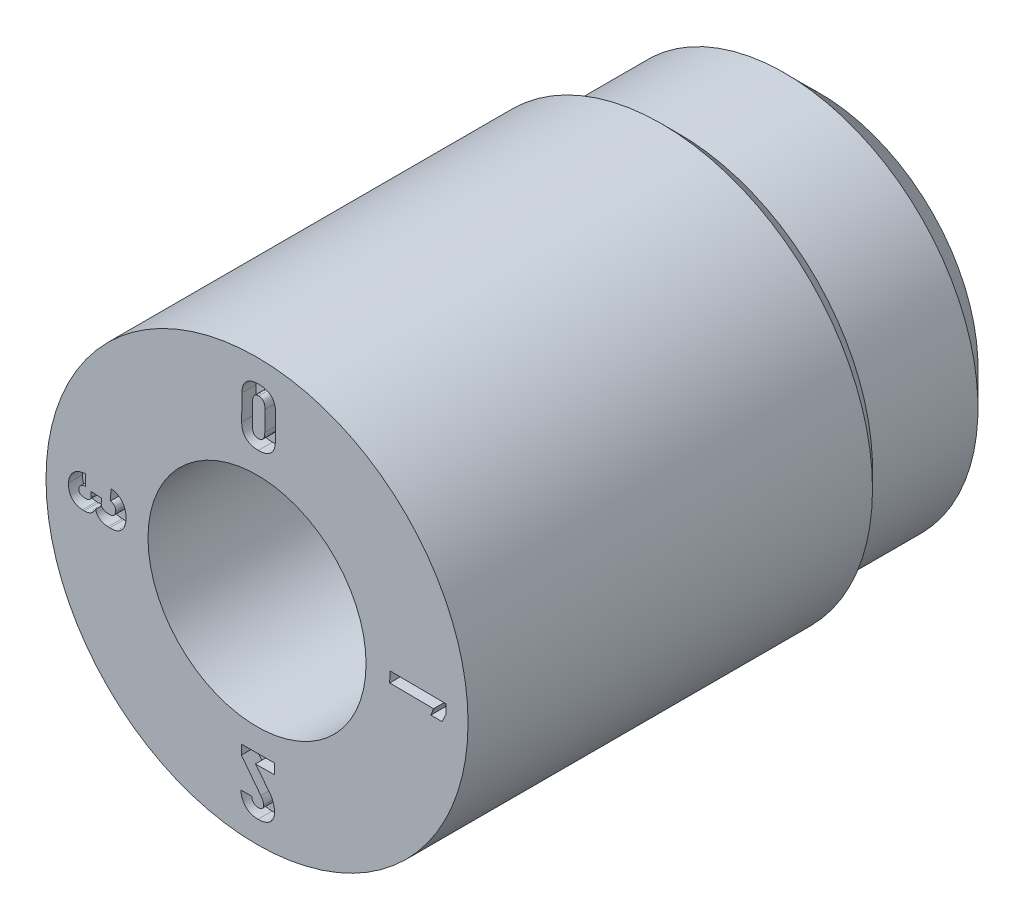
ISO-10303-21;
HEADER;
FILE_DESCRIPTION(('STEP AP214'),'2;1');
FILE_NAME('part.step','',(''),(''),'','','');
FILE_SCHEMA(('AUTOMOTIVE_DESIGN { 1 0 10303 214 1 1 1 1 }'));
ENDSEC;
DATA;
#1=APPLICATION_CONTEXT('core data for automotive mechanical design processes');
#2=APPLICATION_PROTOCOL_DEFINITION('international standard','automotive_design',2000,#1);
#3=PRODUCT_CONTEXT('',#1,'mechanical');
#4=PRODUCT('Part','Part','',(#3));
#5=PRODUCT_RELATED_PRODUCT_CATEGORY('part','',(#4));
#6=PRODUCT_DEFINITION_FORMATION('','',#4);
#7=PRODUCT_DEFINITION_CONTEXT('part definition',#1,'design');
#8=PRODUCT_DEFINITION('design','',#6,#7);
#9=PRODUCT_DEFINITION_SHAPE('','',#8);
#10=(LENGTH_UNIT() NAMED_UNIT(*) SI_UNIT(.MILLI.,.METRE.));
#11=(NAMED_UNIT(*) PLANE_ANGLE_UNIT() SI_UNIT($,.RADIAN.));
#12=(NAMED_UNIT(*) SI_UNIT($,.STERADIAN.) SOLID_ANGLE_UNIT());
#13=UNCERTAINTY_MEASURE_WITH_UNIT(LENGTH_MEASURE(1.E-05),#10,'distance_accuracy_value','');
#14=(GEOMETRIC_REPRESENTATION_CONTEXT(3) GLOBAL_UNCERTAINTY_ASSIGNED_CONTEXT((#13)) GLOBAL_UNIT_ASSIGNED_CONTEXT((#10,
#11,#12)) REPRESENTATION_CONTEXT('',''));
#15=CARTESIAN_POINT('',(0.,0.,0.));
#16=DIRECTION('',(0.,0.,1.));
#17=DIRECTION('',(1.,0.,0.));
#18=AXIS2_PLACEMENT_3D('',#15,#16,#17);
#19=CARTESIAN_POINT('',(1.55,0.,0.));
#20=DIRECTION('',(0.,0.,-1.));
#21=DIRECTION('',(-1.,0.,0.));
#22=AXIS2_PLACEMENT_3D('',#19,#20,#21);
#23=PLANE('',#22);
#24=CARTESIAN_POINT('',(-1.86306948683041,0.0779038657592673,0.));
#25=CARTESIAN_POINT('',(-1.86290219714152,0.0896935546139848,0.));
#26=CARTESIAN_POINT('',(-1.86257557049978,0.112712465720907,0.));
#27=CARTESIAN_POINT('',(-1.86605302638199,0.146495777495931,0.));
#28=CARTESIAN_POINT('',(-1.87309907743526,0.178389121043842,0.));
#29=CARTESIAN_POINT('',(-1.88335166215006,0.208349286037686,0.));
#30=CARTESIAN_POINT('',(-1.89698022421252,0.235959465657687,0.));
#31=CARTESIAN_POINT('',(-1.91384556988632,0.260917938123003,0.));
#32=CARTESIAN_POINT('',(-1.93389820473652,0.283157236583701,0.));
#33=CARTESIAN_POINT('',(-1.95707850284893,0.302351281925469,0.));
#34=CARTESIAN_POINT('',(-1.98306844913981,0.318602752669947,0.));
#35=CARTESIAN_POINT('',(-2.01192379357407,0.330861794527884,0.));
#36=CARTESIAN_POINT('',(-2.04328233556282,0.339629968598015,0.));
#37=CARTESIAN_POINT('',(-2.06520075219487,0.342354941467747,0.));
#38=CARTESIAN_POINT('',(-2.07645620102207,0.343754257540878,0.));
#39=B_SPLINE_CURVE_WITH_KNOTS('',3,(#24,#25,#26,#27,#28,#29,#30,#31,#32,#33,#34,#35,#36,#37,
#38),.UNSPECIFIED.,.F.,.F.,(4,1,1,1,1,1,1,1,1,1,1,1,4),(0.,0.0927742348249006,0.181138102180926,
0.266669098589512,0.34942732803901,0.429848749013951,0.508362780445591,0.585851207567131,
0.664787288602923,0.744581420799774,0.826303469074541,0.91080412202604,1.),.UNSPECIFIED.);
#40=CARTESIAN_POINT('',(-1.86306948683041,0.0779038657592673,0.));
#41=VERTEX_POINT('',#40);
#42=CARTESIAN_POINT('',(-2.07645620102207,0.343754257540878,0.));
#43=VERTEX_POINT('',#42);
#44=EDGE_CURVE('E1547',#41,#43,#39,.T.);
#45=ORIENTED_EDGE('',*,*,#44,.F.);
#46=CARTESIAN_POINT('',(-2.09360923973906,-0.147708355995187,0.));
#47=CARTESIAN_POINT('',(-2.08235833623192,-0.147852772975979,0.));
#48=CARTESIAN_POINT('',(-2.06055880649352,-0.148132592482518,0.));
#49=CARTESIAN_POINT('',(-2.02894944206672,-0.144327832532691,0.));
#50=CARTESIAN_POINT('',(-1.99976190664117,-0.136930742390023,0.));
#51=CARTESIAN_POINT('',(-1.97310581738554,-0.125916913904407,0.));
#52=CARTESIAN_POINT('',(-1.94886190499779,-0.111694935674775,0.));
#53=CARTESIAN_POINT('',(-1.92764667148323,-0.0936452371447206,0.));
#54=CARTESIAN_POINT('',(-1.90895413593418,-0.0725916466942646,0.));
#55=CARTESIAN_POINT('',(-1.89361037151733,-0.048012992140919,0.));
#56=CARTESIAN_POINT('',(-1.88099368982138,-0.0206461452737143,0.));
#57=CARTESIAN_POINT('',(-1.87175573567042,0.00973306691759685,0.));
#58=CARTESIAN_POINT('',(-1.86534324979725,0.0428311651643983,0.));
#59=CARTESIAN_POINT('',(-1.86384362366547,0.0659628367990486,0.));
#60=CARTESIAN_POINT('',(-1.86306948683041,0.0779038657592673,0.));
#61=B_SPLINE_CURVE_WITH_KNOTS('',3,(#46,#47,#48,#49,#50,#51,#52,#53,#54,#55,#56,#57,#58,#59,
#60),.UNSPECIFIED.,.F.,.F.,(4,1,1,1,1,1,1,1,1,1,1,1,4),(0.,0.0919899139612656,0.178237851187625,
0.259660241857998,0.337617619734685,0.413500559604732,0.488649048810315,0.564598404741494,
0.642965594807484,0.724834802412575,0.810492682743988,0.902172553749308,1.),.UNSPECIFIED.);
#62=CARTESIAN_POINT('',(-2.09360923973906,-0.147708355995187,0.));
#63=VERTEX_POINT('',#62);
#64=EDGE_CURVE('E49',#63,#41,#61,.T.);
#65=ORIENTED_EDGE('',*,*,#64,.F.);
#66=DIRECTION('',(0.999140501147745,-0.0414518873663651,0.));
#67=VECTOR('',#66,1.);
#68=CARTESIAN_POINT('',(-2.11773709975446,-0.146707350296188,0.));
#69=LINE('',#68,#67);
#70=CARTESIAN_POINT('',(-2.11773709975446,-0.146707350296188,0.));
#71=VERTEX_POINT('',#70);
#72=EDGE_CURVE('E414',#71,#63,#69,.T.);
#73=ORIENTED_EDGE('',*,*,#72,.F.);
#74=CARTESIAN_POINT('',(-2.29382680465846,-0.0182221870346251,0.));
#75=CARTESIAN_POINT('',(-2.29281983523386,-0.0229646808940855,0.));
#76=CARTESIAN_POINT('',(-2.29083577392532,-0.0323089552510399,0.));
#77=CARTESIAN_POINT('',(-2.28657376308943,-0.0458059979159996,0.));
#78=CARTESIAN_POINT('',(-2.28093114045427,-0.0584504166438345,0.));
#79=CARTESIAN_POINT('',(-2.27446391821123,-0.0704346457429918,0.));
#80=CARTESIAN_POINT('',(-2.26684724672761,-0.081658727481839,0.));
#81=CARTESIAN_POINT('',(-2.25786763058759,-0.0918610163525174,0.));
#82=CARTESIAN_POINT('',(-2.24809851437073,-0.101550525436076,0.));
#83=CARTESIAN_POINT('',(-2.23713526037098,-0.110334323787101,0.));
#84=CARTESIAN_POINT('',(-2.22510475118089,-0.118106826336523,0.));
#85=CARTESIAN_POINT('',(-2.21239722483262,-0.125318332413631,0.));
#86=CARTESIAN_POINT('',(-2.19854578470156,-0.131099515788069,0.));
#87=CARTESIAN_POINT('',(-2.18408857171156,-0.136277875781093,0.));
#88=CARTESIAN_POINT('',(-2.16863133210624,-0.140221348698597,0.));
#89=CARTESIAN_POINT('',(-2.15249616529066,-0.143652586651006,0.));
#90=CARTESIAN_POINT('',(-2.13536482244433,-0.145558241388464,0.));
#91=CARTESIAN_POINT('',(-2.12370208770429,-0.146318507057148,0.));
#92=CARTESIAN_POINT('',(-2.11773709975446,-0.146707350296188,0.));
#93=B_SPLINE_CURVE_WITH_KNOTS('',3,(#74,#75,#76,#77,#78,#79,#80,#81,#82,#83,#84,#85,#86,#87,#88,
#89,#90,#91,#92),.UNSPECIFIED.,.F.,.F.,(4,1,1,1,1,1,1,1,1,1,1,1,1,1,1,1,4),(0.,
0.061261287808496,0.120704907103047,0.178486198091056,0.236021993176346,0.292665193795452,
0.349495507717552,0.407541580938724,0.46641092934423,0.526658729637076,0.588452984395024,
0.65079457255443,0.716104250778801,0.782396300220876,0.852261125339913,0.924437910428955,1.),.UNSPECIFIED.);
#94=CARTESIAN_POINT('',(-2.29382680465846,-0.0182221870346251,0.));
#95=VERTEX_POINT('',#94);
#96=EDGE_CURVE('E417',#95,#71,#93,.T.);
#97=ORIENTED_EDGE('',*,*,#96,.F.);
#98=CARTESIAN_POINT('',(-2.4567205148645,-0.119345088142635,0.));
#99=CARTESIAN_POINT('',(-2.44769293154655,-0.11942860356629,0.));
#100=CARTESIAN_POINT('',(-2.43013822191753,-0.119591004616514,0.));
#101=CARTESIAN_POINT('',(-2.40449916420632,-0.115313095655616,0.));
#102=CARTESIAN_POINT('',(-2.38055263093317,-0.107413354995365,0.));
#103=CARTESIAN_POINT('',(-2.35838797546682,-0.0958695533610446,0.));
#104=CARTESIAN_POINT('',(-2.33825642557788,-0.0811188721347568,0.));
#105=CARTESIAN_POINT('',(-2.32056053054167,-0.0631407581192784,0.));
#106=CARTESIAN_POINT('',(-2.30538211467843,-0.0420930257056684,0.));
#107=CARTESIAN_POINT('',(-2.29773776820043,-0.0263014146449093,0.));
#108=CARTESIAN_POINT('',(-2.29382680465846,-0.0182221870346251,0.));
#109=B_SPLINE_CURVE_WITH_KNOTS('',3,(#98,#99,#100,#101,#102,#103,#104,#105,#106,#107,#108),
.UNSPECIFIED.,.F.,.F.,(4,1,1,1,1,1,1,1,4),(0.,0.132118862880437,0.256913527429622,
0.378965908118,0.500291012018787,0.621676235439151,0.743239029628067,0.868637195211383,1.),.UNSPECIFIED.);
#110=CARTESIAN_POINT('',(-2.4567205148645,-0.119345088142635,0.));
#111=VERTEX_POINT('',#110);
#112=EDGE_CURVE('E1645',#111,#95,#109,.T.);
#113=ORIENTED_EDGE('',*,*,#112,.F.);
#114=DIRECTION('',(0.999140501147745,-0.0414518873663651,0.));
#115=VECTOR('',#114,1.);
#116=CARTESIAN_POINT('',(-2.4808483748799,-0.118344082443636,0.));
#117=LINE('',#116,#115);
#118=CARTESIAN_POINT('',(-2.4808483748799,-0.118344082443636,0.));
#119=VERTEX_POINT('',#118);
#120=EDGE_CURVE('E1639',#119,#111,#117,.T.);
#121=ORIENTED_EDGE('',*,*,#120,.F.);
#122=CARTESIAN_POINT('',(-2.67961282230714,0.112443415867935,0.));
#123=CARTESIAN_POINT('',(-2.67977574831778,0.103832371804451,0.));
#124=CARTESIAN_POINT('',(-2.68009237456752,0.0870978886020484,0.));
#125=CARTESIAN_POINT('',(-2.67873662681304,0.0626137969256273,0.));
#126=CARTESIAN_POINT('',(-2.67532751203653,0.0396123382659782,0.));
#127=CARTESIAN_POINT('',(-2.6705307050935,0.0179400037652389,0.));
#128=CARTESIAN_POINT('',(-2.66358402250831,-0.00221752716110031,0.));
#129=CARTESIAN_POINT('',(-2.65497663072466,-0.0209455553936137,0.));
#130=CARTESIAN_POINT('',(-2.64477496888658,-0.0383706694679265,0.));
#131=CARTESIAN_POINT('',(-2.63254547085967,-0.0540890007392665,0.));
#132=CARTESIAN_POINT('',(-2.6188179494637,-0.0683496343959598,0.));
#133=CARTESIAN_POINT('',(-2.60359008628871,-0.0809669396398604,0.));
#134=CARTESIAN_POINT('',(-2.58680631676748,-0.0917704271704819,0.));
#135=CARTESIAN_POINT('',(-2.56842957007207,-0.100583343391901,0.));
#136=CARTESIAN_POINT('',(-2.54863315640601,-0.107773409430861,0.));
#137=CARTESIAN_POINT('',(-2.52740277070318,-0.11326746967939,0.));
#138=CARTESIAN_POINT('',(-2.50464844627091,-0.116976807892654,0.));
#139=CARTESIAN_POINT('',(-2.48893683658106,-0.11787941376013,0.));
#140=CARTESIAN_POINT('',(-2.4808483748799,-0.118344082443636,0.));
#141=B_SPLINE_CURVE_WITH_KNOTS('',3,(#122,#123,#124,#125,#126,#127,#128,#129,#130,#131,#132,
#133,#134,#135,#136,#137,#138,#139,#140),.UNSPECIFIED.,.F.,.F.,(4,1,1,1,1,1,1,1,1,1,1,1,1,1,1,1,
4),(0.,0.0745334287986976,0.144846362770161,0.211938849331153,0.275608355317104,
0.336693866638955,0.396088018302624,0.453775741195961,0.511045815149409,0.568038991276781,
0.624800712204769,0.681826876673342,0.740352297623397,0.800831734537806,0.863856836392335,
0.929912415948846,1.),.UNSPECIFIED.);
#142=CARTESIAN_POINT('',(-2.67961282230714,0.112443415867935,0.));
#143=VERTEX_POINT('',#142);
#144=EDGE_CURVE('E1631',#143,#119,#141,.T.);
#145=ORIENTED_EDGE('',*,*,#144,.F.);
#146=CARTESIAN_POINT('',(-2.43456761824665,0.345370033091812,0.));
#147=CARTESIAN_POINT('',(-2.44647743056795,0.344502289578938,0.));
#148=CARTESIAN_POINT('',(-2.46964969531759,0.342813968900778,0.));
#149=CARTESIAN_POINT('',(-2.50297358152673,0.335627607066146,0.));
#150=CARTESIAN_POINT('',(-2.53406281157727,0.325711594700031,0.));
#151=CARTESIAN_POINT('',(-2.56254143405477,0.312079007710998,0.));
#152=CARTESIAN_POINT('',(-2.58839757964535,0.295617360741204,0.));
#153=CARTESIAN_POINT('',(-2.61116328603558,0.276107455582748,0.));
#154=CARTESIAN_POINT('',(-2.6309410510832,0.254042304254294,0.));
#155=CARTESIAN_POINT('',(-2.64757335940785,0.229423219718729,0.));
#156=CARTESIAN_POINT('',(-2.66088103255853,0.202667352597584,0.));
#157=CARTESIAN_POINT('',(-2.67078949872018,0.174078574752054,0.));
#158=CARTESIAN_POINT('',(-2.67728393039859,0.143828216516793,0.));
#159=CARTESIAN_POINT('',(-2.67882781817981,0.123022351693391,0.));
#160=CARTESIAN_POINT('',(-2.67961282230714,0.112443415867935,0.));
#161=B_SPLINE_CURVE_WITH_KNOTS('',3,(#146,#147,#148,#149,#150,#151,#152,#153,#154,#155,#156,
#157,#158,#159,#160),.UNSPECIFIED.,.F.,.F.,(4,1,1,1,1,1,1,1,1,1,1,1,4),(0.,0.0954107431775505,
0.185635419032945,0.271938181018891,0.355888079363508,0.437439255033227,0.516434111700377,
0.594939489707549,0.673766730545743,0.753356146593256,0.833272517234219,0.915225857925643,1.),.UNSPECIFIED.);
#162=CARTESIAN_POINT('',(-2.43456761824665,0.345370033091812,0.));
#163=VERTEX_POINT('',#162);
#164=EDGE_CURVE('E1626',#163,#143,#161,.T.);
#165=ORIENTED_EDGE('',*,*,#164,.F.);
#166=DIRECTION('',(0.0420749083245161,0.999114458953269,0.));
#167=VECTOR('',#166,1.);
#168=CARTESIAN_POINT('',(-2.44110313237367,0.190177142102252,0.));
#169=LINE('',#168,#167);
#170=CARTESIAN_POINT('',(-2.44110313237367,0.190177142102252,0.));
#171=VERTEX_POINT('',#170);
#172=EDGE_CURVE('E1620',#171,#163,#169,.T.);
#173=ORIENTED_EDGE('',*,*,#172,.F.);
#174=CARTESIAN_POINT('',(-2.53307850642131,0.112017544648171,0.));
#175=CARTESIAN_POINT('',(-2.53277482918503,0.115322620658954,0.));
#176=CARTESIAN_POINT('',(-2.53217419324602,0.121859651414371,0.));
#177=CARTESIAN_POINT('',(-2.52994058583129,0.13145607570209,0.));
#178=CARTESIAN_POINT('',(-2.52620063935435,0.140498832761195,0.));
#179=CARTESIAN_POINT('',(-2.52121067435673,0.149012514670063,0.));
#180=CARTESIAN_POINT('',(-2.51496947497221,0.156835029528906,0.));
#181=CARTESIAN_POINT('',(-2.50762391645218,0.163988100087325,0.));
#182=CARTESIAN_POINT('',(-2.49911544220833,0.17031812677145,0.));
#183=CARTESIAN_POINT('',(-2.48965268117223,0.176200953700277,0.));
#184=CARTESIAN_POINT('',(-2.47887721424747,0.180880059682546,0.));
#185=CARTESIAN_POINT('',(-2.4672396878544,0.185132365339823,0.));
#186=CARTESIAN_POINT('',(-2.45448387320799,0.188059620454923,0.));
#187=CARTESIAN_POINT('',(-2.44564639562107,0.189458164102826,0.));
#188=CARTESIAN_POINT('',(-2.44110313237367,0.190177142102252,0.));
#189=B_SPLINE_CURVE_WITH_KNOTS('',3,(#174,#175,#176,#177,#178,#179,#180,#181,#182,#183,#184,
#185,#186,#187,#188),.UNSPECIFIED.,.F.,.F.,(4,1,1,1,1,1,1,1,1,1,1,1,4),(0.,0.0754511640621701,
0.149233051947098,0.223128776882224,0.297220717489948,0.372995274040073,0.450099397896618,
0.529767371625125,0.613840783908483,0.702935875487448,0.79644989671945,0.895356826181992,1.),.UNSPECIFIED.);
#190=CARTESIAN_POINT('',(-2.53307850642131,0.112017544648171,0.));
#191=VERTEX_POINT('',#190);
#192=EDGE_CURVE('E1612',#191,#171,#189,.T.);
#193=ORIENTED_EDGE('',*,*,#192,.F.);
#194=CARTESIAN_POINT('',(-2.4587768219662,0.0427698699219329,0.));
#195=CARTESIAN_POINT('',(-2.46458880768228,0.0431700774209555,0.));
#196=CARTESIAN_POINT('',(-2.47557918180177,0.0439268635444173,0.));
#197=CARTESIAN_POINT('',(-2.49096824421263,0.0478528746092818,0.));
#198=CARTESIAN_POINT('',(-2.50427233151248,0.0537589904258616,0.));
#199=CARTESIAN_POINT('',(-2.51532281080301,0.0619545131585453,0.));
#200=CARTESIAN_POINT('',(-2.52378453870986,0.0721241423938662,0.));
#201=CARTESIAN_POINT('',(-2.52974109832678,0.0840106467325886,0.));
#202=CARTESIAN_POINT('',(-2.533126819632,0.097530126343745,0.));
#203=CARTESIAN_POINT('',(-2.53309498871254,0.10707509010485,0.));
#204=CARTESIAN_POINT('',(-2.53307850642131,0.112017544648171,0.));
#205=B_SPLINE_CURVE_WITH_KNOTS('',3,(#194,#195,#196,#197,#198,#199,#200,#201,#202,#203,#204),
.UNSPECIFIED.,.F.,.F.,(4,1,1,1,1,1,1,1,4),(0.,0.151399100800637,0.286293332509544,
0.411147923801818,0.528115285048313,0.641158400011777,0.752281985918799,0.871729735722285,1.),.UNSPECIFIED.);
#206=CARTESIAN_POINT('',(-2.4587768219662,0.0427698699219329,0.));
#207=VERTEX_POINT('',#206);
#208=EDGE_CURVE('E1607',#207,#191,#205,.T.);
#209=ORIENTED_EDGE('',*,*,#208,.F.);
#210=DIRECTION('',(-0.998909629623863,0.0466856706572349,0.));
#211=VECTOR('',#210,1.);
#212=CARTESIAN_POINT('',(-2.44492555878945,0.0421225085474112,0.));
#213=LINE('',#212,#211);
#214=CARTESIAN_POINT('',(-2.44492555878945,0.0421225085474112,0.));
#215=VERTEX_POINT('',#214);
#216=EDGE_CURVE('E1601',#215,#207,#213,.T.);
#217=ORIENTED_EDGE('',*,*,#216,.F.);
#218=CARTESIAN_POINT('',(-2.35996540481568,0.098611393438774,0.));
#219=CARTESIAN_POINT('',(-2.36039294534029,0.0940965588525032,0.));
#220=CARTESIAN_POINT('',(-2.3612174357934,0.0853899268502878,0.));
#221=CARTESIAN_POINT('',(-2.36593587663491,0.0732254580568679,0.));
#222=CARTESIAN_POINT('',(-2.37352073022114,0.0629826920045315,0.));
#223=CARTESIAN_POINT('',(-2.38365328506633,0.0546957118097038,0.));
#224=CARTESIAN_POINT('',(-2.39596980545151,0.0482790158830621,0.));
#225=CARTESIAN_POINT('',(-2.41051261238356,0.0441794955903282,0.));
#226=CARTESIAN_POINT('',(-2.42705542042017,0.0419338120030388,0.));
#227=CARTESIAN_POINT('',(-2.43874907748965,0.0420572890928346,0.));
#228=CARTESIAN_POINT('',(-2.44492555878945,0.0421225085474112,0.));
#229=B_SPLINE_CURVE_WITH_KNOTS('',3,(#218,#219,#220,#221,#222,#223,#224,#225,#226,#227,#228),
.UNSPECIFIED.,.F.,.F.,(4,1,1,1,1,1,1,1,4),(0.,0.11788456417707,0.227334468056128,
0.335537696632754,0.446817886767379,0.56599121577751,0.695261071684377,0.839039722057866,1.),.UNSPECIFIED.);
#230=CARTESIAN_POINT('',(-2.35996540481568,0.098611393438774,0.));
#231=VERTEX_POINT('',#230);
#232=EDGE_CURVE('E1596',#231,#215,#229,.T.);
#233=ORIENTED_EDGE('',*,*,#232,.F.);
#234=DIRECTION('',(-0.0410296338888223,-0.999157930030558,0.));
#235=VECTOR('',#234,1.);
#236=CARTESIAN_POINT('',(-2.35718707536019,0.166269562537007,0.));
#237=LINE('',#236,#235);
#238=CARTESIAN_POINT('',(-2.35718707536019,0.166269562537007,0.));
#239=VERTEX_POINT('',#238);
#240=EDGE_CURVE('E1593',#239,#231,#237,.T.);
#241=ORIENTED_EDGE('',*,*,#240,.F.);
#242=DIRECTION('',(-0.999134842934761,0.0415880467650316,0.));
#243=VECTOR('',#242,1.);
#244=CARTESIAN_POINT('',(-2.21193246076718,0.160223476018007,0.));
#245=LINE('',#244,#243);
#246=CARTESIAN_POINT('',(-2.21193246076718,0.160223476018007,0.));
#247=VERTEX_POINT('',#246);
#248=EDGE_CURVE('E1590',#247,#239,#245,.T.);
#249=ORIENTED_EDGE('',*,*,#248,.F.);
#250=DIRECTION('',(0.0410296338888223,0.999157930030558,0.));
#251=VECTOR('',#250,1.);
#252=CARTESIAN_POINT('',(-2.21471079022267,0.0925653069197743,0.));
#253=LINE('',#252,#251);
#254=CARTESIAN_POINT('',(-2.21471079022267,0.0925653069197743,0.));
#255=VERTEX_POINT('',#254);
#256=EDGE_CURVE('E1584',#255,#247,#253,.T.);
#257=ORIENTED_EDGE('',*,*,#256,.F.);
#258=CARTESIAN_POINT('',(-2.1225689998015,0.0154720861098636,0.));
#259=CARTESIAN_POINT('',(-2.12973489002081,0.0159736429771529,0.));
#260=CARTESIAN_POINT('',(-2.14331832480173,0.0169243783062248,0.));
#261=CARTESIAN_POINT('',(-2.16231281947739,0.0212689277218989,0.));
#262=CARTESIAN_POINT('',(-2.17878844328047,0.0276914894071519,0.));
#263=CARTESIAN_POINT('',(-2.19237889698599,0.0367513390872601,0.));
#264=CARTESIAN_POINT('',(-2.20302813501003,0.0478602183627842,0.));
#265=CARTESIAN_POINT('',(-2.21047094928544,0.0611008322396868,0.));
#266=CARTESIAN_POINT('',(-2.21449683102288,0.0763004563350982,0.));
#267=CARTESIAN_POINT('',(-2.21463770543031,0.0870095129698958,0.));
#268=CARTESIAN_POINT('',(-2.21471079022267,0.0925653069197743,0.));
#269=B_SPLINE_CURVE_WITH_KNOTS('',3,(#258,#259,#260,#261,#262,#263,#264,#265,#266,#267,#268),
.UNSPECIFIED.,.F.,.F.,(4,1,1,1,1,1,1,1,4),(0.,0.158244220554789,0.299962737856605,
0.428104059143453,0.546160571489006,0.657354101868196,0.764406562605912,0.87777554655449,1.),.UNSPECIFIED.);
#270=CARTESIAN_POINT('',(-2.1225689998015,0.0154720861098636,0.));
#271=VERTEX_POINT('',#270);
#272=EDGE_CURVE('E1579',#271,#255,#269,.T.);
#273=ORIENTED_EDGE('',*,*,#272,.F.);
#274=DIRECTION('',(-0.99888564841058,0.0471959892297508,0.));
#275=VECTOR('',#274,1.);
#276=CARTESIAN_POINT('',(-2.10382984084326,0.0145866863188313,0.));
#277=LINE('',#276,#275);
#278=CARTESIAN_POINT('',(-2.10382984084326,0.0145866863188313,0.));
#279=VERTEX_POINT('',#278);
#280=EDGE_CURVE('E1573',#279,#271,#277,.T.);
#281=ORIENTED_EDGE('',*,*,#280,.F.);
#282=CARTESIAN_POINT('',(-2.00876300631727,0.100507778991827,0.));
#283=CARTESIAN_POINT('',(-2.00927577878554,0.0937684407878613,0.));
#284=CARTESIAN_POINT('',(-2.01025792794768,0.0808601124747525,0.));
#285=CARTESIAN_POINT('',(-2.01571381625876,0.0629594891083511,0.));
#286=CARTESIAN_POINT('',(-2.0239529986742,0.0475324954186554,0.));
#287=CARTESIAN_POINT('',(-2.03511717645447,0.0348359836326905,0.));
#288=CARTESIAN_POINT('',(-2.04897608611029,0.02495457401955,0.));
#289=CARTESIAN_POINT('',(-2.06531024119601,0.0182443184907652,0.));
#290=CARTESIAN_POINT('',(-2.08388952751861,0.0144516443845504,0.));
#291=CARTESIAN_POINT('',(-2.09697934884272,0.0145402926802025,0.));
#292=CARTESIAN_POINT('',(-2.10382984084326,0.0145866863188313,0.));
#293=B_SPLINE_CURVE_WITH_KNOTS('',3,(#282,#283,#284,#285,#286,#287,#288,#289,#290,#291,#292),
.UNSPECIFIED.,.F.,.F.,(4,1,1,1,1,1,1,1,4),(0.,0.139051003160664,0.266334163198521,
0.382751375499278,0.497297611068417,0.611816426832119,0.730626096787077,0.859024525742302,1.),.UNSPECIFIED.);
#294=CARTESIAN_POINT('',(-2.00876300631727,0.100507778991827,0.));
#295=VERTEX_POINT('',#294);
#296=EDGE_CURVE('E1565',#295,#279,#293,.T.);
#297=ORIENTED_EDGE('',*,*,#296,.F.);
#298=CARTESIAN_POINT('',(-2.08286928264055,0.188060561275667,0.));
#299=CARTESIAN_POINT('',(-2.07888971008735,0.18721558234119,0.));
#300=CARTESIAN_POINT('',(-2.07118165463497,0.185578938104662,0.));
#301=CARTESIAN_POINT('',(-2.06029308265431,0.181882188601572,0.));
#302=CARTESIAN_POINT('',(-2.0504183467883,0.177279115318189,0.));
#303=CARTESIAN_POINT('',(-2.04147664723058,0.171844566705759,0.));
#304=CARTESIAN_POINT('',(-2.03363703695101,0.165361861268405,0.));
#305=CARTESIAN_POINT('',(-2.0266257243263,0.158321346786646,0.));
#306=CARTESIAN_POINT('',(-2.02084532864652,0.150355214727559,0.));
#307=CARTESIAN_POINT('',(-2.01612709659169,0.141719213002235,0.));
#308=CARTESIAN_POINT('',(-2.01240734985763,0.132372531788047,0.));
#309=CARTESIAN_POINT('',(-2.01007783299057,0.122292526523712,0.));
#310=CARTESIAN_POINT('',(-2.00848803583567,0.111613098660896,0.));
#311=CARTESIAN_POINT('',(-2.00866966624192,0.104277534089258,0.));
#312=CARTESIAN_POINT('',(-2.00876300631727,0.100507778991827,0.));
#313=B_SPLINE_CURVE_WITH_KNOTS('',3,(#298,#299,#300,#301,#302,#303,#304,#305,#306,#307,#308,
#309,#310,#311,#312),.UNSPECIFIED.,.F.,.F.,(4,1,1,1,1,1,1,1,1,1,1,1,4),(0.,0.096340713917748,
0.186602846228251,0.271760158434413,0.354115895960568,0.433769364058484,0.512269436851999,
0.58895287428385,0.666099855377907,0.745000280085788,0.826444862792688,0.910809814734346,1.),.UNSPECIFIED.);
#314=CARTESIAN_POINT('',(-2.08286928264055,0.188060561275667,0.));
#315=VERTEX_POINT('',#314);
#316=EDGE_CURVE('E1560',#315,#295,#313,.T.);
#317=ORIENTED_EDGE('',*,*,#316,.F.);
#318=DIRECTION('',(-0.0411554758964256,-0.999152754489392,0.));
#319=VECTOR('',#318,1.);
#320=CARTESIAN_POINT('',(-2.07645620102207,0.343754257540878,0.));
#321=LINE('',#320,#319);
#322=EDGE_CURVE('E1554',#43,#315,#321,.T.);
#323=ORIENTED_EDGE('',*,*,#322,.F.);
#324=EDGE_LOOP('',(#45,#65,#73,#97,#113,#121,#145,#165,#173,#193,#209,#217,#233,#241,#249,#257,
#273,#281,#297,#317,#323));
#325=FACE_BOUND('',#324,.T.);
#326=DIRECTION('',(0.609428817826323,-0.792840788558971,0.));
#327=VECTOR('',#326,1.);
#328=CARTESIAN_POINT('',(-0.222498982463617,-2.01059884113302,0.));
#329=LINE('',#328,#327);
#330=CARTESIAN_POINT('',(-0.222498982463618,-2.01059884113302,0.));
#331=VERTEX_POINT('',#330);
#332=CARTESIAN_POINT('',(0.0538728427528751,-2.37014674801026,0.));
#333=VERTEX_POINT('',#332);
#334=EDGE_CURVE('E490',#331,#333,#329,.T.);
#335=ORIENTED_EDGE('',*,*,#334,.F.);
#336=DIRECTION('',(0.00507809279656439,-0.999987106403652,0.));
#337=VECTOR('',#336,1.);
#338=CARTESIAN_POINT('',(-0.223189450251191,-1.87463069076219,0.));
#339=LINE('',#338,#337);
#340=CARTESIAN_POINT('',(-0.223189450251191,-1.87463069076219,0.));
#341=VERTEX_POINT('',#340);
#342=EDGE_CURVE('E57',#341,#331,#339,.T.);
#343=ORIENTED_EDGE('',*,*,#342,.F.);
#344=DIRECTION('',(-0.999986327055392,-0.00522931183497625,0.));
#345=VECTOR('',#344,1.);
#346=CARTESIAN_POINT('',(0.249926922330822,-1.8721565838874,0.));
#347=LINE('',#346,#345);
#348=CARTESIAN_POINT('',(0.249926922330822,-1.8721565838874,0.));
#349=VERTEX_POINT('',#348);
#350=EDGE_CURVE('E566',#349,#341,#347,.T.);
#351=ORIENTED_EDGE('',*,*,#350,.F.);
#352=DIRECTION('',(-0.00530820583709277,0.999985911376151,0.));
#353=VECTOR('',#352,1.);
#354=CARTESIAN_POINT('',(0.250698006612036,-2.0174172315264,0.));
#355=LINE('',#354,#353);
#356=CARTESIAN_POINT('',(0.250698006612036,-2.0174172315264,0.));
#357=VERTEX_POINT('',#356);
#358=EDGE_CURVE('E563',#357,#349,#355,.T.);
#359=ORIENTED_EDGE('',*,*,#358,.F.);
#360=DIRECTION('',(0.999983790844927,0.0056936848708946,0.));
#361=VECTOR('',#360,1.);
#362=CARTESIAN_POINT('',(-0.0227041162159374,-2.01897392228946,0.));
#363=LINE('',#362,#361);
#364=CARTESIAN_POINT('',(-0.0227041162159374,-2.01897392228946,0.));
#365=VERTEX_POINT('',#364);
#366=EDGE_CURVE('E560',#365,#357,#363,.T.);
#367=ORIENTED_EDGE('',*,*,#366,.F.);
#368=DIRECTION('',(-0.624890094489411,0.780712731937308,0.));
#369=VECTOR('',#368,1.);
#370=CARTESIAN_POINT('',(0.175580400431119,-2.26670267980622,0.));
#371=LINE('',#370,#369);
#372=CARTESIAN_POINT('',(0.175580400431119,-2.26670267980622,0.));
#373=VERTEX_POINT('',#372);
#374=EDGE_CURVE('E554',#373,#365,#371,.T.);
#375=ORIENTED_EDGE('',*,*,#374,.F.);
#376=CARTESIAN_POINT('',(0.248603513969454,-2.47133469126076,0.));
#377=CARTESIAN_POINT('',(0.24830137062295,-2.46225161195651,0.));
#378=CARTESIAN_POINT('',(0.247696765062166,-2.44407586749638,0.));
#379=CARTESIAN_POINT('',(0.243948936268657,-2.41692614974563,0.));
#380=CARTESIAN_POINT('',(0.237763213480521,-2.38995876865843,0.));
#381=CARTESIAN_POINT('',(0.229414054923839,-2.363264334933,0.));
#382=CARTESIAN_POINT('',(0.218997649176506,-2.33721244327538,0.));
#383=CARTESIAN_POINT('',(0.206501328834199,-2.31229828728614,0.));
#384=CARTESIAN_POINT('',(0.19214977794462,-2.28866436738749,0.));
#385=CARTESIAN_POINT('',(0.181096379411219,-2.27401376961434,0.));
#386=CARTESIAN_POINT('',(0.175580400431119,-2.26670267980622,0.));
#387=B_SPLINE_CURVE_WITH_KNOTS('',3,(#376,#377,#378,#379,#380,#381,#382,#383,#384,#385,#386),
.UNSPECIFIED.,.F.,.F.,(4,1,1,1,1,1,1,1,4),(0.,0.123211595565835,0.246553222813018,
0.371043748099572,0.498134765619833,0.625578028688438,0.751183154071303,0.875832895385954,1.),.UNSPECIFIED.);
#388=CARTESIAN_POINT('',(0.248603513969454,-2.47133469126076,0.));
#389=VERTEX_POINT('',#388);
#390=EDGE_CURVE('E549',#389,#373,#387,.T.);
#391=ORIENTED_EDGE('',*,*,#390,.F.);
#392=DIRECTION('',(-0.00867511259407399,0.99996237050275,0.));
#393=VECTOR('',#392,1.);
#394=CARTESIAN_POINT('',(0.248609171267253,-2.47198679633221,0.));
#395=LINE('',#394,#393);
#396=CARTESIAN_POINT('',(0.248609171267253,-2.47198679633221,0.));
#397=VERTEX_POINT('',#396);
#398=EDGE_CURVE('E543',#397,#389,#395,.T.);
#399=ORIENTED_EDGE('',*,*,#398,.F.);
#400=CARTESIAN_POINT('',(0.0132078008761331,-2.68174010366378,0.));
#401=CARTESIAN_POINT('',(0.0252328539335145,-2.68145985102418,0.));
#402=CARTESIAN_POINT('',(0.0485085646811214,-2.68091739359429,0.));
#403=CARTESIAN_POINT('',(0.081994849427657,-2.67590766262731,0.));
#404=CARTESIAN_POINT('',(0.112831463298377,-2.6683061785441,0.));
#405=CARTESIAN_POINT('',(0.140813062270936,-2.65745642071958,0.));
#406=CARTESIAN_POINT('',(0.16584200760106,-2.64367819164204,0.));
#407=CARTESIAN_POINT('',(0.18790294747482,-2.62706944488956,0.));
#408=CARTESIAN_POINT('',(0.20659023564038,-2.60743390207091,0.));
#409=CARTESIAN_POINT('',(0.222298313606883,-2.5852562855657,0.));
#410=CARTESIAN_POINT('',(0.234365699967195,-2.5602923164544,0.));
#411=CARTESIAN_POINT('',(0.242612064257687,-2.53285477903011,0.));
#412=CARTESIAN_POINT('',(0.247971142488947,-2.50319691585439,0.));
#413=CARTESIAN_POINT('',(0.248391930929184,-2.48261342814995,0.));
#414=CARTESIAN_POINT('',(0.248609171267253,-2.47198679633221,0.));
#415=B_SPLINE_CURVE_WITH_KNOTS('',3,(#400,#401,#402,#403,#404,#405,#406,#407,#408,#409,#410,
#411,#412,#413,#414),.UNSPECIFIED.,.F.,.F.,(4,1,1,1,1,1,1,1,1,1,1,1,4),(0.,0.100677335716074,
0.194871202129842,0.282983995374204,0.366267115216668,0.445510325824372,0.521629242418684,
0.596641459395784,0.671685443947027,0.748441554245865,0.827772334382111,0.911084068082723,1.),.UNSPECIFIED.);
#416=CARTESIAN_POINT('',(0.0132078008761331,-2.68174010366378,0.));
#417=VERTEX_POINT('',#416);
#418=EDGE_CURVE('E535',#417,#397,#415,.T.);
#419=ORIENTED_EDGE('',*,*,#418,.F.);
#420=CARTESIAN_POINT('',(-0.230154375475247,-2.4436956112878,0.));
#421=CARTESIAN_POINT('',(-0.228997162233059,-2.45572902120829,0.));
#422=CARTESIAN_POINT('',(-0.226743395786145,-2.47916506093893,0.));
#423=CARTESIAN_POINT('',(-0.219271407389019,-2.51283592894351,0.));
#424=CARTESIAN_POINT('',(-0.208340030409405,-2.54387606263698,0.));
#425=CARTESIAN_POINT('',(-0.194252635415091,-2.57219074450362,0.));
#426=CARTESIAN_POINT('',(-0.177235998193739,-2.59766251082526,0.));
#427=CARTESIAN_POINT('',(-0.157260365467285,-2.61992025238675,0.));
#428=CARTESIAN_POINT('',(-0.134534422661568,-2.63899124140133,0.));
#429=CARTESIAN_POINT('',(-0.109191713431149,-2.65474845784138,0.));
#430=CARTESIAN_POINT('',(-0.0815802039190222,-2.66719203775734,0.));
#431=CARTESIAN_POINT('',(-0.051710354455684,-2.67559853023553,0.));
#432=CARTESIAN_POINT('',(-0.0199565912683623,-2.68112900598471,0.));
#433=CARTESIAN_POINT('',(0.00198367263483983,-2.68153328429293,0.));
#434=CARTESIAN_POINT('',(0.0132078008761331,-2.68174010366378,0.));
#435=B_SPLINE_CURVE_WITH_KNOTS('',3,(#420,#421,#422,#423,#424,#425,#426,#427,#428,#429,#430,
#431,#432,#433,#434),.UNSPECIFIED.,.F.,.F.,(4,1,1,1,1,1,1,1,1,1,1,1,4),(0.,0.0952663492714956,
0.185538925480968,0.27119101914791,0.354180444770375,0.434291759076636,0.512018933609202,
0.589226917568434,0.667453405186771,0.746651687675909,0.827187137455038,0.911592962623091,1.),.UNSPECIFIED.);
#436=CARTESIAN_POINT('',(-0.230154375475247,-2.4436956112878,0.));
#437=VERTEX_POINT('',#436);
#438=EDGE_CURVE('E530',#437,#417,#435,.T.);
#439=ORIENTED_EDGE('',*,*,#438,.F.);
#440=DIRECTION('',(0.00867511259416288,-0.99996237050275,0.));
#441=VECTOR('',#440,1.);
#442=CARTESIAN_POINT('',(-0.230160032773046,-2.44304350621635,0.));
#443=LINE('',#442,#441);
#444=CARTESIAN_POINT('',(-0.230160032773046,-2.44304350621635,0.));
#445=VERTEX_POINT('',#444);
#446=EDGE_CURVE('E527',#445,#437,#443,.T.);
#447=ORIENTED_EDGE('',*,*,#446,.F.);
#448=DIRECTION('',(-0.999984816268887,-0.00551064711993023,0.));
#449=VECTOR('',#448,1.);
#450=CARTESIAN_POINT('',(-0.0756068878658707,-2.4421918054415,0.));
#451=LINE('',#450,#449);
#452=CARTESIAN_POINT('',(-0.0756068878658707,-2.4421918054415,0.));
#453=VERTEX_POINT('',#452);
#454=EDGE_CURVE('E524',#453,#445,#451,.T.);
#455=ORIENTED_EDGE('',*,*,#454,.F.);
#456=DIRECTION('',(-0.00867511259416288,0.99996237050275,0.));
#457=VECTOR('',#456,1.);
#458=CARTESIAN_POINT('',(-0.0756012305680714,-2.44284391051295,0.));
#459=LINE('',#458,#457);
#460=CARTESIAN_POINT('',(-0.0756012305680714,-2.44284391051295,0.));
#461=VERTEX_POINT('',#460);
#462=EDGE_CURVE('E518',#461,#453,#459,.T.);
#463=ORIENTED_EDGE('',*,*,#462,.F.);
#464=CARTESIAN_POINT('',(0.0135779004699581,-2.53646955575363,0.));
#465=CARTESIAN_POINT('',(0.00762216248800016,-2.53620155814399,0.));
#466=CARTESIAN_POINT('',(-0.00393159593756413,-2.5356816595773,0.));
#467=CARTESIAN_POINT('',(-0.0204067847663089,-2.5312123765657,0.));
#468=CARTESIAN_POINT('',(-0.0350717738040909,-2.52349017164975,0.));
#469=CARTESIAN_POINT('',(-0.0476520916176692,-2.51257653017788,0.));
#470=CARTESIAN_POINT('',(-0.0584217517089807,-2.49897902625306,0.));
#471=CARTESIAN_POINT('',(-0.0663347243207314,-2.48243345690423,0.));
#472=CARTESIAN_POINT('',(-0.0725885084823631,-2.46360082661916,0.));
#473=CARTESIAN_POINT('',(-0.0745623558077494,-2.45000150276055,0.));
#474=CARTESIAN_POINT('',(-0.0756012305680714,-2.44284391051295,0.));
#475=B_SPLINE_CURVE_WITH_KNOTS('',3,(#464,#465,#466,#467,#468,#469,#470,#471,#472,#473,#474),
.UNSPECIFIED.,.F.,.F.,(4,1,1,1,1,1,1,1,4),(0.,0.124322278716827,0.241177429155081,
0.353489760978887,0.467817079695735,0.586859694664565,0.71334229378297,0.849126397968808,1.),.UNSPECIFIED.);
#476=CARTESIAN_POINT('',(0.0135779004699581,-2.53646955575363,0.));
#477=VERTEX_POINT('',#476);
#478=EDGE_CURVE('E510',#477,#461,#475,.T.);
#479=ORIENTED_EDGE('',*,*,#478,.F.);
#480=CARTESIAN_POINT('',(0.093365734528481,-2.46844244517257,0.));
#481=CARTESIAN_POINT('',(0.0931915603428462,-2.47358130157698,0.));
#482=CARTESIAN_POINT('',(0.0928596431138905,-2.48337422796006,0.));
#483=CARTESIAN_POINT('',(0.0889534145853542,-2.49717982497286,0.));
#484=CARTESIAN_POINT('',(0.0824030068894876,-2.50915233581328,0.));
#485=CARTESIAN_POINT('',(0.073158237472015,-2.51919558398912,0.));
#486=CARTESIAN_POINT('',(0.0613728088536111,-2.52707110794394,0.));
#487=CARTESIAN_POINT('',(0.0472643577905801,-2.53245565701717,0.));
#488=CARTESIAN_POINT('',(0.0311185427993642,-2.53592616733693,0.));
#489=CARTESIAN_POINT('',(0.019626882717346,-2.53628216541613,0.));
#490=CARTESIAN_POINT('',(0.0135779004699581,-2.53646955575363,0.));
#491=B_SPLINE_CURVE_WITH_KNOTS('',3,(#480,#481,#482,#483,#484,#485,#486,#487,#488,#489,#490),
.UNSPECIFIED.,.F.,.F.,(4,1,1,1,1,1,1,1,4),(0.,0.129081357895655,0.245985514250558,
0.357488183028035,0.469785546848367,0.586288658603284,0.711048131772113,0.847901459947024,1.),.UNSPECIFIED.);
#492=CARTESIAN_POINT('',(0.093365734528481,-2.46844244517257,0.));
#493=VERTEX_POINT('',#492);
#494=EDGE_CURVE('E505',#493,#477,#491,.T.);
#495=ORIENTED_EDGE('',*,*,#494,.F.);
#496=DIRECTION('',(0.00867511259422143,-0.999962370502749,0.));
#497=VECTOR('',#496,1.);
#498=CARTESIAN_POINT('',(0.0933558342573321,-2.46730126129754,0.));
#499=LINE('',#498,#497);
#500=CARTESIAN_POINT('',(0.0933558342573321,-2.46730126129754,0.));
#501=VERTEX_POINT('',#500);
#502=EDGE_CURVE('E499',#501,#493,#499,.T.);
#503=ORIENTED_EDGE('',*,*,#502,.F.);
#504=CARTESIAN_POINT('',(0.0538728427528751,-2.37014674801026,0.));
#505=CARTESIAN_POINT('',(0.059680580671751,-2.37814850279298,0.));
#506=CARTESIAN_POINT('',(0.0709932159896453,-2.39373476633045,0.));
#507=CARTESIAN_POINT('',(0.0814407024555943,-2.4151042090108,0.));
#508=CARTESIAN_POINT('',(0.087621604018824,-2.43196862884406,0.));
#509=CARTESIAN_POINT('',(0.0907943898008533,-2.44412095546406,0.));
#510=CARTESIAN_POINT('',(0.0930672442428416,-2.45581288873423,0.));
#511=CARTESIAN_POINT('',(0.0932614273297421,-2.46354305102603,0.));
#512=CARTESIAN_POINT('',(0.0933558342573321,-2.46730126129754,0.));
#513=B_SPLINE_CURVE_WITH_KNOTS('',3,(#504,#505,#506,#507,#508,#509,#510,#511,#512),
.UNSPECIFIED.,.F.,.F.,(4,1,1,1,1,1,4),(0.,0.277812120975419,0.541137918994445,0.665920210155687,
0.782756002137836,0.894381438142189,1.),.UNSPECIFIED.);
#514=EDGE_CURVE('E494',#333,#501,#513,.T.);
#515=ORIENTED_EDGE('',*,*,#514,.F.);
#516=EDGE_LOOP('',(#335,#343,#351,#359,#367,#375,#391,#399,#419,#439,#447,#455,#463,#479,#495,
#503,#515));
#517=FACE_BOUND('',#516,.T.);
#518=DIRECTION('',(-0.00899641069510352,-0.999959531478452,0.));
#519=VECTOR('',#518,1.);
#520=CARTESIAN_POINT('',(1.88783650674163,0.0830916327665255,0.));
#521=LINE('',#520,#519);
#522=CARTESIAN_POINT('',(1.88783650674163,0.0830916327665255,0.));
#523=VERTEX_POINT('',#522);
#524=CARTESIAN_POINT('',(1.88648121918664,-0.067549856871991,0.));
#525=VERTEX_POINT('',#524);
#526=EDGE_CURVE('E628',#523,#525,#521,.T.);
#527=ORIENTED_EDGE('',*,*,#526,.F.);
#528=DIRECTION('',(-0.999960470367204,0.00889143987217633,0.));
#529=VECTOR('',#528,1.);
#530=CARTESIAN_POINT('',(2.6878355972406,0.0759782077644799,0.));
#531=LINE('',#530,#529);
#532=CARTESIAN_POINT('',(2.6878355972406,0.0759782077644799,0.));
#533=VERTEX_POINT('',#532);
#534=EDGE_CURVE('E572',#533,#523,#531,.T.);
#535=ORIENTED_EDGE('',*,*,#534,.F.);
#536=DIRECTION('',(0.00878245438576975,0.999961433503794,0.));
#537=VECTOR('',#536,1.);
#538=CARTESIAN_POINT('',(2.68670584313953,-0.0526544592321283,0.));
#539=LINE('',#538,#537);
#540=CARTESIAN_POINT('',(2.68670584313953,-0.0526544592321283,0.));
#541=VERTEX_POINT('',#540);
#542=EDGE_CURVE('E608',#541,#533,#539,.T.);
#543=ORIENTED_EDGE('',*,*,#542,.F.);
#544=DIRECTION('',(0.418999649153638,0.907986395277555,0.));
#545=VECTOR('',#544,1.);
#546=CARTESIAN_POINT('',(2.63177331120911,-0.171695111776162,0.));
#547=LINE('',#546,#545);
#548=CARTESIAN_POINT('',(2.63177331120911,-0.171695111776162,0.));
#549=VERTEX_POINT('',#548);
#550=EDGE_CURVE('E640',#549,#541,#547,.T.);
#551=ORIENTED_EDGE('',*,*,#550,.F.);
#552=DIRECTION('',(0.999963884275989,-0.00849883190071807,0.));
#553=VECTOR('',#552,1.);
#554=CARTESIAN_POINT('',(2.47151153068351,-0.170333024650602,0.));
#555=LINE('',#554,#553);
#556=CARTESIAN_POINT('',(2.47151153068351,-0.170333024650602,0.));
#557=VERTEX_POINT('',#556);
#558=EDGE_CURVE('E637',#557,#549,#555,.T.);
#559=ORIENTED_EDGE('',*,*,#558,.F.);
#560=DIRECTION('',(-0.363511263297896,-0.931589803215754,0.));
#561=VECTOR('',#560,1.);
#562=CARTESIAN_POINT('',(2.50942593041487,-0.0731677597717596,0.));
#563=LINE('',#562,#561);
#564=CARTESIAN_POINT('',(2.50942593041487,-0.0731677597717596,0.));
#565=VERTEX_POINT('',#564);
#566=EDGE_CURVE('E634',#565,#557,#563,.T.);
#567=ORIENTED_EDGE('',*,*,#566,.F.);
#568=DIRECTION('',(0.999959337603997,-0.00901793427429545,0.));
#569=VECTOR('',#568,1.);
#570=CARTESIAN_POINT('',(1.88648121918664,-0.067549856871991,0.));
#571=LINE('',#570,#569);
#572=EDGE_CURVE('E631',#525,#565,#571,.T.);
#573=ORIENTED_EDGE('',*,*,#572,.F.);
#574=EDGE_LOOP('',(#527,#535,#543,#551,#559,#567,#573));
#575=FACE_BOUND('',#574,.T.);
#576=CARTESIAN_POINT('',(0.0189958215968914,1.86184939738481,0.));
#577=CARTESIAN_POINT('',(0.028464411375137,1.86195917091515,0.));
#578=CARTESIAN_POINT('',(0.0469076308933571,1.86217299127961,0.));
#579=CARTESIAN_POINT('',(0.0736743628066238,1.86475995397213,0.));
#580=CARTESIAN_POINT('',(0.098765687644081,1.86909935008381,0.));
#581=CARTESIAN_POINT('',(0.122139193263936,1.87542376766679,0.));
#582=CARTESIAN_POINT('',(0.143715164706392,1.88388200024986,0.));
#583=CARTESIAN_POINT('',(0.163705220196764,1.89388269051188,0.));
#584=CARTESIAN_POINT('',(0.181869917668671,1.90599864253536,0.));
#585=CARTESIAN_POINT('',(0.198133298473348,1.92012921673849,0.));
#586=CARTESIAN_POINT('',(0.212724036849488,1.93578485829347,0.));
#587=CARTESIAN_POINT('',(0.225131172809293,1.953182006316,0.));
#588=CARTESIAN_POINT('',(0.235853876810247,1.97185345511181,0.));
#589=CARTESIAN_POINT('',(0.24482601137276,1.99195859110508,0.));
#590=CARTESIAN_POINT('',(0.251508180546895,2.01370260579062,0.));
#591=CARTESIAN_POINT('',(0.256535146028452,2.03677796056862,0.));
#592=CARTESIAN_POINT('',(0.2596804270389,2.06132913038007,0.));
#593=CARTESIAN_POINT('',(0.260151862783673,2.07817176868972,0.));
#594=CARTESIAN_POINT('',(0.260393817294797,2.08681589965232,0.));
#595=B_SPLINE_CURVE_WITH_KNOTS('',3,(#576,#577,#578,#579,#580,#581,#582,#583,#584,#585,#586,
#587,#588,#589,#590,#591,#592,#593,#594),.UNSPECIFIED.,.F.,.F.,(4,1,1,1,1,1,1,1,1,1,1,1,1,1,1,1,
4),(0.,0.075582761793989,0.147222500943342,0.214451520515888,0.278707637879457,
0.340191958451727,0.399205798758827,0.456865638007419,0.514018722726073,0.570882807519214,
0.627334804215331,0.684233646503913,0.742580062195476,0.802722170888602,0.865526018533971,
0.930984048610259,1.),.UNSPECIFIED.);
#596=CARTESIAN_POINT('',(0.0189958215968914,1.86184939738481,0.));
#597=VERTEX_POINT('',#596);
#598=CARTESIAN_POINT('',(0.260393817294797,2.08681589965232,0.));
#599=VERTEX_POINT('',#598);
#600=EDGE_CURVE('E723',#597,#599,#595,.T.);
#601=ORIENTED_EDGE('',*,*,#600,.F.);
#602=CARTESIAN_POINT('',(-0.21827211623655,2.09142478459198,0.));
#603=CARTESIAN_POINT('',(-0.218146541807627,2.08266236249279,0.));
#604=CARTESIAN_POINT('',(-0.217902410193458,2.06562717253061,0.));
#605=CARTESIAN_POINT('',(-0.215296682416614,2.04079280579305,0.));
#606=CARTESIAN_POINT('',(-0.210706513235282,2.01751756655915,0.));
#607=CARTESIAN_POINT('',(-0.204330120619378,1.99558552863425,0.));
#608=CARTESIAN_POINT('',(-0.195733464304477,1.97522153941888,0.));
#609=CARTESIAN_POINT('',(-0.185297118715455,1.95621911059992,0.));
#610=CARTESIAN_POINT('',(-0.172877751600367,1.93880044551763,0.));
#611=CARTESIAN_POINT('',(-0.15857491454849,1.92294323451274,0.));
#612=CARTESIAN_POINT('',(-0.142537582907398,1.908650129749,0.));
#613=CARTESIAN_POINT('',(-0.12450402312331,1.89641780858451,0.));
#614=CARTESIAN_POINT('',(-0.104868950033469,1.88580369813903,0.));
#615=CARTESIAN_POINT('',(-0.0834055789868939,1.87727020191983,0.));
#616=CARTESIAN_POINT('',(-0.0602485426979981,1.87065802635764,0.));
#617=CARTESIAN_POINT('',(-0.0354166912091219,1.86581067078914,0.));
#618=CARTESIAN_POINT('',(-0.00882454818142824,1.86259379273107,0.));
#619=CARTESIAN_POINT('',(0.00953644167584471,1.86210250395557,0.));
#620=CARTESIAN_POINT('',(0.0189958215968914,1.86184939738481,0.));
#621=B_SPLINE_CURVE_WITH_KNOTS('',3,(#602,#603,#604,#605,#606,#607,#608,#609,#610,#611,#612,
#613,#614,#615,#616,#617,#618,#619,#620),.UNSPECIFIED.,.F.,.F.,(4,1,1,1,1,1,1,1,1,1,1,1,1,1,1,1,
4),(0.,0.0699032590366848,0.135900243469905,0.198928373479,0.258997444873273,0.317821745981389,
0.374944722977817,0.431666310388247,0.488117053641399,0.54503060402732,0.602642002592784,
0.661600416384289,0.722810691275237,0.786555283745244,0.853501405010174,0.924525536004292,1.),.UNSPECIFIED.);
#622=CARTESIAN_POINT('',(-0.21827211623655,2.09142478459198,0.));
#623=VERTEX_POINT('',#622);
#624=EDGE_CURVE('E719',#623,#597,#621,.T.);
#625=ORIENTED_EDGE('',*,*,#624,.F.);
#626=DIRECTION('',(-0.00953687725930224,-0.999954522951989,0.));
#627=VECTOR('',#626,1.);
#628=CARTESIAN_POINT('',(-0.214803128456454,2.45515286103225,0.));
#629=LINE('',#628,#627);
#630=CARTESIAN_POINT('',(-0.214803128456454,2.45515286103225,0.));
#631=VERTEX_POINT('',#630);
#632=EDGE_CURVE('E751',#631,#623,#629,.T.);
#633=ORIENTED_EDGE('',*,*,#632,.F.);
#634=CARTESIAN_POINT('',(0.0265948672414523,2.68011936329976,0.));
#635=CARTESIAN_POINT('',(0.0171273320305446,2.68007749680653,0.));
#636=CARTESIAN_POINT('',(-0.00131605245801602,2.67999593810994,0.));
#637=CARTESIAN_POINT('',(-0.0280836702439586,2.67737588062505,0.));
#638=CARTESIAN_POINT('',(-0.0531448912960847,2.67298892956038,0.));
#639=CARTESIAN_POINT('',(-0.0764886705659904,2.66690338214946,0.));
#640=CARTESIAN_POINT('',(-0.0980293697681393,2.65856777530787,0.));
#641=CARTESIAN_POINT('',(-0.117891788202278,2.64854833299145,0.));
#642=CARTESIAN_POINT('',(-0.136098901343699,2.63663167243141,0.));
#643=CARTESIAN_POINT('',(-0.152369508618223,2.62266158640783,0.));
#644=CARTESIAN_POINT('',(-0.166922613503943,2.60710833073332,0.));
#645=CARTESIAN_POINT('',(-0.179586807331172,2.5899601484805,0.));
#646=CARTESIAN_POINT('',(-0.190220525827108,2.57124325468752,0.));
#647=CARTESIAN_POINT('',(-0.199250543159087,2.55111058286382,0.));
#648=CARTESIAN_POINT('',(-0.205890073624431,2.52923916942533,0.));
#649=CARTESIAN_POINT('',(-0.210945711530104,2.50595316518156,0.));
#650=CARTESIAN_POINT('',(-0.214083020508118,2.48107303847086,0.));
#651=CARTESIAN_POINT('',(-0.214558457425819,2.46395975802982,0.));
#652=CARTESIAN_POINT('',(-0.214803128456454,2.45515286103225,0.));
#653=B_SPLINE_CURVE_WITH_KNOTS('',3,(#634,#635,#636,#637,#638,#639,#640,#641,#642,#643,#644,
#645,#646,#647,#648,#649,#650,#651,#652),.UNSPECIFIED.,.F.,.F.,(4,1,1,1,1,1,1,1,1,1,1,1,1,1,1,1,
4),(0.,0.0754634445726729,0.147007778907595,0.214147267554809,0.278196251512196,
0.339033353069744,0.397968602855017,0.455304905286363,0.512093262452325,0.568558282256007,
0.624828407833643,0.681651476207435,0.739920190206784,0.800398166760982,0.863543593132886,
0.929776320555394,1.),.UNSPECIFIED.);
#654=CARTESIAN_POINT('',(0.0265948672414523,2.68011936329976,0.));
#655=VERTEX_POINT('',#654);
#656=EDGE_CURVE('E743',#655,#631,#653,.T.);
#657=ORIENTED_EDGE('',*,*,#656,.F.);
#658=CARTESIAN_POINT('',(0.263862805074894,2.45054397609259,0.));
#659=CARTESIAN_POINT('',(0.263736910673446,2.45930633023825,0.));
#660=CARTESIAN_POINT('',(0.263492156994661,2.4763413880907,0.));
#661=CARTESIAN_POINT('',(0.260890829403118,2.50117668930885,0.));
#662=CARTESIAN_POINT('',(0.256275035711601,2.52449949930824,0.));
#663=CARTESIAN_POINT('',(0.249952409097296,2.54642252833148,0.));
#664=CARTESIAN_POINT('',(0.241478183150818,2.56681817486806,0.));
#665=CARTESIAN_POINT('',(0.231044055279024,2.58574342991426,0.));
#666=CARTESIAN_POINT('',(0.218633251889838,2.60316593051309,0.));
#667=CARTESIAN_POINT('',(0.204328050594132,2.61902184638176,0.));
#668=CARTESIAN_POINT('',(0.188291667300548,2.63331633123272,0.));
#669=CARTESIAN_POINT('',(0.170256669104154,2.64554434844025,0.));
#670=CARTESIAN_POINT('',(0.150626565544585,2.65617487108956,0.));
#671=CARTESIAN_POINT('',(0.129130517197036,2.66464896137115,0.));
#672=CARTESIAN_POINT('',(0.105985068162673,2.67153571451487,0.));
#673=CARTESIAN_POINT('',(0.0810678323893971,2.6763391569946,0.));
#674=CARTESIAN_POINT('',(0.0544053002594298,2.67932407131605,0.));
#675=CARTESIAN_POINT('',(0.0360526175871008,2.67984890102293,0.));
#676=CARTESIAN_POINT('',(0.0265948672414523,2.68011936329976,0.));
#677=B_SPLINE_CURVE_WITH_KNOTS('',3,(#658,#659,#660,#661,#662,#663,#664,#665,#666,#667,#668,
#669,#670,#671,#672,#673,#674,#675,#676),.UNSPECIFIED.,.F.,.F.,(4,1,1,1,1,1,1,1,1,1,1,1,1,1,1,1,
4),(0.,0.0698794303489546,0.135853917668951,0.19886056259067,0.259322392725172,
0.317555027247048,0.374658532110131,0.431360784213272,0.487792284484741,0.544686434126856,
0.602278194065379,0.661216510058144,0.722405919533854,0.786242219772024,0.85359238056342,
0.924551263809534,1.),.UNSPECIFIED.);
#678=CARTESIAN_POINT('',(0.263862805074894,2.45054397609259,0.));
#679=VERTEX_POINT('',#678);
#680=EDGE_CURVE('E738',#679,#655,#677,.T.);
#681=ORIENTED_EDGE('',*,*,#680,.F.);
#682=DIRECTION('',(0.00953687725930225,0.999954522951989,0.));
#683=VECTOR('',#682,1.);
#684=CARTESIAN_POINT('',(0.260393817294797,2.08681589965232,0.));
#685=LINE('',#684,#683);
#686=EDGE_CURVE('E732',#599,#679,#685,.T.);
#687=ORIENTED_EDGE('',*,*,#686,.F.);
#688=EDGE_LOOP('',(#601,#625,#633,#657,#681,#687));
#689=FACE_BOUND('',#688,.T.);
#690=CARTESIAN_POINT('',(0.,0.,0.));
#691=DIRECTION('',(0.,0.,-1.));
#692=DIRECTION('',(-1.,0.,0.));
#693=AXIS2_PLACEMENT_3D('',#690,#691,#692);
#694=CIRCLE('',#693,1.55);
#695=CARTESIAN_POINT('',(-1.55,0.,0.));
#696=VERTEX_POINT('',#695);
#697=EDGE_CURVE('E782',#696,#696,#694,.T.);
#698=ORIENTED_EDGE('',*,*,#697,.T.);
#699=EDGE_LOOP('',(#698));
#700=FACE_BOUND('',#699,.T.);
#701=CARTESIAN_POINT('',(0.,0.,0.));
#702=DIRECTION('',(0.,0.,-1.));
#703=DIRECTION('',(-1.,0.,0.));
#704=AXIS2_PLACEMENT_3D('',#701,#702,#703);
#705=CIRCLE('',#704,3.);
#706=CARTESIAN_POINT('',(-3.,0.,0.));
#707=VERTEX_POINT('',#706);
#708=EDGE_CURVE('E779',#707,#707,#705,.T.);
#709=ORIENTED_EDGE('',*,*,#708,.F.);
#710=EDGE_LOOP('',(#709));
#711=FACE_BOUND('',#710,.T.);
#712=ADVANCED_FACE('F34',(#325,#517,#575,#689,#700,#711),#23,.F.);
#713=CARTESIAN_POINT('',(0.,0.,-7.49960500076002));
#714=DIRECTION('',(0.,0.,1.));
#715=DIRECTION('',(1.,0.,0.));
#716=AXIS2_PLACEMENT_3D('',#713,#714,#715);
#717=CONICAL_SURFACE('',#716,2.75,0.785398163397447);
#718=CARTESIAN_POINT('',(0.,0.,-7.9999840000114));
#719=DIRECTION('',(0.,0.,-1.));
#720=DIRECTION('',(-1.,0.,0.));
#721=AXIS2_PLACEMENT_3D('',#718,#719,#720);
#722=CIRCLE('',#721,2.24962100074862);
#723=CARTESIAN_POINT('',(-2.24962100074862,0.,-7.9999840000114));
#724=VERTEX_POINT('',#723);
#725=EDGE_CURVE('E11',#724,#724,#722,.T.);
#726=ORIENTED_EDGE('',*,*,#725,.F.);
#727=EDGE_LOOP('',(#726));
#728=FACE_BOUND('',#727,.T.);
#729=CARTESIAN_POINT('',(0.,0.,-7.49960500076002));
#730=DIRECTION('',(0.,0.,-1.));
#731=DIRECTION('',(-1.,0.,0.));
#732=AXIS2_PLACEMENT_3D('',#729,#730,#731);
#733=CIRCLE('',#732,2.75);
#734=CARTESIAN_POINT('',(-2.75,0.,-7.49960500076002));
#735=VERTEX_POINT('',#734);
#736=EDGE_CURVE('E760',#735,#735,#733,.T.);
#737=ORIENTED_EDGE('',*,*,#736,.T.);
#738=EDGE_LOOP('',(#737));
#739=FACE_BOUND('',#738,.T.);
#740=ADVANCED_FACE('F36',(#728,#739),#717,.T.);
#741=CARTESIAN_POINT('',(2.24962100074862,0.,-7.9999840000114));
#742=DIRECTION('',(0.,0.,1.));
#743=DIRECTION('',(1.,0.,0.));
#744=AXIS2_PLACEMENT_3D('',#741,#742,#743);
#745=PLANE('',#744);
#746=CARTESIAN_POINT('',(0.,0.,-7.9999840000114));
#747=DIRECTION('',(0.,0.,-1.));
#748=DIRECTION('',(-1.,0.,0.));
#749=AXIS2_PLACEMENT_3D('',#746,#747,#748);
#750=CIRCLE('',#749,0.8);
#751=CARTESIAN_POINT('',(-0.8,0.,-7.9999840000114));
#752=VERTEX_POINT('',#751);
#753=EDGE_CURVE('E42',#752,#752,#750,.T.);
#754=ORIENTED_EDGE('',*,*,#753,.F.);
#755=EDGE_LOOP('',(#754));
#756=FACE_BOUND('',#755,.T.);
#757=ORIENTED_EDGE('',*,*,#725,.T.);
#758=EDGE_LOOP('',(#757));
#759=FACE_BOUND('',#758,.T.);
#760=ADVANCED_FACE('F795',(#756,#759),#745,.F.);
#761=CARTESIAN_POINT('',(0.,0.,-4.84914349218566));
#762=DIRECTION('',(0.,0.,-1.));
#763=DIRECTION('',(-1.,0.,0.));
#764=AXIS2_PLACEMENT_3D('',#761,#762,#763);
#765=CYLINDRICAL_SURFACE('',#764,0.8);
#766=CARTESIAN_POINT('',(0.,0.,-5.4999840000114));
#767=DIRECTION('',(0.,0.,-1.));
#768=DIRECTION('',(-1.,0.,0.));
#769=AXIS2_PLACEMENT_3D('',#766,#767,#768);
#770=CIRCLE('',#769,0.8);
#771=CARTESIAN_POINT('',(-0.8,0.,-5.4999840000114));
#772=VERTEX_POINT('',#771);
#773=EDGE_CURVE('E788',#772,#772,#770,.T.);
#774=ORIENTED_EDGE('',*,*,#773,.F.);
#775=EDGE_LOOP('',(#774));
#776=FACE_BOUND('',#775,.T.);
#777=ORIENTED_EDGE('',*,*,#753,.T.);
#778=EDGE_LOOP('',(#777));
#779=FACE_BOUND('',#778,.T.);
#780=ADVANCED_FACE('F793',(#776,#779),#765,.F.);
#781=CARTESIAN_POINT('',(0.8,0.,-5.4999840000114));
#782=DIRECTION('',(0.,0.,-1.));
#783=DIRECTION('',(-1.,0.,0.));
#784=AXIS2_PLACEMENT_3D('',#781,#782,#783);
#785=PLANE('',#784);
#786=CARTESIAN_POINT('',(0.,0.,-5.4999840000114));
#787=DIRECTION('',(0.,0.,-1.));
#788=DIRECTION('',(-1.,0.,0.));
#789=AXIS2_PLACEMENT_3D('',#786,#787,#788);
#790=CIRCLE('',#789,1.55);
#791=CARTESIAN_POINT('',(-1.55,0.,-5.4999840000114));
#792=VERTEX_POINT('',#791);
#793=EDGE_CURVE('E785',#792,#792,#790,.T.);
#794=ORIENTED_EDGE('',*,*,#793,.F.);
#795=EDGE_LOOP('',(#794));
#796=FACE_BOUND('',#795,.T.);
#797=ORIENTED_EDGE('',*,*,#773,.T.);
#798=EDGE_LOOP('',(#797));
#799=FACE_BOUND('',#798,.T.);
#800=ADVANCED_FACE('F1049',(#796,#799),#785,.F.);
#801=CARTESIAN_POINT('',(0.,0.,-4.84914349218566));
#802=DIRECTION('',(0.,0.,-1.));
#803=DIRECTION('',(-1.,0.,0.));
#804=AXIS2_PLACEMENT_3D('',#801,#802,#803);
#805=CYLINDRICAL_SURFACE('',#804,1.55);
#806=ORIENTED_EDGE('',*,*,#697,.F.);
#807=EDGE_LOOP('',(#806));
#808=FACE_BOUND('',#807,.T.);
#809=ORIENTED_EDGE('',*,*,#793,.T.);
#810=EDGE_LOOP('',(#809));
#811=FACE_BOUND('',#810,.T.);
#812=ADVANCED_FACE('F818',(#808,#811),#805,.F.);
#813=CARTESIAN_POINT('',(0.,0.,-4.84914349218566));
#814=DIRECTION('',(0.,0.,-1.));
#815=DIRECTION('',(-1.,0.,0.));
#816=AXIS2_PLACEMENT_3D('',#813,#814,#815);
#817=CYLINDRICAL_SURFACE('',#816,3.);
#818=CARTESIAN_POINT('',(0.,0.,-5.7499840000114));
#819=DIRECTION('',(0.,0.,-1.));
#820=DIRECTION('',(-1.,0.,0.));
#821=AXIS2_PLACEMENT_3D('',#818,#819,#820);
#822=CIRCLE('',#821,3.);
#823=CARTESIAN_POINT('',(-3.,0.,-5.7499840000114));
#824=VERTEX_POINT('',#823);
#825=EDGE_CURVE('E776',#824,#824,#822,.T.);
#826=ORIENTED_EDGE('',*,*,#825,.F.);
#827=EDGE_LOOP('',(#826));
#828=FACE_BOUND('',#827,.T.);
#829=ORIENTED_EDGE('',*,*,#708,.T.);
#830=EDGE_LOOP('',(#829));
#831=FACE_BOUND('',#830,.T.);
#832=ADVANCED_FACE('F812',(#828,#831),#817,.T.);
#833=CARTESIAN_POINT('',(0.,0.,-5.7499840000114));
#834=DIRECTION('',(0.,0.,1.));
#835=DIRECTION('',(1.,0.,0.));
#836=AXIS2_PLACEMENT_3D('',#833,#834,#835);
#837=CONICAL_SURFACE('',#836,3.,0.785398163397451);
#838=CARTESIAN_POINT('',(0.,0.,-5.9999840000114));
#839=DIRECTION('',(0.,0.,-1.));
#840=DIRECTION('',(-1.,0.,0.));
#841=AXIS2_PLACEMENT_3D('',#838,#839,#840);
#842=CIRCLE('',#841,2.75);
#843=CARTESIAN_POINT('',(-2.75,0.,-5.9999840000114));
#844=VERTEX_POINT('',#843);
#845=EDGE_CURVE('E773',#844,#844,#842,.T.);
#846=ORIENTED_EDGE('',*,*,#845,.F.);
#847=EDGE_LOOP('',(#846));
#848=FACE_BOUND('',#847,.T.);
#849=ORIENTED_EDGE('',*,*,#825,.T.);
#850=EDGE_LOOP('',(#849));
#851=FACE_BOUND('',#850,.T.);
#852=ADVANCED_FACE('F806',(#848,#851),#837,.T.);
#853=CARTESIAN_POINT('',(0.,0.,-4.84914349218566));
#854=DIRECTION('',(0.,0.,-1.));
#855=DIRECTION('',(-1.,0.,0.));
#856=AXIS2_PLACEMENT_3D('',#853,#854,#855);
#857=CYLINDRICAL_SURFACE('',#856,2.75);
#858=ORIENTED_EDGE('',*,*,#736,.F.);
#859=EDGE_LOOP('',(#858));
#860=FACE_BOUND('',#859,.T.);
#861=ORIENTED_EDGE('',*,*,#845,.T.);
#862=EDGE_LOOP('',(#861));
#863=FACE_BOUND('',#862,.T.);
#864=ADVANCED_FACE('F687',(#860,#863),#857,.T.);
#865=CARTESIAN_POINT('',(-0.155134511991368,1.92014148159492,-0.2));
#866=DIRECTION('',(0.,0.,-1.));
#867=DIRECTION('',(0.,1.,0.));
#868=AXIS2_PLACEMENT_3D('',#865,#866,#867);
#869=PLANE('',#868);
#870=CARTESIAN_POINT('',(-0.21827211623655,2.09142478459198,-0.200000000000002));
#871=CARTESIAN_POINT('',(-0.218146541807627,2.08266236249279,-0.200000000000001));
#872=CARTESIAN_POINT('',(-0.217902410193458,2.06562717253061,-0.200000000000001));
#873=CARTESIAN_POINT('',(-0.215296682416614,2.04079280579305,-0.200000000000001));
#874=CARTESIAN_POINT('',(-0.210706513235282,2.01751756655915,-0.200000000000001));
#875=CARTESIAN_POINT('',(-0.204330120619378,1.99558552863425,-0.200000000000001));
#876=CARTESIAN_POINT('',(-0.195733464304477,1.97522153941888,-0.200000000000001));
#877=CARTESIAN_POINT('',(-0.185297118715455,1.95621911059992,-0.200000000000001));
#878=CARTESIAN_POINT('',(-0.172877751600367,1.93880044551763,-0.2));
#879=CARTESIAN_POINT('',(-0.15857491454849,1.92294323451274,-0.2));
#880=CARTESIAN_POINT('',(-0.142537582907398,1.908650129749,-0.2));
#881=CARTESIAN_POINT('',(-0.12450402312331,1.89641780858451,-0.2));
#882=CARTESIAN_POINT('',(-0.104868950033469,1.88580369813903,-0.2));
#883=CARTESIAN_POINT('',(-0.0834055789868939,1.87727020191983,-0.2));
#884=CARTESIAN_POINT('',(-0.0602485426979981,1.87065802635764,-0.2));
#885=CARTESIAN_POINT('',(-0.0354166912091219,1.86581067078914,-0.2));
#886=CARTESIAN_POINT('',(-0.00882454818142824,1.86259379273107,-0.2));
#887=CARTESIAN_POINT('',(0.00953644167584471,1.86210250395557,-0.2));
#888=CARTESIAN_POINT('',(0.0189958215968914,1.86184939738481,-0.2));
#889=B_SPLINE_CURVE_WITH_KNOTS('',3,(#870,#871,#872,#873,#874,#875,#876,#877,#878,#879,#880,
#881,#882,#883,#884,#885,#886,#887,#888),.UNSPECIFIED.,.F.,.F.,(4,1,1,1,1,1,1,1,1,1,1,1,1,1,1,1,
4),(0.,0.0699032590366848,0.135900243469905,0.198928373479,0.258997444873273,0.317821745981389,
0.374944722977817,0.431666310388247,0.488117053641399,0.54503060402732,0.602642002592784,
0.661600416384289,0.722810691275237,0.786555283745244,0.853501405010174,0.924525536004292,1.),.UNSPECIFIED.);
#890=CARTESIAN_POINT('',(-0.21827211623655,2.09142478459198,-0.200000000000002));
#891=VERTEX_POINT('',#890);
#892=CARTESIAN_POINT('',(0.0189958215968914,1.86184939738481,-0.2));
#893=VERTEX_POINT('',#892);
#894=EDGE_CURVE('E757',#891,#893,#889,.T.);
#895=ORIENTED_EDGE('',*,*,#894,.T.);
#896=CARTESIAN_POINT('',(0.0189958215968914,1.86184939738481,-0.2));
#897=CARTESIAN_POINT('',(0.028464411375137,1.86195917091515,-0.2));
#898=CARTESIAN_POINT('',(0.0469076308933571,1.86217299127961,-0.2));
#899=CARTESIAN_POINT('',(0.0736743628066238,1.86475995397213,-0.2));
#900=CARTESIAN_POINT('',(0.098765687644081,1.86909935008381,-0.2));
#901=CARTESIAN_POINT('',(0.122139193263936,1.87542376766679,-0.2));
#902=CARTESIAN_POINT('',(0.143715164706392,1.88388200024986,-0.2));
#903=CARTESIAN_POINT('',(0.163705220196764,1.89388269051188,-0.2));
#904=CARTESIAN_POINT('',(0.181869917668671,1.90599864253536,-0.2));
#905=CARTESIAN_POINT('',(0.198133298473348,1.92012921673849,-0.2));
#906=CARTESIAN_POINT('',(0.212724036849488,1.93578485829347,-0.2));
#907=CARTESIAN_POINT('',(0.225131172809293,1.953182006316,-0.200000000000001));
#908=CARTESIAN_POINT('',(0.235853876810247,1.97185345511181,-0.200000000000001));
#909=CARTESIAN_POINT('',(0.24482601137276,1.99195859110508,-0.200000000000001));
#910=CARTESIAN_POINT('',(0.251508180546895,2.01370260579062,-0.200000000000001));
#911=CARTESIAN_POINT('',(0.256535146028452,2.03677796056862,-0.200000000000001));
#912=CARTESIAN_POINT('',(0.2596804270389,2.06132913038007,-0.200000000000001));
#913=CARTESIAN_POINT('',(0.260151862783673,2.07817176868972,-0.200000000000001));
#914=CARTESIAN_POINT('',(0.260393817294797,2.08681589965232,-0.200000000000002));
#915=B_SPLINE_CURVE_WITH_KNOTS('',3,(#896,#897,#898,#899,#900,#901,#902,#903,#904,#905,#906,
#907,#908,#909,#910,#911,#912,#913,#914),.UNSPECIFIED.,.F.,.F.,(4,1,1,1,1,1,1,1,1,1,1,1,1,1,1,1,
4),(0.,0.075582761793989,0.147222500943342,0.214451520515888,0.278707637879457,
0.340191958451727,0.399205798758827,0.456865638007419,0.514018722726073,0.570882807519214,
0.627334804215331,0.684233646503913,0.742580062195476,0.802722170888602,0.865526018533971,
0.930984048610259,1.),.UNSPECIFIED.);
#916=CARTESIAN_POINT('',(0.260393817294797,2.08681589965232,-0.200000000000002));
#917=VERTEX_POINT('',#916);
#918=EDGE_CURVE('E903',#893,#917,#915,.T.);
#919=ORIENTED_EDGE('',*,*,#918,.T.);
#920=DIRECTION('',(0.00953687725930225,0.999954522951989,0.));
#921=VECTOR('',#920,1.);
#922=CARTESIAN_POINT('',(0.260393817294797,2.08681589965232,-0.200000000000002));
#923=LINE('',#922,#921);
#924=CARTESIAN_POINT('',(0.263862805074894,2.45054397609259,-0.200000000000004));
#925=VERTEX_POINT('',#924);
#926=EDGE_CURVE('E935',#917,#925,#923,.T.);
#927=ORIENTED_EDGE('',*,*,#926,.T.);
#928=CARTESIAN_POINT('',(0.263862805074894,2.45054397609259,-0.200000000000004));
#929=CARTESIAN_POINT('',(0.263736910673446,2.45930633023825,-0.200000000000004));
#930=CARTESIAN_POINT('',(0.263492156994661,2.4763413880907,-0.200000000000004));
#931=CARTESIAN_POINT('',(0.260890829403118,2.50117668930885,-0.200000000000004));
#932=CARTESIAN_POINT('',(0.256275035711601,2.52449949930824,-0.200000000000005));
#933=CARTESIAN_POINT('',(0.249952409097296,2.54642252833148,-0.200000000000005));
#934=CARTESIAN_POINT('',(0.241478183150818,2.56681817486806,-0.200000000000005));
#935=CARTESIAN_POINT('',(0.231044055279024,2.58574342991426,-0.200000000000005));
#936=CARTESIAN_POINT('',(0.218633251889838,2.60316593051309,-0.200000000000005));
#937=CARTESIAN_POINT('',(0.204328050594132,2.61902184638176,-0.200000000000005));
#938=CARTESIAN_POINT('',(0.188291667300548,2.63331633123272,-0.200000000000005));
#939=CARTESIAN_POINT('',(0.170256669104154,2.64554434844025,-0.200000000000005));
#940=CARTESIAN_POINT('',(0.150626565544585,2.65617487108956,-0.200000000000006));
#941=CARTESIAN_POINT('',(0.129130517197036,2.66464896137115,-0.200000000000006));
#942=CARTESIAN_POINT('',(0.105985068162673,2.67153571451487,-0.200000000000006));
#943=CARTESIAN_POINT('',(0.0810678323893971,2.6763391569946,-0.200000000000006));
#944=CARTESIAN_POINT('',(0.0544053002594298,2.67932407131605,-0.200000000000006));
#945=CARTESIAN_POINT('',(0.0360526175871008,2.67984890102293,-0.200000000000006));
#946=CARTESIAN_POINT('',(0.0265948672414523,2.68011936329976,-0.200000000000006));
#947=B_SPLINE_CURVE_WITH_KNOTS('',3,(#928,#929,#930,#931,#932,#933,#934,#935,#936,#937,#938,
#939,#940,#941,#942,#943,#944,#945,#946),.UNSPECIFIED.,.F.,.F.,(4,1,1,1,1,1,1,1,1,1,1,1,1,1,1,1,
4),(0.,0.0698794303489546,0.135853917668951,0.19886056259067,0.259322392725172,
0.317555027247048,0.374658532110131,0.431360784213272,0.487792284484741,0.544686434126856,
0.602278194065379,0.661216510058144,0.722405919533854,0.786242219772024,0.85359238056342,
0.924551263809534,1.),.UNSPECIFIED.);
#948=CARTESIAN_POINT('',(0.0265948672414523,2.68011936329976,-0.200000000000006));
#949=VERTEX_POINT('',#948);
#950=EDGE_CURVE('E708',#925,#949,#947,.T.);
#951=ORIENTED_EDGE('',*,*,#950,.T.);
#952=CARTESIAN_POINT('',(0.0265948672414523,2.68011936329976,-0.200000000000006));
#953=CARTESIAN_POINT('',(0.0171273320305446,2.68007749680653,-0.200000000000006));
#954=CARTESIAN_POINT('',(-0.00131605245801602,2.67999593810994,-0.200000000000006));
#955=CARTESIAN_POINT('',(-0.0280836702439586,2.67737588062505,-0.200000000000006));
#956=CARTESIAN_POINT('',(-0.0531448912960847,2.67298892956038,-0.200000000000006));
#957=CARTESIAN_POINT('',(-0.0764886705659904,2.66690338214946,-0.200000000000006));
#958=CARTESIAN_POINT('',(-0.0980293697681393,2.65856777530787,-0.200000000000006));
#959=CARTESIAN_POINT('',(-0.117891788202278,2.64854833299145,-0.200000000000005));
#960=CARTESIAN_POINT('',(-0.136098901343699,2.63663167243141,-0.200000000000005));
#961=CARTESIAN_POINT('',(-0.152369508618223,2.62266158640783,-0.200000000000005));
#962=CARTESIAN_POINT('',(-0.166922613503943,2.60710833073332,-0.200000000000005));
#963=CARTESIAN_POINT('',(-0.179586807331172,2.5899601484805,-0.200000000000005));
#964=CARTESIAN_POINT('',(-0.190220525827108,2.57124325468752,-0.200000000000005));
#965=CARTESIAN_POINT('',(-0.199250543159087,2.55111058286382,-0.200000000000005));
#966=CARTESIAN_POINT('',(-0.205890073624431,2.52923916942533,-0.200000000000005));
#967=CARTESIAN_POINT('',(-0.210945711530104,2.50595316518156,-0.200000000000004));
#968=CARTESIAN_POINT('',(-0.214083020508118,2.48107303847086,-0.200000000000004));
#969=CARTESIAN_POINT('',(-0.214558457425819,2.46395975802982,-0.200000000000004));
#970=CARTESIAN_POINT('',(-0.214803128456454,2.45515286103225,-0.200000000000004));
#971=B_SPLINE_CURVE_WITH_KNOTS('',3,(#952,#953,#954,#955,#956,#957,#958,#959,#960,#961,#962,
#963,#964,#965,#966,#967,#968,#969,#970),.UNSPECIFIED.,.F.,.F.,(4,1,1,1,1,1,1,1,1,1,1,1,1,1,1,1,
4),(0.,0.0754634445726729,0.147007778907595,0.214147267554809,0.278196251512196,
0.339033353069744,0.397968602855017,0.455304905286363,0.512093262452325,0.568558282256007,
0.624828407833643,0.681651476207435,0.739920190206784,0.800398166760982,0.863543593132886,
0.929776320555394,1.),.UNSPECIFIED.);
#972=CARTESIAN_POINT('',(-0.214803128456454,2.45515286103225,-0.200000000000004));
#973=VERTEX_POINT('',#972);
#974=EDGE_CURVE('E701',#949,#973,#971,.T.);
#975=ORIENTED_EDGE('',*,*,#974,.T.);
#976=DIRECTION('',(-0.00953687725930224,-0.999954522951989,0.));
#977=VECTOR('',#976,1.);
#978=CARTESIAN_POINT('',(-0.214803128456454,2.45515286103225,-0.200000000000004));
#979=LINE('',#978,#977);
#980=EDGE_CURVE('E707',#973,#891,#979,.T.);
#981=ORIENTED_EDGE('',*,*,#980,.T.);
#982=EDGE_LOOP('',(#895,#919,#927,#951,#975,#981));
#983=FACE_BOUND('',#982,.T.);
#984=CARTESIAN_POINT('',(0.0202484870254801,2.00711501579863,-0.200000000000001));
#985=CARTESIAN_POINT('',(0.0165472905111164,2.00720190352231,-0.200000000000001));
#986=CARTESIAN_POINT('',(0.00938372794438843,2.00737007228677,-0.200000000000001));
#987=CARTESIAN_POINT('',(-0.000884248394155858,2.00916771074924,-0.200000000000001));
#988=CARTESIAN_POINT('',(-0.0104345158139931,2.01156554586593,-0.200000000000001));
#989=CARTESIAN_POINT('',(-0.019218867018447,2.0150582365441,-0.200000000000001));
#990=CARTESIAN_POINT('',(-0.0273837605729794,2.01934669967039,-0.200000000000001));
#991=CARTESIAN_POINT('',(-0.0344487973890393,2.02506202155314,-0.200000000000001));
#992=CARTESIAN_POINT('',(-0.0409548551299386,2.03141021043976,-0.200000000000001));
#993=CARTESIAN_POINT('',(-0.0487879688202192,2.04143249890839,-0.200000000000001));
#994=CARTESIAN_POINT('',(-0.0565690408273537,2.05659954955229,-0.200000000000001));
#995=CARTESIAN_POINT('',(-0.0629284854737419,2.07771644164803,-0.200000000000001));
#996=CARTESIAN_POINT('',(-0.0666023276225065,2.10206111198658,-0.200000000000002));
#997=CARTESIAN_POINT('',(-0.0668801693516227,2.11938463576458,-0.200000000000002));
#998=CARTESIAN_POINT('',(-0.067026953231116,2.1285366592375,-0.200000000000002));
#999=B_SPLINE_CURVE_WITH_KNOTS('',3,(#984,#985,#986,#987,#988,#989,#990,#991,#992,#993,#994,
#995,#996,#997,#998),.UNSPECIFIED.,.F.,.F.,(4,1,1,1,1,1,1,1,1,1,1,1,4),(0.,0.0651004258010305,
0.126000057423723,0.183096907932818,0.238202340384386,0.29213196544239,0.344763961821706,
0.397560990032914,0.451963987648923,0.568054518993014,0.695151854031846,0.838948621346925,1.),.UNSPECIFIED.);
#1000=CARTESIAN_POINT('',(0.0202484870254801,2.00711501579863,-0.200000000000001));
#1001=VERTEX_POINT('',#1000);
#1002=CARTESIAN_POINT('',(-0.067026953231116,2.1285366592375,-0.200000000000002));
#1003=VERTEX_POINT('',#1002);
#1004=EDGE_CURVE('E665',#1001,#1003,#999,.T.);
#1005=ORIENTED_EDGE('',*,*,#1004,.T.);
#1006=DIRECTION('',(0.009038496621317,0.999959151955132,0.));
#1007=VECTOR('',#1006,1.);
#1008=CARTESIAN_POINT('',(-0.067026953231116,2.1285366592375,-0.200000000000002));
#1009=LINE('',#1008,#1007);
#1010=CARTESIAN_POINT('',(-0.0644362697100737,2.41515265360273,-0.200000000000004));
#1011=VERTEX_POINT('',#1010);
#1012=EDGE_CURVE('E944',#1003,#1011,#1009,.T.);
#1013=ORIENTED_EDGE('',*,*,#1012,.T.);
#1014=CARTESIAN_POINT('',(-0.0644362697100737,2.41515265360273,-0.200000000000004));
#1015=CARTESIAN_POINT('',(-0.0641548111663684,2.42434669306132,-0.200000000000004));
#1016=CARTESIAN_POINT('',(-0.0636240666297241,2.44168383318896,-0.200000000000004));
#1017=CARTESIAN_POINT('',(-0.0594421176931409,2.46598552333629,-0.200000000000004));
#1018=CARTESIAN_POINT('',(-0.0526358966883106,2.48690614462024,-0.200000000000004));
#1019=CARTESIAN_POINT('',(-0.0444331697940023,2.50182248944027,-0.200000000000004));
#1020=CARTESIAN_POINT('',(-0.0364658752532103,2.51165319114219,-0.200000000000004));
#1021=CARTESIAN_POINT('',(-0.0299329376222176,2.51809011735,-0.200000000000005));
#1022=CARTESIAN_POINT('',(-0.0224041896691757,2.52315095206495,-0.200000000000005));
#1023=CARTESIAN_POINT('',(-0.0144443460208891,2.52783108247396,-0.200000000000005));
#1024=CARTESIAN_POINT('',(-0.00546782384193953,2.53087198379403,-0.200000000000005));
#1025=CARTESIAN_POINT('',(0.00408078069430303,2.5334481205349,-0.200000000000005));
#1026=CARTESIAN_POINT('',(0.014484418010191,2.53459107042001,-0.200000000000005));
#1027=CARTESIAN_POINT('',(0.0216418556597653,2.53476422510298,-0.200000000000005));
#1028=CARTESIAN_POINT('',(0.0253422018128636,2.53485374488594,-0.200000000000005));
#1029=B_SPLINE_CURVE_WITH_KNOTS('',3,(#1014,#1015,#1016,#1017,#1018,#1019,#1020,#1021,#1022,
#1023,#1024,#1025,#1026,#1027,#1028),.UNSPECIFIED.,.F.,.F.,(4,1,1,1,1,1,1,1,1,1,1,1,4),(0.,
0.161702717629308,0.304921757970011,0.432242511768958,0.547326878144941,0.60183971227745,
0.65457929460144,0.707939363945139,0.761076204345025,0.816479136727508,0.874011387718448,
0.934864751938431,1.),.UNSPECIFIED.);
#1030=CARTESIAN_POINT('',(0.0253422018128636,2.53485374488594,-0.200000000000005));
#1031=VERTEX_POINT('',#1030);
#1032=EDGE_CURVE('E951',#1011,#1031,#1029,.T.);
#1033=ORIENTED_EDGE('',*,*,#1032,.T.);
#1034=CARTESIAN_POINT('',(0.0253422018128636,2.53485374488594,-0.200000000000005));
#1035=CARTESIAN_POINT('',(0.0290386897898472,2.53474114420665,-0.200000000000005));
#1036=CARTESIAN_POINT('',(0.0361858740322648,2.53452343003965,-0.200000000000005));
#1037=CARTESIAN_POINT('',(0.0465234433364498,2.53307371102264,-0.200000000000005));
#1038=CARTESIAN_POINT('',(0.0559933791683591,2.53033748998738,-0.200000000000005));
#1039=CARTESIAN_POINT('',(0.0648241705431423,2.52694045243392,-0.200000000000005));
#1040=CARTESIAN_POINT('',(0.072907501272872,2.52258718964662,-0.200000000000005));
#1041=CARTESIAN_POINT('',(0.0801554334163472,2.51709299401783,-0.200000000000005));
#1042=CARTESIAN_POINT('',(0.0864793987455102,2.51054447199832,-0.200000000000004));
#1043=CARTESIAN_POINT('',(0.0943742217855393,2.50062861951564,-0.200000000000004));
#1044=CARTESIAN_POINT('',(0.101949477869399,2.48541173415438,-0.200000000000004));
#1045=CARTESIAN_POINT('',(0.108590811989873,2.4644587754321,-0.200000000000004));
#1046=CARTESIAN_POINT('',(0.112174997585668,2.4400628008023,-0.200000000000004));
#1047=CARTESIAN_POINT('',(0.112466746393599,2.42274441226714,-0.200000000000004));
#1048=CARTESIAN_POINT('',(0.112620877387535,2.41359510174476,-0.200000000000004));
#1049=B_SPLINE_CURVE_WITH_KNOTS('',3,(#1034,#1035,#1036,#1037,#1038,#1039,#1040,#1041,#1042,
#1043,#1044,#1045,#1046,#1047,#1048),.UNSPECIFIED.,.F.,.F.,(4,1,1,1,1,1,1,1,1,1,1,1,4),(0.,
0.0651522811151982,0.125972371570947,0.183346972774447,0.23849629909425,0.292468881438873,
0.3445738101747,0.3980770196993,0.452523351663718,0.567404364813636,0.694909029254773,
0.838820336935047,1.),.UNSPECIFIED.);
#1050=CARTESIAN_POINT('',(0.112620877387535,2.41359510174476,-0.200000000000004));
#1051=VERTEX_POINT('',#1050);
#1052=EDGE_CURVE('E952',#1031,#1051,#1049,.T.);
#1053=ORIENTED_EDGE('',*,*,#1052,.T.);
#1054=DIRECTION('',(-0.00903849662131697,-0.999959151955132,0.));
#1055=VECTOR('',#1054,1.);
#1056=CARTESIAN_POINT('',(0.112620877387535,2.41359510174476,-0.200000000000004));
#1057=LINE('',#1056,#1055);
#1058=CARTESIAN_POINT('',(0.110030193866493,2.12697910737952,-0.200000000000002));
#1059=VERTEX_POINT('',#1058);
#1060=EDGE_CURVE('E888',#1051,#1059,#1057,.T.);
#1061=ORIENTED_EDGE('',*,*,#1060,.T.);
#1062=CARTESIAN_POINT('',(0.110030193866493,2.12697910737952,-0.200000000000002));
#1063=CARTESIAN_POINT('',(0.109676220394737,2.11778860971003,-0.200000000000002));
#1064=CARTESIAN_POINT('',(0.109008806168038,2.10045999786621,-0.200000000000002));
#1065=CARTESIAN_POINT('',(0.104908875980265,2.07613395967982,-0.200000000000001));
#1066=CARTESIAN_POINT('',(0.0979713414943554,2.05525508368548,-0.200000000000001));
#1067=CARTESIAN_POINT('',(0.0900680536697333,2.04014822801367,-0.200000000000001));
#1068=CARTESIAN_POINT('',(0.0820522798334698,2.03031644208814,-0.200000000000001));
#1069=CARTESIAN_POINT('',(0.0755210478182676,2.0238855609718,-0.200000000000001));
#1070=CARTESIAN_POINT('',(0.0679706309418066,2.01876233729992,-0.200000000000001));
#1071=CARTESIAN_POINT('',(0.0599386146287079,2.01422815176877,-0.200000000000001));
#1072=CARTESIAN_POINT('',(0.0510225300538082,2.0110524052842,-0.200000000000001));
#1073=CARTESIAN_POINT('',(0.0415061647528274,2.00852967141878,-0.200000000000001));
#1074=CARTESIAN_POINT('',(0.0311073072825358,2.00737518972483,-0.200000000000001));
#1075=CARTESIAN_POINT('',(0.0239491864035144,2.00720368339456,-0.200000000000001));
#1076=CARTESIAN_POINT('',(0.0202484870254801,2.00711501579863,-0.200000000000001));
#1077=B_SPLINE_CURVE_WITH_KNOTS('',3,(#1062,#1063,#1064,#1065,#1066,#1067,#1068,#1069,#1070,
#1071,#1072,#1073,#1074,#1075,#1076),.UNSPECIFIED.,.F.,.F.,(4,1,1,1,1,1,1,1,1,1,1,1,4),(0.,
0.161679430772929,0.304845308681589,0.432118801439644,0.547556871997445,0.602049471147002,
0.654769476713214,0.708109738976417,0.762054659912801,0.816547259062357,0.874058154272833,
0.934888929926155,1.),.UNSPECIFIED.);
#1078=EDGE_CURVE('E660',#1059,#1001,#1077,.T.);
#1079=ORIENTED_EDGE('',*,*,#1078,.T.);
#1080=EDGE_LOOP('',(#1005,#1013,#1033,#1053,#1061,#1079));
#1081=FACE_BOUND('',#1080,.T.);
#1082=ADVANCED_FACE('F683',(#983,#1081),#869,.F.);
#1083=DIRECTION('',(0.,0.,1.));
#1084=VECTOR('',#1083,1.);
#1085=SURFACE_OF_LINEAR_EXTRUSION('',#889,#1084);
#1086=ORIENTED_EDGE('',*,*,#624,.T.);
#1087=DIRECTION('',(0.,0.,1.));
#1088=VECTOR('',#1087,1.);
#1089=CARTESIAN_POINT('',(0.0189958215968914,1.86184939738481,-0.2));
#1090=LINE('',#1089,#1088);
#1091=EDGE_CURVE('E718',#893,#597,#1090,.T.);
#1092=ORIENTED_EDGE('',*,*,#1091,.F.);
#1093=ORIENTED_EDGE('',*,*,#894,.F.);
#1094=DIRECTION('',(0.,0.,1.));
#1095=VECTOR('',#1094,1.);
#1096=CARTESIAN_POINT('',(-0.21827211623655,2.09142478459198,-0.200000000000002));
#1097=LINE('',#1096,#1095);
#1098=EDGE_CURVE('E758',#891,#623,#1097,.T.);
#1099=ORIENTED_EDGE('',*,*,#1098,.T.);
#1100=EDGE_LOOP('',(#1086,#1092,#1093,#1099));
#1101=FACE_BOUND('',#1100,.T.);
#1102=ADVANCED_FACE('F686',(#1101),#1085,.F.);
#1103=CARTESIAN_POINT('',(-0.214803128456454,2.45515286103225,-0.200000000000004));
#1104=DIRECTION('',(-0.999954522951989,0.00953687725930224,0.));
#1105=DIRECTION('',(-0.00953687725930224,-0.99995452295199,0.));
#1106=AXIS2_PLACEMENT_3D('',#1103,#1104,#1105);
#1107=PLANE('',#1106);
#1108=ORIENTED_EDGE('',*,*,#632,.T.);
#1109=ORIENTED_EDGE('',*,*,#1098,.F.);
#1110=ORIENTED_EDGE('',*,*,#980,.F.);
#1111=DIRECTION('',(0.,0.,1.));
#1112=VECTOR('',#1111,1.);
#1113=CARTESIAN_POINT('',(-0.214803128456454,2.45515286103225,-0.200000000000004));
#1114=LINE('',#1113,#1112);
#1115=EDGE_CURVE('E761',#973,#631,#1114,.T.);
#1116=ORIENTED_EDGE('',*,*,#1115,.T.);
#1117=EDGE_LOOP('',(#1108,#1109,#1110,#1116));
#1118=FACE_BOUND('',#1117,.T.);
#1119=ADVANCED_FACE('F689',(#1118),#1107,.F.);
#1120=DIRECTION('',(0.,0.,1.));
#1121=VECTOR('',#1120,1.);
#1122=SURFACE_OF_LINEAR_EXTRUSION('',#971,#1121);
#1123=ORIENTED_EDGE('',*,*,#656,.T.);
#1124=ORIENTED_EDGE('',*,*,#1115,.F.);
#1125=ORIENTED_EDGE('',*,*,#974,.F.);
#1126=DIRECTION('',(0.,0.,1.));
#1127=VECTOR('',#1126,1.);
#1128=CARTESIAN_POINT('',(0.0265948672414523,2.68011936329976,-0.200000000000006));
#1129=LINE('',#1128,#1127);
#1130=EDGE_CURVE('E763',#949,#655,#1129,.T.);
#1131=ORIENTED_EDGE('',*,*,#1130,.T.);
#1132=EDGE_LOOP('',(#1123,#1124,#1125,#1131));
#1133=FACE_BOUND('',#1132,.T.);
#1134=ADVANCED_FACE('F692',(#1133),#1122,.F.);
#1135=DIRECTION('',(0.,0.,1.));
#1136=VECTOR('',#1135,1.);
#1137=SURFACE_OF_LINEAR_EXTRUSION('',#947,#1136);
#1138=ORIENTED_EDGE('',*,*,#680,.T.);
#1139=ORIENTED_EDGE('',*,*,#1130,.F.);
#1140=ORIENTED_EDGE('',*,*,#950,.F.);
#1141=DIRECTION('',(0.,0.,1.));
#1142=VECTOR('',#1141,1.);
#1143=CARTESIAN_POINT('',(0.263862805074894,2.45054397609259,-0.200000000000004));
#1144=LINE('',#1143,#1142);
#1145=EDGE_CURVE('E765',#925,#679,#1144,.T.);
#1146=ORIENTED_EDGE('',*,*,#1145,.T.);
#1147=EDGE_LOOP('',(#1138,#1139,#1140,#1146));
#1148=FACE_BOUND('',#1147,.T.);
#1149=ADVANCED_FACE('F697',(#1148),#1137,.F.);
#1150=CARTESIAN_POINT('',(0.260393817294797,2.08681589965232,-0.200000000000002));
#1151=DIRECTION('',(0.999954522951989,-0.00953687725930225,0.));
#1152=DIRECTION('',(0.00953687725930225,0.99995452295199,0.));
#1153=AXIS2_PLACEMENT_3D('',#1150,#1151,#1152);
#1154=PLANE('',#1153);
#1155=ORIENTED_EDGE('',*,*,#686,.T.);
#1156=ORIENTED_EDGE('',*,*,#1145,.F.);
#1157=ORIENTED_EDGE('',*,*,#926,.F.);
#1158=DIRECTION('',(0.,0.,1.));
#1159=VECTOR('',#1158,1.);
#1160=CARTESIAN_POINT('',(0.260393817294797,2.08681589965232,-0.200000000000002));
#1161=LINE('',#1160,#1159);
#1162=EDGE_CURVE('E767',#917,#599,#1161,.T.);
#1163=ORIENTED_EDGE('',*,*,#1162,.T.);
#1164=EDGE_LOOP('',(#1155,#1156,#1157,#1163));
#1165=FACE_BOUND('',#1164,.T.);
#1166=ADVANCED_FACE('F915',(#1165),#1154,.F.);
#1167=DIRECTION('',(0.,0.,1.));
#1168=VECTOR('',#1167,1.);
#1169=SURFACE_OF_LINEAR_EXTRUSION('',#915,#1168);
#1170=ORIENTED_EDGE('',*,*,#600,.T.);
#1171=ORIENTED_EDGE('',*,*,#1162,.F.);
#1172=ORIENTED_EDGE('',*,*,#918,.F.);
#1173=ORIENTED_EDGE('',*,*,#1091,.T.);
#1174=EDGE_LOOP('',(#1170,#1171,#1172,#1173));
#1175=FACE_BOUND('',#1174,.T.);
#1176=ADVANCED_FACE('F680',(#1175),#1169,.F.);
#1177=DIRECTION('',(0.,0.,1.));
#1178=VECTOR('',#1177,1.);
#1179=SURFACE_OF_LINEAR_EXTRUSION('',#1077,#1178);
#1180=CARTESIAN_POINT('',(0.110030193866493,2.12697910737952,0.));
#1181=CARTESIAN_POINT('',(0.109676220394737,2.11778860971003,0.));
#1182=CARTESIAN_POINT('',(0.109008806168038,2.10045999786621,0.));
#1183=CARTESIAN_POINT('',(0.104908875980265,2.07613395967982,0.));
#1184=CARTESIAN_POINT('',(0.0979713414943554,2.05525508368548,0.));
#1185=CARTESIAN_POINT('',(0.0900680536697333,2.04014822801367,0.));
#1186=CARTESIAN_POINT('',(0.0820522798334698,2.03031644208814,0.));
#1187=CARTESIAN_POINT('',(0.0755210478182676,2.0238855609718,0.));
#1188=CARTESIAN_POINT('',(0.0679706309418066,2.01876233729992,0.));
#1189=CARTESIAN_POINT('',(0.0599386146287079,2.01422815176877,0.));
#1190=CARTESIAN_POINT('',(0.0510225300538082,2.0110524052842,0.));
#1191=CARTESIAN_POINT('',(0.0415061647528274,2.00852967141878,0.));
#1192=CARTESIAN_POINT('',(0.0311073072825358,2.00737518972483,0.));
#1193=CARTESIAN_POINT('',(0.0239491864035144,2.00720368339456,0.));
#1194=CARTESIAN_POINT('',(0.0202484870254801,2.00711501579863,0.));
#1195=B_SPLINE_CURVE_WITH_KNOTS('',3,(#1180,#1181,#1182,#1183,#1184,#1185,#1186,#1187,#1188,
#1189,#1190,#1191,#1192,#1193,#1194),.UNSPECIFIED.,.F.,.F.,(4,1,1,1,1,1,1,1,1,1,1,1,4),(0.,
0.161679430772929,0.304845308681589,0.432118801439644,0.547556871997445,0.602049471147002,
0.654769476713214,0.708109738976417,0.762054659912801,0.816547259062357,0.874058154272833,
0.934888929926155,1.),.UNSPECIFIED.);
#1196=CARTESIAN_POINT('',(0.110030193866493,2.12697910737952,0.));
#1197=VERTEX_POINT('',#1196);
#1198=CARTESIAN_POINT('',(0.0202484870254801,2.00711501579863,0.));
#1199=VERTEX_POINT('',#1198);
#1200=EDGE_CURVE('E647',#1197,#1199,#1195,.T.);
#1201=ORIENTED_EDGE('',*,*,#1200,.T.);
#1202=DIRECTION('',(0.,0.,1.));
#1203=VECTOR('',#1202,1.);
#1204=CARTESIAN_POINT('',(0.0202484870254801,2.00711501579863,-0.200000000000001));
#1205=LINE('',#1204,#1203);
#1206=EDGE_CURVE('E724',#1001,#1199,#1205,.T.);
#1207=ORIENTED_EDGE('',*,*,#1206,.F.);
#1208=ORIENTED_EDGE('',*,*,#1078,.F.);
#1209=DIRECTION('',(0.,0.,1.));
#1210=VECTOR('',#1209,1.);
#1211=CARTESIAN_POINT('',(0.110030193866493,2.12697910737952,-0.200000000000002));
#1212=LINE('',#1211,#1210);
#1213=EDGE_CURVE('E885',#1059,#1197,#1212,.T.);
#1214=ORIENTED_EDGE('',*,*,#1213,.T.);
#1215=EDGE_LOOP('',(#1201,#1207,#1208,#1214));
#1216=FACE_BOUND('',#1215,.T.);
#1217=ADVANCED_FACE('F675',(#1216),#1179,.F.);
#1218=DIRECTION('',(0.,0.,1.));
#1219=VECTOR('',#1218,1.);
#1220=SURFACE_OF_LINEAR_EXTRUSION('',#999,#1219);
#1221=CARTESIAN_POINT('',(0.0202484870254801,2.00711501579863,0.));
#1222=CARTESIAN_POINT('',(0.0165472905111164,2.00720190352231,0.));
#1223=CARTESIAN_POINT('',(0.00938372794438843,2.00737007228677,0.));
#1224=CARTESIAN_POINT('',(-0.000884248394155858,2.00916771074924,0.));
#1225=CARTESIAN_POINT('',(-0.0104345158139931,2.01156554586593,0.));
#1226=CARTESIAN_POINT('',(-0.019218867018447,2.0150582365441,0.));
#1227=CARTESIAN_POINT('',(-0.0273837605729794,2.01934669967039,0.));
#1228=CARTESIAN_POINT('',(-0.0344487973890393,2.02506202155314,0.));
#1229=CARTESIAN_POINT('',(-0.0409548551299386,2.03141021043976,0.));
#1230=CARTESIAN_POINT('',(-0.0487879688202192,2.04143249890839,0.));
#1231=CARTESIAN_POINT('',(-0.0565690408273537,2.05659954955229,0.));
#1232=CARTESIAN_POINT('',(-0.0629284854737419,2.07771644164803,0.));
#1233=CARTESIAN_POINT('',(-0.0666023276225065,2.10206111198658,0.));
#1234=CARTESIAN_POINT('',(-0.0668801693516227,2.11938463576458,0.));
#1235=CARTESIAN_POINT('',(-0.067026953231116,2.1285366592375,0.));
#1236=B_SPLINE_CURVE_WITH_KNOTS('',3,(#1221,#1222,#1223,#1224,#1225,#1226,#1227,#1228,#1229,
#1230,#1231,#1232,#1233,#1234,#1235),.UNSPECIFIED.,.F.,.F.,(4,1,1,1,1,1,1,1,1,1,1,1,4),(0.,
0.0651004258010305,0.126000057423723,0.183096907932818,0.238202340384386,0.29213196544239,
0.344763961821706,0.397560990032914,0.451963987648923,0.568054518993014,0.695151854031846,
0.838948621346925,1.),.UNSPECIFIED.);
#1237=CARTESIAN_POINT('',(-0.067026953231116,2.1285366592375,0.));
#1238=VERTEX_POINT('',#1237);
#1239=EDGE_CURVE('E848',#1199,#1238,#1236,.T.);
#1240=ORIENTED_EDGE('',*,*,#1239,.T.);
#1241=DIRECTION('',(0.,0.,1.));
#1242=VECTOR('',#1241,1.);
#1243=CARTESIAN_POINT('',(-0.067026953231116,2.1285366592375,-0.200000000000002));
#1244=LINE('',#1243,#1242);
#1245=EDGE_CURVE('E895',#1003,#1238,#1244,.T.);
#1246=ORIENTED_EDGE('',*,*,#1245,.F.);
#1247=ORIENTED_EDGE('',*,*,#1004,.F.);
#1248=ORIENTED_EDGE('',*,*,#1206,.T.);
#1249=EDGE_LOOP('',(#1240,#1246,#1247,#1248));
#1250=FACE_BOUND('',#1249,.T.);
#1251=ADVANCED_FACE('F679',(#1250),#1220,.F.);
#1252=CARTESIAN_POINT('',(-0.067026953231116,2.1285366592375,-0.200000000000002));
#1253=DIRECTION('',(0.999959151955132,-0.009038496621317,0.));
#1254=DIRECTION('',(0.009038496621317,0.999959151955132,0.));
#1255=AXIS2_PLACEMENT_3D('',#1252,#1253,#1254);
#1256=PLANE('',#1255);
#1257=DIRECTION('',(0.009038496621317,0.999959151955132,0.));
#1258=VECTOR('',#1257,1.);
#1259=CARTESIAN_POINT('',(-0.067026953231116,2.1285366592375,0.));
#1260=LINE('',#1259,#1258);
#1261=CARTESIAN_POINT('',(-0.0644362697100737,2.41515265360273,0.));
#1262=VERTEX_POINT('',#1261);
#1263=EDGE_CURVE('E853',#1238,#1262,#1260,.T.);
#1264=ORIENTED_EDGE('',*,*,#1263,.T.);
#1265=DIRECTION('',(0.,0.,1.));
#1266=VECTOR('',#1265,1.);
#1267=CARTESIAN_POINT('',(-0.0644362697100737,2.41515265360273,-0.200000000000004));
#1268=LINE('',#1267,#1266);
#1269=EDGE_CURVE('E893',#1011,#1262,#1268,.T.);
#1270=ORIENTED_EDGE('',*,*,#1269,.F.);
#1271=ORIENTED_EDGE('',*,*,#1012,.F.);
#1272=ORIENTED_EDGE('',*,*,#1245,.T.);
#1273=EDGE_LOOP('',(#1264,#1270,#1271,#1272));
#1274=FACE_BOUND('',#1273,.T.);
#1275=ADVANCED_FACE('F949',(#1274),#1256,.F.);
#1276=DIRECTION('',(0.,0.,1.));
#1277=VECTOR('',#1276,1.);
#1278=SURFACE_OF_LINEAR_EXTRUSION('',#1029,#1277);
#1279=CARTESIAN_POINT('',(-0.0644362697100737,2.41515265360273,0.));
#1280=CARTESIAN_POINT('',(-0.0641548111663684,2.42434669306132,0.));
#1281=CARTESIAN_POINT('',(-0.0636240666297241,2.44168383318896,0.));
#1282=CARTESIAN_POINT('',(-0.0594421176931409,2.46598552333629,0.));
#1283=CARTESIAN_POINT('',(-0.0526358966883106,2.48690614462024,0.));
#1284=CARTESIAN_POINT('',(-0.0444331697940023,2.50182248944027,0.));
#1285=CARTESIAN_POINT('',(-0.0364658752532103,2.51165319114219,0.));
#1286=CARTESIAN_POINT('',(-0.0299329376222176,2.51809011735,0.));
#1287=CARTESIAN_POINT('',(-0.0224041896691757,2.52315095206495,0.));
#1288=CARTESIAN_POINT('',(-0.0144443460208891,2.52783108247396,0.));
#1289=CARTESIAN_POINT('',(-0.00546782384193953,2.53087198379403,0.));
#1290=CARTESIAN_POINT('',(0.00408078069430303,2.5334481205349,0.));
#1291=CARTESIAN_POINT('',(0.014484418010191,2.53459107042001,0.));
#1292=CARTESIAN_POINT('',(0.0216418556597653,2.53476422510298,0.));
#1293=CARTESIAN_POINT('',(0.0253422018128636,2.53485374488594,0.));
#1294=B_SPLINE_CURVE_WITH_KNOTS('',3,(#1279,#1280,#1281,#1282,#1283,#1284,#1285,#1286,#1287,
#1288,#1289,#1290,#1291,#1292,#1293),.UNSPECIFIED.,.F.,.F.,(4,1,1,1,1,1,1,1,1,1,1,1,4),(0.,
0.161702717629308,0.304921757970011,0.432242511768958,0.547326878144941,0.60183971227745,
0.65457929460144,0.707939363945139,0.761076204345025,0.816479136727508,0.874011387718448,
0.934864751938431,1.),.UNSPECIFIED.);
#1295=CARTESIAN_POINT('',(0.0253422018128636,2.53485374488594,0.));
#1296=VERTEX_POINT('',#1295);
#1297=EDGE_CURVE('E857',#1262,#1296,#1294,.T.);
#1298=ORIENTED_EDGE('',*,*,#1297,.T.);
#1299=DIRECTION('',(0.,0.,1.));
#1300=VECTOR('',#1299,1.);
#1301=CARTESIAN_POINT('',(0.0253422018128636,2.53485374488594,-0.200000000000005));
#1302=LINE('',#1301,#1300);
#1303=EDGE_CURVE('E891',#1031,#1296,#1302,.T.);
#1304=ORIENTED_EDGE('',*,*,#1303,.F.);
#1305=ORIENTED_EDGE('',*,*,#1032,.F.);
#1306=ORIENTED_EDGE('',*,*,#1269,.T.);
#1307=EDGE_LOOP('',(#1298,#1304,#1305,#1306));
#1308=FACE_BOUND('',#1307,.T.);
#1309=ADVANCED_FACE('F965',(#1308),#1278,.F.);
#1310=DIRECTION('',(0.,0.,1.));
#1311=VECTOR('',#1310,1.);
#1312=SURFACE_OF_LINEAR_EXTRUSION('',#1049,#1311);
#1313=CARTESIAN_POINT('',(0.0253422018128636,2.53485374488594,0.));
#1314=CARTESIAN_POINT('',(0.0290386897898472,2.53474114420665,0.));
#1315=CARTESIAN_POINT('',(0.0361858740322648,2.53452343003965,0.));
#1316=CARTESIAN_POINT('',(0.0465234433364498,2.53307371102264,0.));
#1317=CARTESIAN_POINT('',(0.0559933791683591,2.53033748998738,0.));
#1318=CARTESIAN_POINT('',(0.0648241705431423,2.52694045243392,0.));
#1319=CARTESIAN_POINT('',(0.072907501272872,2.52258718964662,0.));
#1320=CARTESIAN_POINT('',(0.0801554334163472,2.51709299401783,0.));
#1321=CARTESIAN_POINT('',(0.0864793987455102,2.51054447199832,0.));
#1322=CARTESIAN_POINT('',(0.0943742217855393,2.50062861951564,0.));
#1323=CARTESIAN_POINT('',(0.101949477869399,2.48541173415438,0.));
#1324=CARTESIAN_POINT('',(0.108590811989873,2.4644587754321,0.));
#1325=CARTESIAN_POINT('',(0.112174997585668,2.4400628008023,0.));
#1326=CARTESIAN_POINT('',(0.112466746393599,2.42274441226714,0.));
#1327=CARTESIAN_POINT('',(0.112620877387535,2.41359510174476,0.));
#1328=B_SPLINE_CURVE_WITH_KNOTS('',3,(#1313,#1314,#1315,#1316,#1317,#1318,#1319,#1320,#1321,
#1322,#1323,#1324,#1325,#1326,#1327),.UNSPECIFIED.,.F.,.F.,(4,1,1,1,1,1,1,1,1,1,1,1,4),(0.,
0.0651522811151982,0.125972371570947,0.183346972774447,0.23849629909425,0.292468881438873,
0.3445738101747,0.3980770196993,0.452523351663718,0.567404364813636,0.694909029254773,
0.838820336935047,1.),.UNSPECIFIED.);
#1329=CARTESIAN_POINT('',(0.112620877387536,2.41359510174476,0.));
#1330=VERTEX_POINT('',#1329);
#1331=EDGE_CURVE('E873',#1296,#1330,#1328,.T.);
#1332=ORIENTED_EDGE('',*,*,#1331,.T.);
#1333=DIRECTION('',(0.,0.,1.));
#1334=VECTOR('',#1333,1.);
#1335=CARTESIAN_POINT('',(0.112620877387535,2.41359510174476,-0.200000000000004));
#1336=LINE('',#1335,#1334);
#1337=EDGE_CURVE('E887',#1051,#1330,#1336,.T.);
#1338=ORIENTED_EDGE('',*,*,#1337,.F.);
#1339=ORIENTED_EDGE('',*,*,#1052,.F.);
#1340=ORIENTED_EDGE('',*,*,#1303,.T.);
#1341=EDGE_LOOP('',(#1332,#1338,#1339,#1340));
#1342=FACE_BOUND('',#1341,.T.);
#1343=ADVANCED_FACE('F841',(#1342),#1312,.F.);
#1344=CARTESIAN_POINT('',(0.112620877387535,2.41359510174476,-0.200000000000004));
#1345=DIRECTION('',(-0.999959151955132,0.00903849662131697,0.));
#1346=DIRECTION('',(-0.00903849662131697,-0.999959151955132,0.));
#1347=AXIS2_PLACEMENT_3D('',#1344,#1345,#1346);
#1348=PLANE('',#1347);
#1349=DIRECTION('',(-0.00903849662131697,-0.999959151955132,0.));
#1350=VECTOR('',#1349,1.);
#1351=CARTESIAN_POINT('',(0.112620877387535,2.41359510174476,0.));
#1352=LINE('',#1351,#1350);
#1353=EDGE_CURVE('E666',#1330,#1197,#1352,.T.);
#1354=ORIENTED_EDGE('',*,*,#1353,.T.);
#1355=ORIENTED_EDGE('',*,*,#1213,.F.);
#1356=ORIENTED_EDGE('',*,*,#1060,.F.);
#1357=ORIENTED_EDGE('',*,*,#1337,.T.);
#1358=EDGE_LOOP('',(#1354,#1355,#1356,#1357));
#1359=FACE_BOUND('',#1358,.T.);
#1360=ADVANCED_FACE('F832',(#1359),#1348,.F.);
#1361=ORIENTED_EDGE('',*,*,#1239,.F.);
#1362=ORIENTED_EDGE('',*,*,#1200,.F.);
#1363=ORIENTED_EDGE('',*,*,#1353,.F.);
#1364=ORIENTED_EDGE('',*,*,#1331,.F.);
#1365=ORIENTED_EDGE('',*,*,#1297,.F.);
#1366=ORIENTED_EDGE('',*,*,#1263,.F.);
#1367=EDGE_LOOP('',(#1361,#1362,#1363,#1364,#1365,#1366));
#1368=FACE_BOUND('',#1367,.T.);
#1369=ADVANCED_FACE('F825',(#1368),#23,.F.);
#1370=CARTESIAN_POINT('',(2.6878355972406,0.0759782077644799,-0.200000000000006));
#1371=DIRECTION('',(0.00889143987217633,0.999960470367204,0.));
#1372=DIRECTION('',(-0.999960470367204,0.00889143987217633,0.));
#1373=AXIS2_PLACEMENT_3D('',#1370,#1371,#1372);
#1374=PLANE('',#1373);
#1375=ORIENTED_EDGE('',*,*,#534,.T.);
#1376=DIRECTION('',(0.,0.,1.));
#1377=VECTOR('',#1376,1.);
#1378=CARTESIAN_POINT('',(1.88783650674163,0.0830916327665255,-0.2));
#1379=LINE('',#1378,#1377);
#1380=CARTESIAN_POINT('',(1.88783650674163,0.0830916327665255,-0.2));
#1381=VERTEX_POINT('',#1380);
#1382=EDGE_CURVE('E626',#1381,#523,#1379,.T.);
#1383=ORIENTED_EDGE('',*,*,#1382,.F.);
#1384=DIRECTION('',(-0.999960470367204,0.00889143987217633,0.));
#1385=VECTOR('',#1384,1.);
#1386=CARTESIAN_POINT('',(2.6878355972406,0.0759782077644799,-0.200000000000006));
#1387=LINE('',#1386,#1385);
#1388=CARTESIAN_POINT('',(2.6878355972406,0.0759782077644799,-0.200000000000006));
#1389=VERTEX_POINT('',#1388);
#1390=EDGE_CURVE('E604',#1389,#1381,#1387,.T.);
#1391=ORIENTED_EDGE('',*,*,#1390,.F.);
#1392=DIRECTION('',(0.,0.,1.));
#1393=VECTOR('',#1392,1.);
#1394=CARTESIAN_POINT('',(2.6878355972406,0.0759782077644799,-0.200000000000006));
#1395=LINE('',#1394,#1393);
#1396=EDGE_CURVE('E645',#1389,#533,#1395,.T.);
#1397=ORIENTED_EDGE('',*,*,#1396,.T.);
#1398=EDGE_LOOP('',(#1375,#1383,#1391,#1397));
#1399=FACE_BOUND('',#1398,.T.);
#1400=ADVANCED_FACE('F831',(#1399),#1374,.F.);
#1401=CARTESIAN_POINT('',(2.68670584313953,-0.0526544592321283,-0.200000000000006));
#1402=DIRECTION('',(0.999961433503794,-0.00878245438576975,0.));
#1403=DIRECTION('',(0.00878245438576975,0.999961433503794,0.));
#1404=AXIS2_PLACEMENT_3D('',#1401,#1402,#1403);
#1405=PLANE('',#1404);
#1406=ORIENTED_EDGE('',*,*,#542,.T.);
#1407=ORIENTED_EDGE('',*,*,#1396,.F.);
#1408=DIRECTION('',(0.00878245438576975,0.999961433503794,0.));
#1409=VECTOR('',#1408,1.);
#1410=CARTESIAN_POINT('',(2.68670584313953,-0.0526544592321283,-0.200000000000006));
#1411=LINE('',#1410,#1409);
#1412=CARTESIAN_POINT('',(2.68670584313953,-0.0526544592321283,-0.200000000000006));
#1413=VERTEX_POINT('',#1412);
#1414=EDGE_CURVE('E623',#1413,#1389,#1411,.T.);
#1415=ORIENTED_EDGE('',*,*,#1414,.F.);
#1416=DIRECTION('',(0.,0.,1.));
#1417=VECTOR('',#1416,1.);
#1418=CARTESIAN_POINT('',(2.68670584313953,-0.0526544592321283,-0.200000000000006));
#1419=LINE('',#1418,#1417);
#1420=EDGE_CURVE('E648',#1413,#541,#1419,.T.);
#1421=ORIENTED_EDGE('',*,*,#1420,.T.);
#1422=EDGE_LOOP('',(#1406,#1407,#1415,#1421));
#1423=FACE_BOUND('',#1422,.T.);
#1424=ADVANCED_FACE('F838',(#1423),#1405,.F.);
#1425=CARTESIAN_POINT('',(2.63177331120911,-0.171695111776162,-0.200000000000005));
#1426=DIRECTION('',(0.907986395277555,-0.418999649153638,0.));
#1427=DIRECTION('',(0.418999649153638,0.907986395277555,0.));
#1428=AXIS2_PLACEMENT_3D('',#1425,#1426,#1427);
#1429=PLANE('',#1428);
#1430=ORIENTED_EDGE('',*,*,#550,.T.);
#1431=ORIENTED_EDGE('',*,*,#1420,.F.);
#1432=DIRECTION('',(0.418999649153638,0.907986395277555,0.));
#1433=VECTOR('',#1432,1.);
#1434=CARTESIAN_POINT('',(2.63177331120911,-0.171695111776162,-0.200000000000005));
#1435=LINE('',#1434,#1433);
#1436=CARTESIAN_POINT('',(2.63177331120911,-0.171695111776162,-0.200000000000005));
#1437=VERTEX_POINT('',#1436);
#1438=EDGE_CURVE('E620',#1437,#1413,#1435,.T.);
#1439=ORIENTED_EDGE('',*,*,#1438,.F.);
#1440=DIRECTION('',(0.,0.,1.));
#1441=VECTOR('',#1440,1.);
#1442=CARTESIAN_POINT('',(2.63177331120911,-0.171695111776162,-0.200000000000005));
#1443=LINE('',#1442,#1441);
#1444=EDGE_CURVE('E650',#1437,#549,#1443,.T.);
#1445=ORIENTED_EDGE('',*,*,#1444,.T.);
#1446=EDGE_LOOP('',(#1430,#1431,#1439,#1445));
#1447=FACE_BOUND('',#1446,.T.);
#1448=ADVANCED_FACE('F1105',(#1447),#1429,.F.);
#1449=CARTESIAN_POINT('',(2.47151153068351,-0.170333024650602,-0.200000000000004));
#1450=DIRECTION('',(-0.00849883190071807,-0.999963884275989,0.));
#1451=DIRECTION('',(0.999963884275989,-0.00849883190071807,0.));
#1452=AXIS2_PLACEMENT_3D('',#1449,#1450,#1451);
#1453=PLANE('',#1452);
#1454=ORIENTED_EDGE('',*,*,#558,.T.);
#1455=ORIENTED_EDGE('',*,*,#1444,.F.);
#1456=DIRECTION('',(0.999963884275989,-0.00849883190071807,0.));
#1457=VECTOR('',#1456,1.);
#1458=CARTESIAN_POINT('',(2.47151153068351,-0.170333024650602,-0.200000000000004));
#1459=LINE('',#1458,#1457);
#1460=CARTESIAN_POINT('',(2.47151153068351,-0.170333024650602,-0.200000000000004));
#1461=VERTEX_POINT('',#1460);
#1462=EDGE_CURVE('E617',#1461,#1437,#1459,.T.);
#1463=ORIENTED_EDGE('',*,*,#1462,.F.);
#1464=DIRECTION('',(0.,0.,1.));
#1465=VECTOR('',#1464,1.);
#1466=CARTESIAN_POINT('',(2.47151153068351,-0.170333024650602,-0.200000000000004));
#1467=LINE('',#1466,#1465);
#1468=EDGE_CURVE('E652',#1461,#557,#1467,.T.);
#1469=ORIENTED_EDGE('',*,*,#1468,.T.);
#1470=EDGE_LOOP('',(#1454,#1455,#1463,#1469));
#1471=FACE_BOUND('',#1470,.T.);
#1472=ADVANCED_FACE('F1115',(#1471),#1453,.F.);
#1473=CARTESIAN_POINT('',(2.50942593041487,-0.0731677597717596,-0.200000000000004));
#1474=DIRECTION('',(-0.931589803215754,0.363511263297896,0.));
#1475=DIRECTION('',(-0.363511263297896,-0.931589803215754,0.));
#1476=AXIS2_PLACEMENT_3D('',#1473,#1474,#1475);
#1477=PLANE('',#1476);
#1478=ORIENTED_EDGE('',*,*,#566,.T.);
#1479=ORIENTED_EDGE('',*,*,#1468,.F.);
#1480=DIRECTION('',(-0.363511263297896,-0.931589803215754,0.));
#1481=VECTOR('',#1480,1.);
#1482=CARTESIAN_POINT('',(2.50942593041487,-0.0731677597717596,-0.200000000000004));
#1483=LINE('',#1482,#1481);
#1484=CARTESIAN_POINT('',(2.50942593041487,-0.0731677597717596,-0.200000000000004));
#1485=VERTEX_POINT('',#1484);
#1486=EDGE_CURVE('E614',#1485,#1461,#1483,.T.);
#1487=ORIENTED_EDGE('',*,*,#1486,.F.);
#1488=DIRECTION('',(0.,0.,1.));
#1489=VECTOR('',#1488,1.);
#1490=CARTESIAN_POINT('',(2.50942593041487,-0.0731677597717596,-0.200000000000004));
#1491=LINE('',#1490,#1489);
#1492=EDGE_CURVE('E654',#1485,#565,#1491,.T.);
#1493=ORIENTED_EDGE('',*,*,#1492,.T.);
#1494=EDGE_LOOP('',(#1478,#1479,#1487,#1493));
#1495=FACE_BOUND('',#1494,.T.);
#1496=ADVANCED_FACE('F1125',(#1495),#1477,.F.);
#1497=CARTESIAN_POINT('',(1.88648121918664,-0.067549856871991,-0.2));
#1498=DIRECTION('',(-0.00901793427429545,-0.999959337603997,0.));
#1499=DIRECTION('',(0.999959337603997,-0.00901793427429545,0.));
#1500=AXIS2_PLACEMENT_3D('',#1497,#1498,#1499);
#1501=PLANE('',#1500);
#1502=ORIENTED_EDGE('',*,*,#572,.T.);
#1503=ORIENTED_EDGE('',*,*,#1492,.F.);
#1504=DIRECTION('',(0.999959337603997,-0.00901793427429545,0.));
#1505=VECTOR('',#1504,1.);
#1506=CARTESIAN_POINT('',(1.88648121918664,-0.067549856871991,-0.2));
#1507=LINE('',#1506,#1505);
#1508=CARTESIAN_POINT('',(1.88648121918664,-0.067549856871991,-0.2));
#1509=VERTEX_POINT('',#1508);
#1510=EDGE_CURVE('E611',#1509,#1485,#1507,.T.);
#1511=ORIENTED_EDGE('',*,*,#1510,.F.);
#1512=DIRECTION('',(0.,0.,1.));
#1513=VECTOR('',#1512,1.);
#1514=CARTESIAN_POINT('',(1.88648121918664,-0.067549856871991,-0.2));
#1515=LINE('',#1514,#1513);
#1516=EDGE_CURVE('E656',#1509,#525,#1515,.T.);
#1517=ORIENTED_EDGE('',*,*,#1516,.T.);
#1518=EDGE_LOOP('',(#1502,#1503,#1511,#1517));
#1519=FACE_BOUND('',#1518,.T.);
#1520=ADVANCED_FACE('F1135',(#1519),#1501,.F.);
#1521=CARTESIAN_POINT('',(1.88783650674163,0.0830916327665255,-0.2));
#1522=DIRECTION('',(-0.999959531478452,0.00899641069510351,0.));
#1523=DIRECTION('',(-0.00899641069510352,-0.999959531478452,0.));
#1524=AXIS2_PLACEMENT_3D('',#1521,#1522,#1523);
#1525=PLANE('',#1524);
#1526=ORIENTED_EDGE('',*,*,#526,.T.);
#1527=ORIENTED_EDGE('',*,*,#1516,.F.);
#1528=DIRECTION('',(-0.00899641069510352,-0.999959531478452,0.));
#1529=VECTOR('',#1528,1.);
#1530=CARTESIAN_POINT('',(1.88783650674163,0.0830916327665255,-0.2));
#1531=LINE('',#1530,#1529);
#1532=EDGE_CURVE('E607',#1381,#1509,#1531,.T.);
#1533=ORIENTED_EDGE('',*,*,#1532,.F.);
#1534=ORIENTED_EDGE('',*,*,#1382,.T.);
#1535=EDGE_LOOP('',(#1526,#1527,#1533,#1534));
#1536=FACE_BOUND('',#1535,.T.);
#1537=ADVANCED_FACE('F1145',(#1536),#1525,.F.);
#1538=CARTESIAN_POINT('',(1.88783650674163,0.0830916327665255,-0.2));
#1539=DIRECTION('',(0.,0.,1.));
#1540=DIRECTION('',(1.,0.,0.));
#1541=AXIS2_PLACEMENT_3D('',#1538,#1539,#1540);
#1542=PLANE('',#1541);
#1543=ORIENTED_EDGE('',*,*,#1390,.T.);
#1544=ORIENTED_EDGE('',*,*,#1532,.T.);
#1545=ORIENTED_EDGE('',*,*,#1510,.T.);
#1546=ORIENTED_EDGE('',*,*,#1486,.T.);
#1547=ORIENTED_EDGE('',*,*,#1462,.T.);
#1548=ORIENTED_EDGE('',*,*,#1438,.T.);
#1549=ORIENTED_EDGE('',*,*,#1414,.T.);
#1550=EDGE_LOOP('',(#1543,#1544,#1545,#1546,#1547,#1548,#1549));
#1551=FACE_BOUND('',#1550,.T.);
#1552=ADVANCED_FACE('F1155',(#1551),#1542,.T.);
#1553=CARTESIAN_POINT('',(-0.223189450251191,-1.87463069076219,-0.2));
#1554=DIRECTION('',(-0.999987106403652,-0.00507809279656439,0.));
#1555=DIRECTION('',(0.00507809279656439,-0.999987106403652,0.));
#1556=AXIS2_PLACEMENT_3D('',#1553,#1554,#1555);
#1557=PLANE('',#1556);
#1558=ORIENTED_EDGE('',*,*,#342,.T.);
#1559=DIRECTION('',(0.,0.,1.));
#1560=VECTOR('',#1559,1.);
#1561=CARTESIAN_POINT('',(-0.222498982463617,-2.01059884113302,-0.200000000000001));
#1562=LINE('',#1561,#1560);
#1563=CARTESIAN_POINT('',(-0.222498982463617,-2.01059884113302,-0.200000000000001));
#1564=VERTEX_POINT('',#1563);
#1565=EDGE_CURVE('E488',#1564,#331,#1562,.T.);
#1566=ORIENTED_EDGE('',*,*,#1565,.F.);
#1567=DIRECTION('',(0.00507809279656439,-0.999987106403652,0.));
#1568=VECTOR('',#1567,1.);
#1569=CARTESIAN_POINT('',(-0.223189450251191,-1.87463069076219,-0.2));
#1570=LINE('',#1569,#1568);
#1571=CARTESIAN_POINT('',(-0.223189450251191,-1.87463069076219,-0.2));
#1572=VERTEX_POINT('',#1571);
#1573=EDGE_CURVE('E569',#1572,#1564,#1570,.T.);
#1574=ORIENTED_EDGE('',*,*,#1573,.F.);
#1575=DIRECTION('',(0.,0.,1.));
#1576=VECTOR('',#1575,1.);
#1577=CARTESIAN_POINT('',(-0.223189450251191,-1.87463069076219,-0.2));
#1578=LINE('',#1577,#1576);
#1579=EDGE_CURVE('E570',#1572,#341,#1578,.T.);
#1580=ORIENTED_EDGE('',*,*,#1579,.T.);
#1581=EDGE_LOOP('',(#1558,#1566,#1574,#1580));
#1582=FACE_BOUND('',#1581,.T.);
#1583=ADVANCED_FACE('F444',(#1582),#1557,.F.);
#1584=CARTESIAN_POINT('',(0.249926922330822,-1.8721565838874,-0.2));
#1585=DIRECTION('',(-0.00522931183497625,0.999986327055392,0.));
#1586=DIRECTION('',(-0.999986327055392,-0.00522931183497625,0.));
#1587=AXIS2_PLACEMENT_3D('',#1584,#1585,#1586);
#1588=PLANE('',#1587);
#1589=ORIENTED_EDGE('',*,*,#350,.T.);
#1590=ORIENTED_EDGE('',*,*,#1579,.F.);
#1591=DIRECTION('',(-0.999986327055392,-0.00522931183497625,0.));
#1592=VECTOR('',#1591,1.);
#1593=CARTESIAN_POINT('',(0.249926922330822,-1.8721565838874,-0.2));
#1594=LINE('',#1593,#1592);
#1595=CARTESIAN_POINT('',(0.249926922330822,-1.8721565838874,-0.2));
#1596=VERTEX_POINT('',#1595);
#1597=EDGE_CURVE('E485',#1596,#1572,#1594,.T.);
#1598=ORIENTED_EDGE('',*,*,#1597,.F.);
#1599=DIRECTION('',(0.,0.,1.));
#1600=VECTOR('',#1599,1.);
#1601=CARTESIAN_POINT('',(0.249926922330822,-1.8721565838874,-0.2));
#1602=LINE('',#1601,#1600);
#1603=EDGE_CURVE('E573',#1596,#349,#1602,.T.);
#1604=ORIENTED_EDGE('',*,*,#1603,.T.);
#1605=EDGE_LOOP('',(#1589,#1590,#1598,#1604));
#1606=FACE_BOUND('',#1605,.T.);
#1607=ADVANCED_FACE('F440',(#1606),#1588,.F.);
#1608=CARTESIAN_POINT('',(0.250698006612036,-2.0174172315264,-0.200000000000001));
#1609=DIRECTION('',(0.999985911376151,0.00530820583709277,0.));
#1610=DIRECTION('',(-0.00530820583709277,0.999985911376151,0.));
#1611=AXIS2_PLACEMENT_3D('',#1608,#1609,#1610);
#1612=PLANE('',#1611);
#1613=ORIENTED_EDGE('',*,*,#358,.T.);
#1614=ORIENTED_EDGE('',*,*,#1603,.F.);
#1615=DIRECTION('',(-0.00530820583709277,0.999985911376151,0.));
#1616=VECTOR('',#1615,1.);
#1617=CARTESIAN_POINT('',(0.250698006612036,-2.0174172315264,-0.200000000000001));
#1618=LINE('',#1617,#1616);
#1619=CARTESIAN_POINT('',(0.250698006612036,-2.0174172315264,-0.200000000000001));
#1620=VERTEX_POINT('',#1619);
#1621=EDGE_CURVE('E482',#1620,#1596,#1618,.T.);
#1622=ORIENTED_EDGE('',*,*,#1621,.F.);
#1623=DIRECTION('',(0.,0.,1.));
#1624=VECTOR('',#1623,1.);
#1625=CARTESIAN_POINT('',(0.250698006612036,-2.0174172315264,-0.200000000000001));
#1626=LINE('',#1625,#1624);
#1627=EDGE_CURVE('E575',#1620,#357,#1626,.T.);
#1628=ORIENTED_EDGE('',*,*,#1627,.T.);
#1629=EDGE_LOOP('',(#1613,#1614,#1622,#1628));
#1630=FACE_BOUND('',#1629,.T.);
#1631=ADVANCED_FACE('F443',(#1630),#1612,.F.);
#1632=CARTESIAN_POINT('',(-0.0227041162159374,-2.01897392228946,-0.200000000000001));
#1633=DIRECTION('',(0.0056936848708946,-0.999983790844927,0.));
#1634=DIRECTION('',(0.999983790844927,0.0056936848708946,0.));
#1635=AXIS2_PLACEMENT_3D('',#1632,#1633,#1634);
#1636=PLANE('',#1635);
#1637=ORIENTED_EDGE('',*,*,#366,.T.);
#1638=ORIENTED_EDGE('',*,*,#1627,.F.);
#1639=DIRECTION('',(0.999983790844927,0.0056936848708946,0.));
#1640=VECTOR('',#1639,1.);
#1641=CARTESIAN_POINT('',(-0.0227041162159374,-2.01897392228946,-0.200000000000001));
#1642=LINE('',#1641,#1640);
#1643=CARTESIAN_POINT('',(-0.0227041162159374,-2.01897392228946,-0.200000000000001));
#1644=VERTEX_POINT('',#1643);
#1645=EDGE_CURVE('E479',#1644,#1620,#1642,.T.);
#1646=ORIENTED_EDGE('',*,*,#1645,.F.);
#1647=DIRECTION('',(0.,0.,1.));
#1648=VECTOR('',#1647,1.);
#1649=CARTESIAN_POINT('',(-0.0227041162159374,-2.01897392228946,-0.200000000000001));
#1650=LINE('',#1649,#1648);
#1651=EDGE_CURVE('E577',#1644,#365,#1650,.T.);
#1652=ORIENTED_EDGE('',*,*,#1651,.T.);
#1653=EDGE_LOOP('',(#1637,#1638,#1646,#1652));
#1654=FACE_BOUND('',#1653,.T.);
#1655=ADVANCED_FACE('F448',(#1654),#1636,.F.);
#1656=CARTESIAN_POINT('',(0.175580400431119,-2.26670267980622,-0.200000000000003));
#1657=DIRECTION('',(0.780712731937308,0.624890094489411,0.));
#1658=DIRECTION('',(-0.624890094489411,0.780712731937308,0.));
#1659=AXIS2_PLACEMENT_3D('',#1656,#1657,#1658);
#1660=PLANE('',#1659);
#1661=ORIENTED_EDGE('',*,*,#374,.T.);
#1662=ORIENTED_EDGE('',*,*,#1651,.F.);
#1663=DIRECTION('',(-0.624890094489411,0.780712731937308,0.));
#1664=VECTOR('',#1663,1.);
#1665=CARTESIAN_POINT('',(0.175580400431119,-2.26670267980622,-0.200000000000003));
#1666=LINE('',#1665,#1664);
#1667=CARTESIAN_POINT('',(0.175580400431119,-2.26670267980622,-0.200000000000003));
#1668=VERTEX_POINT('',#1667);
#1669=EDGE_CURVE('E471',#1668,#1644,#1666,.T.);
#1670=ORIENTED_EDGE('',*,*,#1669,.F.);
#1671=DIRECTION('',(0.,0.,1.));
#1672=VECTOR('',#1671,1.);
#1673=CARTESIAN_POINT('',(0.175580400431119,-2.26670267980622,-0.200000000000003));
#1674=LINE('',#1673,#1672);
#1675=EDGE_CURVE('E579',#1668,#373,#1674,.T.);
#1676=ORIENTED_EDGE('',*,*,#1675,.T.);
#1677=EDGE_LOOP('',(#1661,#1662,#1670,#1676));
#1678=FACE_BOUND('',#1677,.T.);
#1679=ADVANCED_FACE('F452',(#1678),#1660,.F.);
#1680=CARTESIAN_POINT('',(0.248603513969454,-2.47133469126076,-0.200000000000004));
#1681=CARTESIAN_POINT('',(0.24830137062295,-2.46225161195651,-0.200000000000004));
#1682=CARTESIAN_POINT('',(0.247696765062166,-2.44407586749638,-0.200000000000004));
#1683=CARTESIAN_POINT('',(0.243948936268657,-2.41692614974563,-0.200000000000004));
#1684=CARTESIAN_POINT('',(0.237763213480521,-2.38995876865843,-0.200000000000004));
#1685=CARTESIAN_POINT('',(0.229414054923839,-2.363264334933,-0.200000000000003));
#1686=CARTESIAN_POINT('',(0.218997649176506,-2.33721244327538,-0.200000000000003));
#1687=CARTESIAN_POINT('',(0.206501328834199,-2.31229828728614,-0.200000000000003));
#1688=CARTESIAN_POINT('',(0.19214977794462,-2.28866436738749,-0.200000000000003));
#1689=CARTESIAN_POINT('',(0.181096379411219,-2.27401376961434,-0.200000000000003));
#1690=CARTESIAN_POINT('',(0.175580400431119,-2.26670267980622,-0.200000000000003));
#1691=B_SPLINE_CURVE_WITH_KNOTS('',3,(#1680,#1681,#1682,#1683,#1684,#1685,#1686,#1687,#1688,
#1689,#1690),.UNSPECIFIED.,.F.,.F.,(4,1,1,1,1,1,1,1,4),(0.,0.123211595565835,0.246553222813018,
0.371043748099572,0.498134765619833,0.625578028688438,0.751183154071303,0.875832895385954,1.),.UNSPECIFIED.);
#1692=DIRECTION('',(0.,0.,1.));
#1693=VECTOR('',#1692,1.);
#1694=SURFACE_OF_LINEAR_EXTRUSION('',#1691,#1693);
#1695=ORIENTED_EDGE('',*,*,#390,.T.);
#1696=ORIENTED_EDGE('',*,*,#1675,.F.);
#1697=CARTESIAN_POINT('',(0.248603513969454,-2.47133469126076,-0.200000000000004));
#1698=VERTEX_POINT('',#1697);
#1699=EDGE_CURVE('E464',#1698,#1668,#1691,.T.);
#1700=ORIENTED_EDGE('',*,*,#1699,.F.);
#1701=DIRECTION('',(0.,0.,1.));
#1702=VECTOR('',#1701,1.);
#1703=CARTESIAN_POINT('',(0.248603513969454,-2.47133469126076,-0.200000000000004));
#1704=LINE('',#1703,#1702);
#1705=EDGE_CURVE('E581',#1698,#389,#1704,.T.);
#1706=ORIENTED_EDGE('',*,*,#1705,.T.);
#1707=EDGE_LOOP('',(#1695,#1696,#1700,#1706));
#1708=FACE_BOUND('',#1707,.T.);
#1709=ADVANCED_FACE('F456',(#1708),#1694,.F.);
#1710=CARTESIAN_POINT('',(0.248609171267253,-2.47198679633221,-0.200000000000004));
#1711=DIRECTION('',(0.99996237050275,0.00867511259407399,0.));
#1712=DIRECTION('',(-0.00867511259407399,0.99996237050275,0.));
#1713=AXIS2_PLACEMENT_3D('',#1710,#1711,#1712);
#1714=PLANE('',#1713);
#1715=ORIENTED_EDGE('',*,*,#398,.T.);
#1716=ORIENTED_EDGE('',*,*,#1705,.F.);
#1717=DIRECTION('',(-0.00867511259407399,0.99996237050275,0.));
#1718=VECTOR('',#1717,1.);
#1719=CARTESIAN_POINT('',(0.248609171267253,-2.47198679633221,-0.200000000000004));
#1720=LINE('',#1719,#1718);
#1721=CARTESIAN_POINT('',(0.248609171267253,-2.47198679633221,-0.200000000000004));
#1722=VERTEX_POINT('',#1721);
#1723=EDGE_CURVE('E472',#1722,#1698,#1720,.T.);
#1724=ORIENTED_EDGE('',*,*,#1723,.F.);
#1725=DIRECTION('',(0.,0.,1.));
#1726=VECTOR('',#1725,1.);
#1727=CARTESIAN_POINT('',(0.248609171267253,-2.47198679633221,-0.200000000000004));
#1728=LINE('',#1727,#1726);
#1729=EDGE_CURVE('E583',#1722,#397,#1728,.T.);
#1730=ORIENTED_EDGE('',*,*,#1729,.T.);
#1731=EDGE_LOOP('',(#1715,#1716,#1724,#1730));
#1732=FACE_BOUND('',#1731,.T.);
#1733=ADVANCED_FACE('F461',(#1732),#1714,.F.);
#1734=CARTESIAN_POINT('',(0.0132078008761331,-2.68174010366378,-0.200000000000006));
#1735=CARTESIAN_POINT('',(0.0252328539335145,-2.68145985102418,-0.200000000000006));
#1736=CARTESIAN_POINT('',(0.0485085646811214,-2.68091739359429,-0.200000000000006));
#1737=CARTESIAN_POINT('',(0.081994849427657,-2.67590766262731,-0.200000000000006));
#1738=CARTESIAN_POINT('',(0.112831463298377,-2.6683061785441,-0.200000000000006));
#1739=CARTESIAN_POINT('',(0.140813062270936,-2.65745642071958,-0.200000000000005));
#1740=CARTESIAN_POINT('',(0.16584200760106,-2.64367819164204,-0.200000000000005));
#1741=CARTESIAN_POINT('',(0.18790294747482,-2.62706944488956,-0.200000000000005));
#1742=CARTESIAN_POINT('',(0.20659023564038,-2.60743390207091,-0.200000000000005));
#1743=CARTESIAN_POINT('',(0.222298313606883,-2.5852562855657,-0.200000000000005));
#1744=CARTESIAN_POINT('',(0.234365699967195,-2.5602923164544,-0.200000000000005));
#1745=CARTESIAN_POINT('',(0.242612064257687,-2.53285477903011,-0.200000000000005));
#1746=CARTESIAN_POINT('',(0.247971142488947,-2.50319691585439,-0.200000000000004));
#1747=CARTESIAN_POINT('',(0.248391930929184,-2.48261342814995,-0.200000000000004));
#1748=CARTESIAN_POINT('',(0.248609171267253,-2.47198679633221,-0.200000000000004));
#1749=B_SPLINE_CURVE_WITH_KNOTS('',3,(#1734,#1735,#1736,#1737,#1738,#1739,#1740,#1741,#1742,
#1743,#1744,#1745,#1746,#1747,#1748),.UNSPECIFIED.,.F.,.F.,(4,1,1,1,1,1,1,1,1,1,1,1,4),(0.,
0.100677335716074,0.194871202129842,0.282983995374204,0.366267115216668,0.445510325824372,
0.521629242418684,0.596641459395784,0.671685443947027,0.748441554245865,0.827772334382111,
0.911084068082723,1.),.UNSPECIFIED.);
#1750=DIRECTION('',(0.,0.,1.));
#1751=VECTOR('',#1750,1.);
#1752=SURFACE_OF_LINEAR_EXTRUSION('',#1749,#1751);
#1753=ORIENTED_EDGE('',*,*,#418,.T.);
#1754=ORIENTED_EDGE('',*,*,#1729,.F.);
#1755=CARTESIAN_POINT('',(0.0132078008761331,-2.68174010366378,-0.200000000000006));
#1756=VERTEX_POINT('',#1755);
#1757=EDGE_CURVE('E1746',#1756,#1722,#1749,.T.);
#1758=ORIENTED_EDGE('',*,*,#1757,.F.);
#1759=DIRECTION('',(0.,0.,1.));
#1760=VECTOR('',#1759,1.);
#1761=CARTESIAN_POINT('',(0.0132078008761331,-2.68174010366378,-0.200000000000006));
#1762=LINE('',#1761,#1760);
#1763=EDGE_CURVE('E585',#1756,#417,#1762,.T.);
#1764=ORIENTED_EDGE('',*,*,#1763,.T.);
#1765=EDGE_LOOP('',(#1753,#1754,#1758,#1764));
#1766=FACE_BOUND('',#1765,.T.);
#1767=ADVANCED_FACE('F1212',(#1766),#1752,.F.);
#1768=CARTESIAN_POINT('',(-0.230154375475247,-2.4436956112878,-0.200000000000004));
#1769=CARTESIAN_POINT('',(-0.228997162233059,-2.45572902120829,-0.200000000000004));
#1770=CARTESIAN_POINT('',(-0.226743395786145,-2.47916506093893,-0.200000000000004));
#1771=CARTESIAN_POINT('',(-0.219271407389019,-2.51283592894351,-0.200000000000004));
#1772=CARTESIAN_POINT('',(-0.208340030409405,-2.54387606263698,-0.200000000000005));
#1773=CARTESIAN_POINT('',(-0.194252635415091,-2.57219074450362,-0.200000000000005));
#1774=CARTESIAN_POINT('',(-0.177235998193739,-2.59766251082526,-0.200000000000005));
#1775=CARTESIAN_POINT('',(-0.157260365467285,-2.61992025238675,-0.200000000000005));
#1776=CARTESIAN_POINT('',(-0.134534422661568,-2.63899124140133,-0.200000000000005));
#1777=CARTESIAN_POINT('',(-0.109191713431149,-2.65474845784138,-0.200000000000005));
#1778=CARTESIAN_POINT('',(-0.0815802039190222,-2.66719203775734,-0.200000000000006));
#1779=CARTESIAN_POINT('',(-0.051710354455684,-2.67559853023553,-0.200000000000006));
#1780=CARTESIAN_POINT('',(-0.0199565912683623,-2.68112900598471,-0.200000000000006));
#1781=CARTESIAN_POINT('',(0.00198367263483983,-2.68153328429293,-0.200000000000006));
#1782=CARTESIAN_POINT('',(0.0132078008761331,-2.68174010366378,-0.200000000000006));
#1783=B_SPLINE_CURVE_WITH_KNOTS('',3,(#1768,#1769,#1770,#1771,#1772,#1773,#1774,#1775,#1776,
#1777,#1778,#1779,#1780,#1781,#1782),.UNSPECIFIED.,.F.,.F.,(4,1,1,1,1,1,1,1,1,1,1,1,4),(0.,
0.0952663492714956,0.185538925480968,0.27119101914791,0.354180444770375,0.434291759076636,
0.512018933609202,0.589226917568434,0.667453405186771,0.746651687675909,0.827187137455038,
0.911592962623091,1.),.UNSPECIFIED.);
#1784=DIRECTION('',(0.,0.,1.));
#1785=VECTOR('',#1784,1.);
#1786=SURFACE_OF_LINEAR_EXTRUSION('',#1783,#1785);
#1787=ORIENTED_EDGE('',*,*,#438,.T.);
#1788=ORIENTED_EDGE('',*,*,#1763,.F.);
#1789=CARTESIAN_POINT('',(-0.230154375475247,-2.4436956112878,-0.200000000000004));
#1790=VERTEX_POINT('',#1789);
#1791=EDGE_CURVE('E1741',#1790,#1756,#1783,.T.);
#1792=ORIENTED_EDGE('',*,*,#1791,.F.);
#1793=DIRECTION('',(0.,0.,1.));
#1794=VECTOR('',#1793,1.);
#1795=CARTESIAN_POINT('',(-0.230154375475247,-2.4436956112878,-0.200000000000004));
#1796=LINE('',#1795,#1794);
#1797=EDGE_CURVE('E587',#1790,#437,#1796,.T.);
#1798=ORIENTED_EDGE('',*,*,#1797,.T.);
#1799=EDGE_LOOP('',(#1787,#1788,#1792,#1798));
#1800=FACE_BOUND('',#1799,.T.);
#1801=ADVANCED_FACE('F1221',(#1800),#1786,.F.);
#1802=CARTESIAN_POINT('',(-0.230160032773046,-2.44304350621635,-0.200000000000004));
#1803=DIRECTION('',(-0.99996237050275,-0.00867511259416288,0.));
#1804=DIRECTION('',(0.00867511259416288,-0.99996237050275,0.));
#1805=AXIS2_PLACEMENT_3D('',#1802,#1803,#1804);
#1806=PLANE('',#1805);
#1807=ORIENTED_EDGE('',*,*,#446,.T.);
#1808=ORIENTED_EDGE('',*,*,#1797,.F.);
#1809=DIRECTION('',(0.00867511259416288,-0.99996237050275,0.));
#1810=VECTOR('',#1809,1.);
#1811=CARTESIAN_POINT('',(-0.230160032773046,-2.44304350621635,-0.200000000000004));
#1812=LINE('',#1811,#1810);
#1813=CARTESIAN_POINT('',(-0.230160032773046,-2.44304350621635,-0.200000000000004));
#1814=VERTEX_POINT('',#1813);
#1815=EDGE_CURVE('E1738',#1814,#1790,#1812,.T.);
#1816=ORIENTED_EDGE('',*,*,#1815,.F.);
#1817=DIRECTION('',(0.,0.,1.));
#1818=VECTOR('',#1817,1.);
#1819=CARTESIAN_POINT('',(-0.230160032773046,-2.44304350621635,-0.200000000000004));
#1820=LINE('',#1819,#1818);
#1821=EDGE_CURVE('E589',#1814,#445,#1820,.T.);
#1822=ORIENTED_EDGE('',*,*,#1821,.T.);
#1823=EDGE_LOOP('',(#1807,#1808,#1816,#1822));
#1824=FACE_BOUND('',#1823,.T.);
#1825=ADVANCED_FACE('F1230',(#1824),#1806,.F.);
#1826=CARTESIAN_POINT('',(-0.0756068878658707,-2.4421918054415,-0.200000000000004));
#1827=DIRECTION('',(-0.00551064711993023,0.999984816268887,0.));
#1828=DIRECTION('',(-0.999984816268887,-0.00551064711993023,0.));
#1829=AXIS2_PLACEMENT_3D('',#1826,#1827,#1828);
#1830=PLANE('',#1829);
#1831=ORIENTED_EDGE('',*,*,#454,.T.);
#1832=ORIENTED_EDGE('',*,*,#1821,.F.);
#1833=DIRECTION('',(-0.999984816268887,-0.00551064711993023,0.));
#1834=VECTOR('',#1833,1.);
#1835=CARTESIAN_POINT('',(-0.0756068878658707,-2.4421918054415,-0.200000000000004));
#1836=LINE('',#1835,#1834);
#1837=CARTESIAN_POINT('',(-0.0756068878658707,-2.4421918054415,-0.200000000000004));
#1838=VERTEX_POINT('',#1837);
#1839=EDGE_CURVE('E1735',#1838,#1814,#1836,.T.);
#1840=ORIENTED_EDGE('',*,*,#1839,.F.);
#1841=DIRECTION('',(0.,0.,1.));
#1842=VECTOR('',#1841,1.);
#1843=CARTESIAN_POINT('',(-0.0756068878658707,-2.4421918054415,-0.200000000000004));
#1844=LINE('',#1843,#1842);
#1845=EDGE_CURVE('E591',#1838,#453,#1844,.T.);
#1846=ORIENTED_EDGE('',*,*,#1845,.T.);
#1847=EDGE_LOOP('',(#1831,#1832,#1840,#1846));
#1848=FACE_BOUND('',#1847,.T.);
#1849=ADVANCED_FACE('F1240',(#1848),#1830,.F.);
#1850=CARTESIAN_POINT('',(-0.0756012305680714,-2.44284391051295,-0.200000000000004));
#1851=DIRECTION('',(0.99996237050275,0.00867511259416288,0.));
#1852=DIRECTION('',(-0.00867511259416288,0.99996237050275,0.));
#1853=AXIS2_PLACEMENT_3D('',#1850,#1851,#1852);
#1854=PLANE('',#1853);
#1855=ORIENTED_EDGE('',*,*,#462,.T.);
#1856=ORIENTED_EDGE('',*,*,#1845,.F.);
#1857=DIRECTION('',(-0.00867511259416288,0.99996237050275,0.));
#1858=VECTOR('',#1857,1.);
#1859=CARTESIAN_POINT('',(-0.0756012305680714,-2.44284391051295,-0.200000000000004));
#1860=LINE('',#1859,#1858);
#1861=CARTESIAN_POINT('',(-0.0756012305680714,-2.44284391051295,-0.200000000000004));
#1862=VERTEX_POINT('',#1861);
#1863=EDGE_CURVE('E1729',#1862,#1838,#1860,.T.);
#1864=ORIENTED_EDGE('',*,*,#1863,.F.);
#1865=DIRECTION('',(0.,0.,1.));
#1866=VECTOR('',#1865,1.);
#1867=CARTESIAN_POINT('',(-0.0756012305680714,-2.44284391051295,-0.200000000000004));
#1868=LINE('',#1867,#1866);
#1869=EDGE_CURVE('E593',#1862,#461,#1868,.T.);
#1870=ORIENTED_EDGE('',*,*,#1869,.T.);
#1871=EDGE_LOOP('',(#1855,#1856,#1864,#1870));
#1872=FACE_BOUND('',#1871,.T.);
#1873=ADVANCED_FACE('F1250',(#1872),#1854,.F.);
#1874=CARTESIAN_POINT('',(0.0135779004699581,-2.53646955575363,-0.200000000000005));
#1875=CARTESIAN_POINT('',(0.00762216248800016,-2.53620155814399,-0.200000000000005));
#1876=CARTESIAN_POINT('',(-0.00393159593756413,-2.5356816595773,-0.200000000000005));
#1877=CARTESIAN_POINT('',(-0.0204067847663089,-2.5312123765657,-0.200000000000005));
#1878=CARTESIAN_POINT('',(-0.0350717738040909,-2.52349017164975,-0.200000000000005));
#1879=CARTESIAN_POINT('',(-0.0476520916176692,-2.51257653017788,-0.200000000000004));
#1880=CARTESIAN_POINT('',(-0.0584217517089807,-2.49897902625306,-0.200000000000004));
#1881=CARTESIAN_POINT('',(-0.0663347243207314,-2.48243345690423,-0.200000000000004));
#1882=CARTESIAN_POINT('',(-0.0725885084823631,-2.46360082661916,-0.200000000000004));
#1883=CARTESIAN_POINT('',(-0.0745623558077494,-2.45000150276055,-0.200000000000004));
#1884=CARTESIAN_POINT('',(-0.0756012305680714,-2.44284391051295,-0.200000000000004));
#1885=B_SPLINE_CURVE_WITH_KNOTS('',3,(#1874,#1875,#1876,#1877,#1878,#1879,#1880,#1881,#1882,
#1883,#1884),.UNSPECIFIED.,.F.,.F.,(4,1,1,1,1,1,1,1,4),(0.,0.124322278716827,0.241177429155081,
0.353489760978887,0.467817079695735,0.586859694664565,0.71334229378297,0.849126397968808,1.),.UNSPECIFIED.);
#1886=DIRECTION('',(0.,0.,1.));
#1887=VECTOR('',#1886,1.);
#1888=SURFACE_OF_LINEAR_EXTRUSION('',#1885,#1887);
#1889=ORIENTED_EDGE('',*,*,#478,.T.);
#1890=ORIENTED_EDGE('',*,*,#1869,.F.);
#1891=CARTESIAN_POINT('',(0.0135779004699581,-2.53646955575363,-0.200000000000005));
#1892=VERTEX_POINT('',#1891);
#1893=EDGE_CURVE('E1720',#1892,#1862,#1885,.T.);
#1894=ORIENTED_EDGE('',*,*,#1893,.F.);
#1895=DIRECTION('',(0.,0.,1.));
#1896=VECTOR('',#1895,1.);
#1897=CARTESIAN_POINT('',(0.0135779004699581,-2.53646955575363,-0.200000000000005));
#1898=LINE('',#1897,#1896);
#1899=EDGE_CURVE('E595',#1892,#477,#1898,.T.);
#1900=ORIENTED_EDGE('',*,*,#1899,.T.);
#1901=EDGE_LOOP('',(#1889,#1890,#1894,#1900));
#1902=FACE_BOUND('',#1901,.T.);
#1903=ADVANCED_FACE('F1260',(#1902),#1888,.F.);
#1904=CARTESIAN_POINT('',(0.093365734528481,-2.46844244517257,-0.200000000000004));
#1905=CARTESIAN_POINT('',(0.0931915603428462,-2.47358130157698,-0.200000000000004));
#1906=CARTESIAN_POINT('',(0.0928596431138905,-2.48337422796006,-0.200000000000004));
#1907=CARTESIAN_POINT('',(0.0889534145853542,-2.49717982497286,-0.200000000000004));
#1908=CARTESIAN_POINT('',(0.0824030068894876,-2.50915233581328,-0.200000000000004));
#1909=CARTESIAN_POINT('',(0.073158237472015,-2.51919558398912,-0.200000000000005));
#1910=CARTESIAN_POINT('',(0.0613728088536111,-2.52707110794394,-0.200000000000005));
#1911=CARTESIAN_POINT('',(0.0472643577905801,-2.53245565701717,-0.200000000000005));
#1912=CARTESIAN_POINT('',(0.0311185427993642,-2.53592616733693,-0.200000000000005));
#1913=CARTESIAN_POINT('',(0.019626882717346,-2.53628216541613,-0.200000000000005));
#1914=CARTESIAN_POINT('',(0.0135779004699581,-2.53646955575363,-0.200000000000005));
#1915=B_SPLINE_CURVE_WITH_KNOTS('',3,(#1904,#1905,#1906,#1907,#1908,#1909,#1910,#1911,#1912,
#1913,#1914),.UNSPECIFIED.,.F.,.F.,(4,1,1,1,1,1,1,1,4),(0.,0.129081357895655,0.245985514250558,
0.357488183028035,0.469785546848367,0.586288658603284,0.711048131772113,0.847901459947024,1.),.UNSPECIFIED.);
#1916=DIRECTION('',(0.,0.,1.));
#1917=VECTOR('',#1916,1.);
#1918=SURFACE_OF_LINEAR_EXTRUSION('',#1915,#1917);
#1919=ORIENTED_EDGE('',*,*,#494,.T.);
#1920=ORIENTED_EDGE('',*,*,#1899,.F.);
#1921=CARTESIAN_POINT('',(0.093365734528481,-2.46844244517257,-0.200000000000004));
#1922=VERTEX_POINT('',#1921);
#1923=EDGE_CURVE('E1715',#1922,#1892,#1915,.T.);
#1924=ORIENTED_EDGE('',*,*,#1923,.F.);
#1925=DIRECTION('',(0.,0.,1.));
#1926=VECTOR('',#1925,1.);
#1927=CARTESIAN_POINT('',(0.093365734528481,-2.46844244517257,-0.200000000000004));
#1928=LINE('',#1927,#1926);
#1929=EDGE_CURVE('E597',#1922,#493,#1928,.T.);
#1930=ORIENTED_EDGE('',*,*,#1929,.T.);
#1931=EDGE_LOOP('',(#1919,#1920,#1924,#1930));
#1932=FACE_BOUND('',#1931,.T.);
#1933=ADVANCED_FACE('F1270',(#1932),#1918,.F.);
#1934=CARTESIAN_POINT('',(0.0933558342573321,-2.46730126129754,-0.200000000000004));
#1935=DIRECTION('',(-0.999962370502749,-0.00867511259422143,0.));
#1936=DIRECTION('',(0.00867511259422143,-0.999962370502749,0.));
#1937=AXIS2_PLACEMENT_3D('',#1934,#1935,#1936);
#1938=PLANE('',#1937);
#1939=ORIENTED_EDGE('',*,*,#502,.T.);
#1940=ORIENTED_EDGE('',*,*,#1929,.F.);
#1941=DIRECTION('',(0.00867511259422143,-0.999962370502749,0.));
#1942=VECTOR('',#1941,1.);
#1943=CARTESIAN_POINT('',(0.0933558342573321,-2.46730126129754,-0.200000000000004));
#1944=LINE('',#1943,#1942);
#1945=CARTESIAN_POINT('',(0.0933558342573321,-2.46730126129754,-0.200000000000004));
#1946=VERTEX_POINT('',#1945);
#1947=EDGE_CURVE('E1709',#1946,#1922,#1944,.T.);
#1948=ORIENTED_EDGE('',*,*,#1947,.F.);
#1949=DIRECTION('',(0.,0.,1.));
#1950=VECTOR('',#1949,1.);
#1951=CARTESIAN_POINT('',(0.0933558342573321,-2.46730126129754,-0.200000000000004));
#1952=LINE('',#1951,#1950);
#1953=EDGE_CURVE('E599',#1946,#501,#1952,.T.);
#1954=ORIENTED_EDGE('',*,*,#1953,.T.);
#1955=EDGE_LOOP('',(#1939,#1940,#1948,#1954));
#1956=FACE_BOUND('',#1955,.T.);
#1957=ADVANCED_FACE('F1280',(#1956),#1938,.F.);
#1958=CARTESIAN_POINT('',(0.0538728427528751,-2.37014674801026,-0.200000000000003));
#1959=CARTESIAN_POINT('',(0.059680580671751,-2.37814850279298,-0.200000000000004));
#1960=CARTESIAN_POINT('',(0.0709932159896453,-2.39373476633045,-0.200000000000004));
#1961=CARTESIAN_POINT('',(0.0814407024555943,-2.4151042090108,-0.200000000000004));
#1962=CARTESIAN_POINT('',(0.087621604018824,-2.43196862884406,-0.200000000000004));
#1963=CARTESIAN_POINT('',(0.0907943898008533,-2.44412095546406,-0.200000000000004));
#1964=CARTESIAN_POINT('',(0.0930672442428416,-2.45581288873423,-0.200000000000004));
#1965=CARTESIAN_POINT('',(0.0932614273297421,-2.46354305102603,-0.200000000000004));
#1966=CARTESIAN_POINT('',(0.0933558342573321,-2.46730126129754,-0.200000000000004));
#1967=B_SPLINE_CURVE_WITH_KNOTS('',3,(#1958,#1959,#1960,#1961,#1962,#1963,#1964,#1965,#1966),
.UNSPECIFIED.,.F.,.F.,(4,1,1,1,1,1,4),(0.,0.277812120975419,0.541137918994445,0.665920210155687,
0.782756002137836,0.894381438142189,1.),.UNSPECIFIED.);
#1968=DIRECTION('',(0.,0.,1.));
#1969=VECTOR('',#1968,1.);
#1970=SURFACE_OF_LINEAR_EXTRUSION('',#1967,#1969);
#1971=ORIENTED_EDGE('',*,*,#514,.T.);
#1972=ORIENTED_EDGE('',*,*,#1953,.F.);
#1973=CARTESIAN_POINT('',(0.0538728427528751,-2.37014674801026,-0.200000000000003));
#1974=VERTEX_POINT('',#1973);
#1975=EDGE_CURVE('E1703',#1974,#1946,#1967,.T.);
#1976=ORIENTED_EDGE('',*,*,#1975,.F.);
#1977=DIRECTION('',(0.,0.,1.));
#1978=VECTOR('',#1977,1.);
#1979=CARTESIAN_POINT('',(0.0538728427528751,-2.37014674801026,-0.200000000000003));
#1980=LINE('',#1979,#1978);
#1981=EDGE_CURVE('E601',#1974,#333,#1980,.T.);
#1982=ORIENTED_EDGE('',*,*,#1981,.T.);
#1983=EDGE_LOOP('',(#1971,#1972,#1976,#1982));
#1984=FACE_BOUND('',#1983,.T.);
#1985=ADVANCED_FACE('F1290',(#1984),#1970,.F.);
#1986=CARTESIAN_POINT('',(-0.222498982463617,-2.01059884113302,-0.200000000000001));
#1987=DIRECTION('',(-0.792840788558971,-0.609428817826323,0.));
#1988=DIRECTION('',(0.609428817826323,-0.792840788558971,0.));
#1989=AXIS2_PLACEMENT_3D('',#1986,#1987,#1988);
#1990=PLANE('',#1989);
#1991=ORIENTED_EDGE('',*,*,#334,.T.);
#1992=ORIENTED_EDGE('',*,*,#1981,.F.);
#1993=DIRECTION('',(0.609428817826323,-0.792840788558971,0.));
#1994=VECTOR('',#1993,1.);
#1995=CARTESIAN_POINT('',(-0.222498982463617,-2.01059884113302,-0.200000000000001));
#1996=LINE('',#1995,#1994);
#1997=EDGE_CURVE('E1700',#1564,#1974,#1996,.T.);
#1998=ORIENTED_EDGE('',*,*,#1997,.F.);
#1999=ORIENTED_EDGE('',*,*,#1565,.T.);
#2000=EDGE_LOOP('',(#1991,#1992,#1998,#1999));
#2001=FACE_BOUND('',#2000,.T.);
#2002=ADVANCED_FACE('F438',(#2001),#1990,.F.);
#2003=CARTESIAN_POINT('',(0.0813054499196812,-2.41573177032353,-0.200000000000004));
#2004=DIRECTION('',(0.,0.,1.));
#2005=DIRECTION('',(0.,-1.,0.));
#2006=AXIS2_PLACEMENT_3D('',#2003,#2004,#2005);
#2007=PLANE('',#2006);
#2008=ORIENTED_EDGE('',*,*,#1573,.T.);
#2009=ORIENTED_EDGE('',*,*,#1997,.T.);
#2010=ORIENTED_EDGE('',*,*,#1975,.T.);
#2011=ORIENTED_EDGE('',*,*,#1947,.T.);
#2012=ORIENTED_EDGE('',*,*,#1923,.T.);
#2013=ORIENTED_EDGE('',*,*,#1893,.T.);
#2014=ORIENTED_EDGE('',*,*,#1863,.T.);
#2015=ORIENTED_EDGE('',*,*,#1839,.T.);
#2016=ORIENTED_EDGE('',*,*,#1815,.T.);
#2017=ORIENTED_EDGE('',*,*,#1791,.T.);
#2018=ORIENTED_EDGE('',*,*,#1757,.T.);
#2019=ORIENTED_EDGE('',*,*,#1723,.T.);
#2020=ORIENTED_EDGE('',*,*,#1699,.T.);
#2021=ORIENTED_EDGE('',*,*,#1669,.T.);
#2022=ORIENTED_EDGE('',*,*,#1645,.T.);
#2023=ORIENTED_EDGE('',*,*,#1621,.T.);
#2024=ORIENTED_EDGE('',*,*,#1597,.T.);
#2025=EDGE_LOOP('',(#2008,#2009,#2010,#2011,#2012,#2013,#2014,#2015,#2016,#2017,#2018,#2019,
#2020,#2021,#2022,#2023,#2024));
#2026=FACE_BOUND('',#2025,.T.);
#2027=ADVANCED_FACE('F434',(#2026),#2007,.T.);
#2028=CARTESIAN_POINT('',(-2.09360923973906,-0.147708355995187,-0.200000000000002));
#2029=CARTESIAN_POINT('',(-2.08235833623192,-0.147852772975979,-0.200000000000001));
#2030=CARTESIAN_POINT('',(-2.06055880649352,-0.148132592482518,-0.200000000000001));
#2031=CARTESIAN_POINT('',(-2.02894944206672,-0.144327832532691,-0.200000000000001));
#2032=CARTESIAN_POINT('',(-1.99976190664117,-0.136930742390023,-0.200000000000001));
#2033=CARTESIAN_POINT('',(-1.97310581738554,-0.125916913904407,-0.200000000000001));
#2034=CARTESIAN_POINT('',(-1.94886190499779,-0.111694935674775,-0.200000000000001));
#2035=CARTESIAN_POINT('',(-1.92764667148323,-0.0936452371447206,-0.2));
#2036=CARTESIAN_POINT('',(-1.90895413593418,-0.0725916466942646,-0.2));
#2037=CARTESIAN_POINT('',(-1.89361037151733,-0.048012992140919,-0.2));
#2038=CARTESIAN_POINT('',(-1.88099368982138,-0.0206461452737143,-0.2));
#2039=CARTESIAN_POINT('',(-1.87175573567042,0.00973306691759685,-0.2));
#2040=CARTESIAN_POINT('',(-1.86534324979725,0.0428311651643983,-0.2));
#2041=CARTESIAN_POINT('',(-1.86384362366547,0.0659628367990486,-0.2));
#2042=CARTESIAN_POINT('',(-1.86306948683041,0.0779038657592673,-0.2));
#2043=B_SPLINE_CURVE_WITH_KNOTS('',3,(#2028,#2029,#2030,#2031,#2032,#2033,#2034,#2035,#2036,
#2037,#2038,#2039,#2040,#2041,#2042),.UNSPECIFIED.,.F.,.F.,(4,1,1,1,1,1,1,1,1,1,1,1,4),(0.,
0.0919899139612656,0.178237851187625,0.259660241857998,0.337617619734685,0.413500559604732,
0.488649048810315,0.564598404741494,0.642965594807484,0.724834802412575,0.810492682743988,
0.902172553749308,1.),.UNSPECIFIED.);
#2044=DIRECTION('',(0.,0.,1.));
#2045=VECTOR('',#2044,1.);
#2046=SURFACE_OF_LINEAR_EXTRUSION('',#2043,#2045);
#2047=ORIENTED_EDGE('',*,*,#64,.T.);
#2048=DIRECTION('',(0.,0.,1.));
#2049=VECTOR('',#2048,1.);
#2050=CARTESIAN_POINT('',(-1.86306948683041,0.0779038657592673,-0.2));
#2051=LINE('',#2050,#2049);
#2052=CARTESIAN_POINT('',(-1.86306948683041,0.0779038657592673,-0.2));
#2053=VERTEX_POINT('',#2052);
#2054=EDGE_CURVE('E391',#2053,#41,#2051,.T.);
#2055=ORIENTED_EDGE('',*,*,#2054,.F.);
#2056=CARTESIAN_POINT('',(-2.09360923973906,-0.147708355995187,-0.200000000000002));
#2057=VERTEX_POINT('',#2056);
#2058=EDGE_CURVE('E395',#2057,#2053,#2043,.T.);
#2059=ORIENTED_EDGE('',*,*,#2058,.F.);
#2060=DIRECTION('',(0.,0.,1.));
#2061=VECTOR('',#2060,1.);
#2062=CARTESIAN_POINT('',(-2.09360923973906,-0.147708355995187,-0.200000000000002));
#2063=LINE('',#2062,#2061);
#2064=EDGE_CURVE('E491',#2057,#63,#2063,.T.);
#2065=ORIENTED_EDGE('',*,*,#2064,.T.);
#2066=EDGE_LOOP('',(#2047,#2055,#2059,#2065));
#2067=FACE_BOUND('',#2066,.T.);
#2068=ADVANCED_FACE('F393',(#2067),#2046,.F.);
#2069=CARTESIAN_POINT('',(-2.11773709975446,-0.146707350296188,-0.200000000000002));
#2070=DIRECTION('',(-0.0414518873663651,-0.999140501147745,0.));
#2071=DIRECTION('',(0.999140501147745,-0.0414518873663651,0.));
#2072=AXIS2_PLACEMENT_3D('',#2069,#2070,#2071);
#2073=PLANE('',#2072);
#2074=ORIENTED_EDGE('',*,*,#72,.T.);
#2075=ORIENTED_EDGE('',*,*,#2064,.F.);
#2076=DIRECTION('',(0.999140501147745,-0.0414518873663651,0.));
#2077=VECTOR('',#2076,1.);
#2078=CARTESIAN_POINT('',(-2.11773709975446,-0.146707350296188,-0.200000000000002));
#2079=LINE('',#2078,#2077);
#2080=CARTESIAN_POINT('',(-2.11773709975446,-0.146707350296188,-0.200000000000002));
#2081=VERTEX_POINT('',#2080);
#2082=EDGE_CURVE('E401',#2081,#2057,#2079,.T.);
#2083=ORIENTED_EDGE('',*,*,#2082,.F.);
#2084=DIRECTION('',(0.,0.,1.));
#2085=VECTOR('',#2084,1.);
#2086=CARTESIAN_POINT('',(-2.11773709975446,-0.146707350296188,-0.200000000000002));
#2087=LINE('',#2086,#2085);
#2088=EDGE_CURVE('E1661',#2081,#71,#2087,.T.);
#2089=ORIENTED_EDGE('',*,*,#2088,.T.);
#2090=EDGE_LOOP('',(#2074,#2075,#2083,#2089));
#2091=FACE_BOUND('',#2090,.T.);
#2092=ADVANCED_FACE('F433',(#2091),#2073,.F.);
#2093=CARTESIAN_POINT('',(-2.29382680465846,-0.0182221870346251,-0.200000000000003));
#2094=CARTESIAN_POINT('',(-2.29281983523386,-0.0229646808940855,-0.200000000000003));
#2095=CARTESIAN_POINT('',(-2.29083577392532,-0.0323089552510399,-0.200000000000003));
#2096=CARTESIAN_POINT('',(-2.28657376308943,-0.0458059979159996,-0.200000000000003));
#2097=CARTESIAN_POINT('',(-2.28093114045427,-0.0584504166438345,-0.200000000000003));
#2098=CARTESIAN_POINT('',(-2.27446391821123,-0.0704346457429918,-0.200000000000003));
#2099=CARTESIAN_POINT('',(-2.26684724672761,-0.081658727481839,-0.200000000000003));
#2100=CARTESIAN_POINT('',(-2.25786763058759,-0.0918610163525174,-0.200000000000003));
#2101=CARTESIAN_POINT('',(-2.24809851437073,-0.101550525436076,-0.200000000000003));
#2102=CARTESIAN_POINT('',(-2.23713526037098,-0.110334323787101,-0.200000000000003));
#2103=CARTESIAN_POINT('',(-2.22510475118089,-0.118106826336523,-0.200000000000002));
#2104=CARTESIAN_POINT('',(-2.21239722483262,-0.125318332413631,-0.200000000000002));
#2105=CARTESIAN_POINT('',(-2.19854578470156,-0.131099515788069,-0.200000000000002));
#2106=CARTESIAN_POINT('',(-2.18408857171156,-0.136277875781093,-0.200000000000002));
#2107=CARTESIAN_POINT('',(-2.16863133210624,-0.140221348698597,-0.200000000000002));
#2108=CARTESIAN_POINT('',(-2.15249616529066,-0.143652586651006,-0.200000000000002));
#2109=CARTESIAN_POINT('',(-2.13536482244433,-0.145558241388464,-0.200000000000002));
#2110=CARTESIAN_POINT('',(-2.12370208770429,-0.146318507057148,-0.200000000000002));
#2111=CARTESIAN_POINT('',(-2.11773709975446,-0.146707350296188,-0.200000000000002));
#2112=B_SPLINE_CURVE_WITH_KNOTS('',3,(#2093,#2094,#2095,#2096,#2097,#2098,#2099,#2100,#2101,
#2102,#2103,#2104,#2105,#2106,#2107,#2108,#2109,#2110,#2111),.UNSPECIFIED.,.F.,.F.,(4,1,1,1,1,1,
1,1,1,1,1,1,1,1,1,1,4),(0.,0.061261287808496,0.120704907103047,0.178486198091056,
0.236021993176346,0.292665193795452,0.349495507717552,0.407541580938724,0.46641092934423,
0.526658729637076,0.588452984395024,0.65079457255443,0.716104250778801,0.782396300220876,
0.852261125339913,0.924437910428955,1.),.UNSPECIFIED.);
#2113=DIRECTION('',(0.,0.,1.));
#2114=VECTOR('',#2113,1.);
#2115=SURFACE_OF_LINEAR_EXTRUSION('',#2112,#2114);
#2116=ORIENTED_EDGE('',*,*,#96,.T.);
#2117=ORIENTED_EDGE('',*,*,#2088,.F.);
#2118=CARTESIAN_POINT('',(-2.29382680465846,-0.0182221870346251,-0.200000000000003));
#2119=VERTEX_POINT('',#2118);
#2120=EDGE_CURVE('E1530',#2119,#2081,#2112,.T.);
#2121=ORIENTED_EDGE('',*,*,#2120,.F.);
#2122=DIRECTION('',(0.,0.,1.));
#2123=VECTOR('',#2122,1.);
#2124=CARTESIAN_POINT('',(-2.29382680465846,-0.0182221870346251,-0.200000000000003));
#2125=LINE('',#2124,#2123);
#2126=EDGE_CURVE('E1663',#2119,#95,#2125,.T.);
#2127=ORIENTED_EDGE('',*,*,#2126,.T.);
#2128=EDGE_LOOP('',(#2116,#2117,#2121,#2127));
#2129=FACE_BOUND('',#2128,.T.);
#2130=ADVANCED_FACE('F1330',(#2129),#2115,.F.);
#2131=CARTESIAN_POINT('',(-2.4567205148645,-0.119345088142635,-0.200000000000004));
#2132=CARTESIAN_POINT('',(-2.44769293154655,-0.11942860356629,-0.200000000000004));
#2133=CARTESIAN_POINT('',(-2.43013822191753,-0.119591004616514,-0.200000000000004));
#2134=CARTESIAN_POINT('',(-2.40449916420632,-0.115313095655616,-0.200000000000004));
#2135=CARTESIAN_POINT('',(-2.38055263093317,-0.107413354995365,-0.200000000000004));
#2136=CARTESIAN_POINT('',(-2.35838797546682,-0.0958695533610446,-0.200000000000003));
#2137=CARTESIAN_POINT('',(-2.33825642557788,-0.0811188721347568,-0.200000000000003));
#2138=CARTESIAN_POINT('',(-2.32056053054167,-0.0631407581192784,-0.200000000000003));
#2139=CARTESIAN_POINT('',(-2.30538211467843,-0.0420930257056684,-0.200000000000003));
#2140=CARTESIAN_POINT('',(-2.29773776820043,-0.0263014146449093,-0.200000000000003));
#2141=CARTESIAN_POINT('',(-2.29382680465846,-0.0182221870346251,-0.200000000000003));
#2142=B_SPLINE_CURVE_WITH_KNOTS('',3,(#2131,#2132,#2133,#2134,#2135,#2136,#2137,#2138,#2139,
#2140,#2141),.UNSPECIFIED.,.F.,.F.,(4,1,1,1,1,1,1,1,4),(0.,0.132118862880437,0.256913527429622,
0.378965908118,0.500291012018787,0.621676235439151,0.743239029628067,0.868637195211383,1.),.UNSPECIFIED.);
#2143=DIRECTION('',(0.,0.,1.));
#2144=VECTOR('',#2143,1.);
#2145=SURFACE_OF_LINEAR_EXTRUSION('',#2142,#2144);
#2146=ORIENTED_EDGE('',*,*,#112,.T.);
#2147=ORIENTED_EDGE('',*,*,#2126,.F.);
#2148=CARTESIAN_POINT('',(-2.4567205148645,-0.119345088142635,-0.200000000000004));
#2149=VERTEX_POINT('',#2148);
#2150=EDGE_CURVE('E1535',#2149,#2119,#2142,.T.);
#2151=ORIENTED_EDGE('',*,*,#2150,.F.);
#2152=DIRECTION('',(0.,0.,1.));
#2153=VECTOR('',#2152,1.);
#2154=CARTESIAN_POINT('',(-2.4567205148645,-0.119345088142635,-0.200000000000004));
#2155=LINE('',#2154,#2153);
#2156=EDGE_CURVE('E1665',#2149,#111,#2155,.T.);
#2157=ORIENTED_EDGE('',*,*,#2156,.T.);
#2158=EDGE_LOOP('',(#2146,#2147,#2151,#2157));
#2159=FACE_BOUND('',#2158,.T.);
#2160=ADVANCED_FACE('F1340',(#2159),#2145,.F.);
#2161=CARTESIAN_POINT('',(-2.4808483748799,-0.118344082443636,-0.200000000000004));
#2162=DIRECTION('',(-0.0414518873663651,-0.999140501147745,0.));
#2163=DIRECTION('',(0.999140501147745,-0.0414518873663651,0.));
#2164=AXIS2_PLACEMENT_3D('',#2161,#2162,#2163);
#2165=PLANE('',#2164);
#2166=ORIENTED_EDGE('',*,*,#120,.T.);
#2167=ORIENTED_EDGE('',*,*,#2156,.F.);
#2168=DIRECTION('',(0.999140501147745,-0.0414518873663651,0.));
#2169=VECTOR('',#2168,1.);
#2170=CARTESIAN_POINT('',(-2.4808483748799,-0.118344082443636,-0.200000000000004));
#2171=LINE('',#2170,#2169);
#2172=CARTESIAN_POINT('',(-2.4808483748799,-0.118344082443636,-0.200000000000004));
#2173=VERTEX_POINT('',#2172);
#2174=EDGE_CURVE('E1895',#2173,#2149,#2171,.T.);
#2175=ORIENTED_EDGE('',*,*,#2174,.F.);
#2176=DIRECTION('',(0.,0.,1.));
#2177=VECTOR('',#2176,1.);
#2178=CARTESIAN_POINT('',(-2.4808483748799,-0.118344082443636,-0.200000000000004));
#2179=LINE('',#2178,#2177);
#2180=EDGE_CURVE('E1667',#2173,#119,#2179,.T.);
#2181=ORIENTED_EDGE('',*,*,#2180,.T.);
#2182=EDGE_LOOP('',(#2166,#2167,#2175,#2181));
#2183=FACE_BOUND('',#2182,.T.);
#2184=ADVANCED_FACE('F1350',(#2183),#2165,.F.);
#2185=CARTESIAN_POINT('',(-2.67961282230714,0.112443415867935,-0.200000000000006));
#2186=CARTESIAN_POINT('',(-2.67977574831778,0.103832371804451,-0.200000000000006));
#2187=CARTESIAN_POINT('',(-2.68009237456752,0.0870978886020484,-0.200000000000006));
#2188=CARTESIAN_POINT('',(-2.67873662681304,0.0626137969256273,-0.200000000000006));
#2189=CARTESIAN_POINT('',(-2.67532751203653,0.0396123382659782,-0.200000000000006));
#2190=CARTESIAN_POINT('',(-2.6705307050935,0.0179400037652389,-0.200000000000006));
#2191=CARTESIAN_POINT('',(-2.66358402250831,-0.00221752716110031,-0.200000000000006));
#2192=CARTESIAN_POINT('',(-2.65497663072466,-0.0209455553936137,-0.200000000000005));
#2193=CARTESIAN_POINT('',(-2.64477496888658,-0.0383706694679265,-0.200000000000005));
#2194=CARTESIAN_POINT('',(-2.63254547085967,-0.0540890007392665,-0.200000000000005));
#2195=CARTESIAN_POINT('',(-2.6188179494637,-0.0683496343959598,-0.200000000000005));
#2196=CARTESIAN_POINT('',(-2.60359008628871,-0.0809669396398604,-0.200000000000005));
#2197=CARTESIAN_POINT('',(-2.58680631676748,-0.0917704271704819,-0.200000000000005));
#2198=CARTESIAN_POINT('',(-2.56842957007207,-0.100583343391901,-0.200000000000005));
#2199=CARTESIAN_POINT('',(-2.54863315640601,-0.107773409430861,-0.200000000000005));
#2200=CARTESIAN_POINT('',(-2.52740277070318,-0.11326746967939,-0.200000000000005));
#2201=CARTESIAN_POINT('',(-2.50464844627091,-0.116976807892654,-0.200000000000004));
#2202=CARTESIAN_POINT('',(-2.48893683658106,-0.11787941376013,-0.200000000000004));
#2203=CARTESIAN_POINT('',(-2.4808483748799,-0.118344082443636,-0.200000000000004));
#2204=B_SPLINE_CURVE_WITH_KNOTS('',3,(#2185,#2186,#2187,#2188,#2189,#2190,#2191,#2192,#2193,
#2194,#2195,#2196,#2197,#2198,#2199,#2200,#2201,#2202,#2203),.UNSPECIFIED.,.F.,.F.,(4,1,1,1,1,1,
1,1,1,1,1,1,1,1,1,1,4),(0.,0.0745334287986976,0.144846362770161,0.211938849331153,
0.275608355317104,0.336693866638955,0.396088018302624,0.453775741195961,0.511045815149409,
0.568038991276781,0.624800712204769,0.681826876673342,0.740352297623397,0.800831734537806,
0.863856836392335,0.929912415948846,1.),.UNSPECIFIED.);
#2205=DIRECTION('',(0.,0.,1.));
#2206=VECTOR('',#2205,1.);
#2207=SURFACE_OF_LINEAR_EXTRUSION('',#2204,#2206);
#2208=ORIENTED_EDGE('',*,*,#144,.T.);
#2209=ORIENTED_EDGE('',*,*,#2180,.F.);
#2210=CARTESIAN_POINT('',(-2.67961282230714,0.112443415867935,-0.200000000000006));
#2211=VERTEX_POINT('',#2210);
#2212=EDGE_CURVE('E1887',#2211,#2173,#2204,.T.);
#2213=ORIENTED_EDGE('',*,*,#2212,.F.);
#2214=DIRECTION('',(0.,0.,1.));
#2215=VECTOR('',#2214,1.);
#2216=CARTESIAN_POINT('',(-2.67961282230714,0.112443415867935,-0.200000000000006));
#2217=LINE('',#2216,#2215);
#2218=EDGE_CURVE('E1669',#2211,#143,#2217,.T.);
#2219=ORIENTED_EDGE('',*,*,#2218,.T.);
#2220=EDGE_LOOP('',(#2208,#2209,#2213,#2219));
#2221=FACE_BOUND('',#2220,.T.);
#2222=ADVANCED_FACE('F1360',(#2221),#2207,.F.);
#2223=CARTESIAN_POINT('',(-2.43456761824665,0.345370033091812,-0.200000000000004));
#2224=CARTESIAN_POINT('',(-2.44647743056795,0.344502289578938,-0.200000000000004));
#2225=CARTESIAN_POINT('',(-2.46964969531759,0.342813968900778,-0.200000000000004));
#2226=CARTESIAN_POINT('',(-2.50297358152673,0.335627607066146,-0.200000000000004));
#2227=CARTESIAN_POINT('',(-2.53406281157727,0.325711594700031,-0.200000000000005));
#2228=CARTESIAN_POINT('',(-2.56254143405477,0.312079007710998,-0.200000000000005));
#2229=CARTESIAN_POINT('',(-2.58839757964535,0.295617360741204,-0.200000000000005));
#2230=CARTESIAN_POINT('',(-2.61116328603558,0.276107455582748,-0.200000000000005));
#2231=CARTESIAN_POINT('',(-2.6309410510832,0.254042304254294,-0.200000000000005));
#2232=CARTESIAN_POINT('',(-2.64757335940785,0.229423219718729,-0.200000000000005));
#2233=CARTESIAN_POINT('',(-2.66088103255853,0.202667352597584,-0.200000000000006));
#2234=CARTESIAN_POINT('',(-2.67078949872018,0.174078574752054,-0.200000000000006));
#2235=CARTESIAN_POINT('',(-2.67728393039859,0.143828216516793,-0.200000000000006));
#2236=CARTESIAN_POINT('',(-2.67882781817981,0.123022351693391,-0.200000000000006));
#2237=CARTESIAN_POINT('',(-2.67961282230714,0.112443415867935,-0.200000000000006));
#2238=B_SPLINE_CURVE_WITH_KNOTS('',3,(#2223,#2224,#2225,#2226,#2227,#2228,#2229,#2230,#2231,
#2232,#2233,#2234,#2235,#2236,#2237),.UNSPECIFIED.,.F.,.F.,(4,1,1,1,1,1,1,1,1,1,1,1,4),(0.,
0.0954107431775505,0.185635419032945,0.271938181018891,0.355888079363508,0.437439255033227,
0.516434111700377,0.594939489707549,0.673766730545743,0.753356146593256,0.833272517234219,
0.915225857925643,1.),.UNSPECIFIED.);
#2239=DIRECTION('',(0.,0.,1.));
#2240=VECTOR('',#2239,1.);
#2241=SURFACE_OF_LINEAR_EXTRUSION('',#2238,#2240);
#2242=ORIENTED_EDGE('',*,*,#164,.T.);
#2243=ORIENTED_EDGE('',*,*,#2218,.F.);
#2244=CARTESIAN_POINT('',(-2.43456761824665,0.345370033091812,-0.200000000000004));
#2245=VERTEX_POINT('',#2244);
#2246=EDGE_CURVE('E1881',#2245,#2211,#2238,.T.);
#2247=ORIENTED_EDGE('',*,*,#2246,.F.);
#2248=DIRECTION('',(0.,0.,1.));
#2249=VECTOR('',#2248,1.);
#2250=CARTESIAN_POINT('',(-2.43456761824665,0.345370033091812,-0.200000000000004));
#2251=LINE('',#2250,#2249);
#2252=EDGE_CURVE('E1671',#2245,#163,#2251,.T.);
#2253=ORIENTED_EDGE('',*,*,#2252,.T.);
#2254=EDGE_LOOP('',(#2242,#2243,#2247,#2253));
#2255=FACE_BOUND('',#2254,.T.);
#2256=ADVANCED_FACE('F1370',(#2255),#2241,.F.);
#2257=CARTESIAN_POINT('',(-2.44110313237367,0.190177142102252,-0.200000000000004));
#2258=DIRECTION('',(0.999114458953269,-0.0420749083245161,0.));
#2259=DIRECTION('',(0.0420749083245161,0.999114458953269,0.));
#2260=AXIS2_PLACEMENT_3D('',#2257,#2258,#2259);
#2261=PLANE('',#2260);
#2262=ORIENTED_EDGE('',*,*,#172,.T.);
#2263=ORIENTED_EDGE('',*,*,#2252,.F.);
#2264=DIRECTION('',(0.0420749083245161,0.999114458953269,0.));
#2265=VECTOR('',#2264,1.);
#2266=CARTESIAN_POINT('',(-2.44110313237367,0.190177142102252,-0.200000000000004));
#2267=LINE('',#2266,#2265);
#2268=CARTESIAN_POINT('',(-2.44110313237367,0.190177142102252,-0.200000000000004));
#2269=VERTEX_POINT('',#2268);
#2270=EDGE_CURVE('E1875',#2269,#2245,#2267,.T.);
#2271=ORIENTED_EDGE('',*,*,#2270,.F.);
#2272=DIRECTION('',(0.,0.,1.));
#2273=VECTOR('',#2272,1.);
#2274=CARTESIAN_POINT('',(-2.44110313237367,0.190177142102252,-0.200000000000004));
#2275=LINE('',#2274,#2273);
#2276=EDGE_CURVE('E1673',#2269,#171,#2275,.T.);
#2277=ORIENTED_EDGE('',*,*,#2276,.T.);
#2278=EDGE_LOOP('',(#2262,#2263,#2271,#2277));
#2279=FACE_BOUND('',#2278,.T.);
#2280=ADVANCED_FACE('F1380',(#2279),#2261,.F.);
#2281=CARTESIAN_POINT('',(-2.53307850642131,0.112017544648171,-0.200000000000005));
#2282=CARTESIAN_POINT('',(-2.53277482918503,0.115322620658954,-0.200000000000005));
#2283=CARTESIAN_POINT('',(-2.53217419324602,0.121859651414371,-0.200000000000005));
#2284=CARTESIAN_POINT('',(-2.52994058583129,0.13145607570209,-0.200000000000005));
#2285=CARTESIAN_POINT('',(-2.52620063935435,0.140498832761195,-0.200000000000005));
#2286=CARTESIAN_POINT('',(-2.52121067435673,0.149012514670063,-0.200000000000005));
#2287=CARTESIAN_POINT('',(-2.51496947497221,0.156835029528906,-0.200000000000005));
#2288=CARTESIAN_POINT('',(-2.50762391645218,0.163988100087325,-0.200000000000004));
#2289=CARTESIAN_POINT('',(-2.49911544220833,0.17031812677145,-0.200000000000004));
#2290=CARTESIAN_POINT('',(-2.48965268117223,0.176200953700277,-0.200000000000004));
#2291=CARTESIAN_POINT('',(-2.47887721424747,0.180880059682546,-0.200000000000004));
#2292=CARTESIAN_POINT('',(-2.4672396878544,0.185132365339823,-0.200000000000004));
#2293=CARTESIAN_POINT('',(-2.45448387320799,0.188059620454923,-0.200000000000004));
#2294=CARTESIAN_POINT('',(-2.44564639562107,0.189458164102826,-0.200000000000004));
#2295=CARTESIAN_POINT('',(-2.44110313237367,0.190177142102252,-0.200000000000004));
#2296=B_SPLINE_CURVE_WITH_KNOTS('',3,(#2281,#2282,#2283,#2284,#2285,#2286,#2287,#2288,#2289,
#2290,#2291,#2292,#2293,#2294,#2295),.UNSPECIFIED.,.F.,.F.,(4,1,1,1,1,1,1,1,1,1,1,1,4),(0.,
0.0754511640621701,0.149233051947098,0.223128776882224,0.297220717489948,0.372995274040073,
0.450099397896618,0.529767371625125,0.613840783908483,0.702935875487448,0.79644989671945,
0.895356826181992,1.),.UNSPECIFIED.);
#2297=DIRECTION('',(0.,0.,1.));
#2298=VECTOR('',#2297,1.);
#2299=SURFACE_OF_LINEAR_EXTRUSION('',#2296,#2298);
#2300=ORIENTED_EDGE('',*,*,#192,.T.);
#2301=ORIENTED_EDGE('',*,*,#2276,.F.);
#2302=CARTESIAN_POINT('',(-2.53307850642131,0.112017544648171,-0.200000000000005));
#2303=VERTEX_POINT('',#2302);
#2304=EDGE_CURVE('E1866',#2303,#2269,#2296,.T.);
#2305=ORIENTED_EDGE('',*,*,#2304,.F.);
#2306=DIRECTION('',(0.,0.,1.));
#2307=VECTOR('',#2306,1.);
#2308=CARTESIAN_POINT('',(-2.53307850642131,0.112017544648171,-0.200000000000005));
#2309=LINE('',#2308,#2307);
#2310=EDGE_CURVE('E1675',#2303,#191,#2309,.T.);
#2311=ORIENTED_EDGE('',*,*,#2310,.T.);
#2312=EDGE_LOOP('',(#2300,#2301,#2305,#2311));
#2313=FACE_BOUND('',#2312,.T.);
#2314=ADVANCED_FACE('F1390',(#2313),#2299,.F.);
#2315=CARTESIAN_POINT('',(-2.4587768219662,0.0427698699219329,-0.200000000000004));
#2316=CARTESIAN_POINT('',(-2.46458880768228,0.0431700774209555,-0.200000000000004));
#2317=CARTESIAN_POINT('',(-2.47557918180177,0.0439268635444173,-0.200000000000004));
#2318=CARTESIAN_POINT('',(-2.49096824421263,0.0478528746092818,-0.200000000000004));
#2319=CARTESIAN_POINT('',(-2.50427233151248,0.0537589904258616,-0.200000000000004));
#2320=CARTESIAN_POINT('',(-2.51532281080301,0.0619545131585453,-0.200000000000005));
#2321=CARTESIAN_POINT('',(-2.52378453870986,0.0721241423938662,-0.200000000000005));
#2322=CARTESIAN_POINT('',(-2.52974109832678,0.0840106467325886,-0.200000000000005));
#2323=CARTESIAN_POINT('',(-2.533126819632,0.097530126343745,-0.200000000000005));
#2324=CARTESIAN_POINT('',(-2.53309498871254,0.10707509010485,-0.200000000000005));
#2325=CARTESIAN_POINT('',(-2.53307850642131,0.112017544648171,-0.200000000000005));
#2326=B_SPLINE_CURVE_WITH_KNOTS('',3,(#2315,#2316,#2317,#2318,#2319,#2320,#2321,#2322,#2323,
#2324,#2325),.UNSPECIFIED.,.F.,.F.,(4,1,1,1,1,1,1,1,4),(0.,0.151399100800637,0.286293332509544,
0.411147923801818,0.528115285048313,0.641158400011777,0.752281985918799,0.871729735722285,1.),.UNSPECIFIED.);
#2327=DIRECTION('',(0.,0.,1.));
#2328=VECTOR('',#2327,1.);
#2329=SURFACE_OF_LINEAR_EXTRUSION('',#2326,#2328);
#2330=ORIENTED_EDGE('',*,*,#208,.T.);
#2331=ORIENTED_EDGE('',*,*,#2310,.F.);
#2332=CARTESIAN_POINT('',(-2.4587768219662,0.0427698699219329,-0.200000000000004));
#2333=VERTEX_POINT('',#2332);
#2334=EDGE_CURVE('E1861',#2333,#2303,#2326,.T.);
#2335=ORIENTED_EDGE('',*,*,#2334,.F.);
#2336=DIRECTION('',(0.,0.,1.));
#2337=VECTOR('',#2336,1.);
#2338=CARTESIAN_POINT('',(-2.4587768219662,0.0427698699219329,-0.200000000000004));
#2339=LINE('',#2338,#2337);
#2340=EDGE_CURVE('E1677',#2333,#207,#2339,.T.);
#2341=ORIENTED_EDGE('',*,*,#2340,.T.);
#2342=EDGE_LOOP('',(#2330,#2331,#2335,#2341));
#2343=FACE_BOUND('',#2342,.T.);
#2344=ADVANCED_FACE('F1400',(#2343),#2329,.F.);
#2345=CARTESIAN_POINT('',(-2.44492555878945,0.0421225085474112,-0.200000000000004));
#2346=DIRECTION('',(0.0466856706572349,0.998909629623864,0.));
#2347=DIRECTION('',(-0.998909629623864,0.0466856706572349,0.));
#2348=AXIS2_PLACEMENT_3D('',#2345,#2346,#2347);
#2349=PLANE('',#2348);
#2350=ORIENTED_EDGE('',*,*,#216,.T.);
#2351=ORIENTED_EDGE('',*,*,#2340,.F.);
#2352=DIRECTION('',(-0.998909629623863,0.0466856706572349,0.));
#2353=VECTOR('',#2352,1.);
#2354=CARTESIAN_POINT('',(-2.44492555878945,0.0421225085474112,-0.200000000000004));
#2355=LINE('',#2354,#2353);
#2356=CARTESIAN_POINT('',(-2.44492555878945,0.0421225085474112,-0.200000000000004));
#2357=VERTEX_POINT('',#2356);
#2358=EDGE_CURVE('E1855',#2357,#2333,#2355,.T.);
#2359=ORIENTED_EDGE('',*,*,#2358,.F.);
#2360=DIRECTION('',(0.,0.,1.));
#2361=VECTOR('',#2360,1.);
#2362=CARTESIAN_POINT('',(-2.44492555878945,0.0421225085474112,-0.200000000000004));
#2363=LINE('',#2362,#2361);
#2364=EDGE_CURVE('E1679',#2357,#215,#2363,.T.);
#2365=ORIENTED_EDGE('',*,*,#2364,.T.);
#2366=EDGE_LOOP('',(#2350,#2351,#2359,#2365));
#2367=FACE_BOUND('',#2366,.T.);
#2368=ADVANCED_FACE('F1410',(#2367),#2349,.F.);
#2369=CARTESIAN_POINT('',(-2.35996540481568,0.098611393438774,-0.200000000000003));
#2370=CARTESIAN_POINT('',(-2.36039294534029,0.0940965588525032,-0.200000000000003));
#2371=CARTESIAN_POINT('',(-2.3612174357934,0.0853899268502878,-0.200000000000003));
#2372=CARTESIAN_POINT('',(-2.36593587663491,0.0732254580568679,-0.200000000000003));
#2373=CARTESIAN_POINT('',(-2.37352073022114,0.0629826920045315,-0.200000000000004));
#2374=CARTESIAN_POINT('',(-2.38365328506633,0.0546957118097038,-0.200000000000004));
#2375=CARTESIAN_POINT('',(-2.39596980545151,0.0482790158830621,-0.200000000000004));
#2376=CARTESIAN_POINT('',(-2.41051261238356,0.0441794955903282,-0.200000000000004));
#2377=CARTESIAN_POINT('',(-2.42705542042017,0.0419338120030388,-0.200000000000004));
#2378=CARTESIAN_POINT('',(-2.43874907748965,0.0420572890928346,-0.200000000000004));
#2379=CARTESIAN_POINT('',(-2.44492555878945,0.0421225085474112,-0.200000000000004));
#2380=B_SPLINE_CURVE_WITH_KNOTS('',3,(#2369,#2370,#2371,#2372,#2373,#2374,#2375,#2376,#2377,
#2378,#2379),.UNSPECIFIED.,.F.,.F.,(4,1,1,1,1,1,1,1,4),(0.,0.11788456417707,0.227334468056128,
0.335537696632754,0.446817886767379,0.56599121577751,0.695261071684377,0.839039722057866,1.),.UNSPECIFIED.);
#2381=DIRECTION('',(0.,0.,1.));
#2382=VECTOR('',#2381,1.);
#2383=SURFACE_OF_LINEAR_EXTRUSION('',#2380,#2382);
#2384=ORIENTED_EDGE('',*,*,#232,.T.);
#2385=ORIENTED_EDGE('',*,*,#2364,.F.);
#2386=CARTESIAN_POINT('',(-2.35996540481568,0.098611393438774,-0.200000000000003));
#2387=VERTEX_POINT('',#2386);
#2388=EDGE_CURVE('E1849',#2387,#2357,#2380,.T.);
#2389=ORIENTED_EDGE('',*,*,#2388,.F.);
#2390=DIRECTION('',(0.,0.,1.));
#2391=VECTOR('',#2390,1.);
#2392=CARTESIAN_POINT('',(-2.35996540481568,0.098611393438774,-0.200000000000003));
#2393=LINE('',#2392,#2391);
#2394=EDGE_CURVE('E1681',#2387,#231,#2393,.T.);
#2395=ORIENTED_EDGE('',*,*,#2394,.T.);
#2396=EDGE_LOOP('',(#2384,#2385,#2389,#2395));
#2397=FACE_BOUND('',#2396,.T.);
#2398=ADVANCED_FACE('F1420',(#2397),#2383,.F.);
#2399=CARTESIAN_POINT('',(-2.35718707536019,0.166269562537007,-0.200000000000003));
#2400=DIRECTION('',(-0.999157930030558,0.0410296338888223,0.));
#2401=DIRECTION('',(-0.0410296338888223,-0.999157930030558,0.));
#2402=AXIS2_PLACEMENT_3D('',#2399,#2400,#2401);
#2403=PLANE('',#2402);
#2404=ORIENTED_EDGE('',*,*,#240,.T.);
#2405=ORIENTED_EDGE('',*,*,#2394,.F.);
#2406=DIRECTION('',(-0.0410296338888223,-0.999157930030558,0.));
#2407=VECTOR('',#2406,1.);
#2408=CARTESIAN_POINT('',(-2.35718707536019,0.166269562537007,-0.200000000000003));
#2409=LINE('',#2408,#2407);
#2410=CARTESIAN_POINT('',(-2.35718707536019,0.166269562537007,-0.200000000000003));
#2411=VERTEX_POINT('',#2410);
#2412=EDGE_CURVE('E1846',#2411,#2387,#2409,.T.);
#2413=ORIENTED_EDGE('',*,*,#2412,.F.);
#2414=DIRECTION('',(0.,0.,1.));
#2415=VECTOR('',#2414,1.);
#2416=CARTESIAN_POINT('',(-2.35718707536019,0.166269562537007,-0.200000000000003));
#2417=LINE('',#2416,#2415);
#2418=EDGE_CURVE('E1683',#2411,#239,#2417,.T.);
#2419=ORIENTED_EDGE('',*,*,#2418,.T.);
#2420=EDGE_LOOP('',(#2404,#2405,#2413,#2419));
#2421=FACE_BOUND('',#2420,.T.);
#2422=ADVANCED_FACE('F1430',(#2421),#2403,.F.);
#2423=CARTESIAN_POINT('',(-2.21193246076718,0.160223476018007,-0.200000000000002));
#2424=DIRECTION('',(0.0415880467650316,0.999134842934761,0.));
#2425=DIRECTION('',(-0.999134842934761,0.0415880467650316,0.));
#2426=AXIS2_PLACEMENT_3D('',#2423,#2424,#2425);
#2427=PLANE('',#2426);
#2428=ORIENTED_EDGE('',*,*,#248,.T.);
#2429=ORIENTED_EDGE('',*,*,#2418,.F.);
#2430=DIRECTION('',(-0.999134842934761,0.0415880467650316,0.));
#2431=VECTOR('',#2430,1.);
#2432=CARTESIAN_POINT('',(-2.21193246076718,0.160223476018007,-0.200000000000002));
#2433=LINE('',#2432,#2431);
#2434=CARTESIAN_POINT('',(-2.21193246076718,0.160223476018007,-0.200000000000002));
#2435=VERTEX_POINT('',#2434);
#2436=EDGE_CURVE('E1843',#2435,#2411,#2433,.T.);
#2437=ORIENTED_EDGE('',*,*,#2436,.F.);
#2438=DIRECTION('',(0.,0.,1.));
#2439=VECTOR('',#2438,1.);
#2440=CARTESIAN_POINT('',(-2.21193246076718,0.160223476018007,-0.200000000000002));
#2441=LINE('',#2440,#2439);
#2442=EDGE_CURVE('E1685',#2435,#247,#2441,.T.);
#2443=ORIENTED_EDGE('',*,*,#2442,.T.);
#2444=EDGE_LOOP('',(#2428,#2429,#2437,#2443));
#2445=FACE_BOUND('',#2444,.T.);
#2446=ADVANCED_FACE('F1440',(#2445),#2427,.F.);
#2447=CARTESIAN_POINT('',(-2.21471079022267,0.0925653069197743,-0.200000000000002));
#2448=DIRECTION('',(0.999157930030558,-0.0410296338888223,0.));
#2449=DIRECTION('',(0.0410296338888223,0.999157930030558,0.));
#2450=AXIS2_PLACEMENT_3D('',#2447,#2448,#2449);
#2451=PLANE('',#2450);
#2452=ORIENTED_EDGE('',*,*,#256,.T.);
#2453=ORIENTED_EDGE('',*,*,#2442,.F.);
#2454=DIRECTION('',(0.0410296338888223,0.999157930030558,0.));
#2455=VECTOR('',#2454,1.);
#2456=CARTESIAN_POINT('',(-2.21471079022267,0.0925653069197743,-0.200000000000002));
#2457=LINE('',#2456,#2455);
#2458=CARTESIAN_POINT('',(-2.21471079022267,0.0925653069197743,-0.200000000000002));
#2459=VERTEX_POINT('',#2458);
#2460=EDGE_CURVE('E1836',#2459,#2435,#2457,.T.);
#2461=ORIENTED_EDGE('',*,*,#2460,.F.);
#2462=DIRECTION('',(0.,0.,1.));
#2463=VECTOR('',#2462,1.);
#2464=CARTESIAN_POINT('',(-2.21471079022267,0.0925653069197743,-0.200000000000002));
#2465=LINE('',#2464,#2463);
#2466=EDGE_CURVE('E1687',#2459,#255,#2465,.T.);
#2467=ORIENTED_EDGE('',*,*,#2466,.T.);
#2468=EDGE_LOOP('',(#2452,#2453,#2461,#2467));
#2469=FACE_BOUND('',#2468,.T.);
#2470=ADVANCED_FACE('F1450',(#2469),#2451,.F.);
#2471=CARTESIAN_POINT('',(-2.1225689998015,0.0154720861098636,-0.200000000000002));
#2472=CARTESIAN_POINT('',(-2.12973489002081,0.0159736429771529,-0.200000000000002));
#2473=CARTESIAN_POINT('',(-2.14331832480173,0.0169243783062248,-0.200000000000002));
#2474=CARTESIAN_POINT('',(-2.16231281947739,0.0212689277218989,-0.200000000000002));
#2475=CARTESIAN_POINT('',(-2.17878844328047,0.0276914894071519,-0.200000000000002));
#2476=CARTESIAN_POINT('',(-2.19237889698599,0.0367513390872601,-0.200000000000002));
#2477=CARTESIAN_POINT('',(-2.20302813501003,0.0478602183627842,-0.200000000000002));
#2478=CARTESIAN_POINT('',(-2.21047094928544,0.0611008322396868,-0.200000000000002));
#2479=CARTESIAN_POINT('',(-2.21449683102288,0.0763004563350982,-0.200000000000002));
#2480=CARTESIAN_POINT('',(-2.21463770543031,0.0870095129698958,-0.200000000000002));
#2481=CARTESIAN_POINT('',(-2.21471079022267,0.0925653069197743,-0.200000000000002));
#2482=B_SPLINE_CURVE_WITH_KNOTS('',3,(#2471,#2472,#2473,#2474,#2475,#2476,#2477,#2478,#2479,
#2480,#2481),.UNSPECIFIED.,.F.,.F.,(4,1,1,1,1,1,1,1,4),(0.,0.158244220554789,0.299962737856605,
0.428104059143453,0.546160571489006,0.657354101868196,0.764406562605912,0.87777554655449,1.),.UNSPECIFIED.);
#2483=DIRECTION('',(0.,0.,1.));
#2484=VECTOR('',#2483,1.);
#2485=SURFACE_OF_LINEAR_EXTRUSION('',#2482,#2484);
#2486=ORIENTED_EDGE('',*,*,#272,.T.);
#2487=ORIENTED_EDGE('',*,*,#2466,.F.);
#2488=CARTESIAN_POINT('',(-2.1225689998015,0.0154720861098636,-0.200000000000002));
#2489=VERTEX_POINT('',#2488);
#2490=EDGE_CURVE('E1830',#2489,#2459,#2482,.T.);
#2491=ORIENTED_EDGE('',*,*,#2490,.F.);
#2492=DIRECTION('',(0.,0.,1.));
#2493=VECTOR('',#2492,1.);
#2494=CARTESIAN_POINT('',(-2.1225689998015,0.0154720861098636,-0.200000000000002));
#2495=LINE('',#2494,#2493);
#2496=EDGE_CURVE('E1689',#2489,#271,#2495,.T.);
#2497=ORIENTED_EDGE('',*,*,#2496,.T.);
#2498=EDGE_LOOP('',(#2486,#2487,#2491,#2497));
#2499=FACE_BOUND('',#2498,.T.);
#2500=ADVANCED_FACE('F1460',(#2499),#2485,.F.);
#2501=CARTESIAN_POINT('',(-2.10382984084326,0.0145866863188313,-0.200000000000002));
#2502=DIRECTION('',(0.0471959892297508,0.99888564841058,0.));
#2503=DIRECTION('',(-0.99888564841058,0.0471959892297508,0.));
#2504=AXIS2_PLACEMENT_3D('',#2501,#2502,#2503);
#2505=PLANE('',#2504);
#2506=ORIENTED_EDGE('',*,*,#280,.T.);
#2507=ORIENTED_EDGE('',*,*,#2496,.F.);
#2508=DIRECTION('',(-0.99888564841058,0.0471959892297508,0.));
#2509=VECTOR('',#2508,1.);
#2510=CARTESIAN_POINT('',(-2.10382984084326,0.0145866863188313,-0.200000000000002));
#2511=LINE('',#2510,#2509);
#2512=CARTESIAN_POINT('',(-2.10382984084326,0.0145866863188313,-0.200000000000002));
#2513=VERTEX_POINT('',#2512);
#2514=EDGE_CURVE('E1837',#2513,#2489,#2511,.T.);
#2515=ORIENTED_EDGE('',*,*,#2514,.F.);
#2516=DIRECTION('',(0.,0.,1.));
#2517=VECTOR('',#2516,1.);
#2518=CARTESIAN_POINT('',(-2.10382984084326,0.0145866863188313,-0.200000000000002));
#2519=LINE('',#2518,#2517);
#2520=EDGE_CURVE('E1691',#2513,#279,#2519,.T.);
#2521=ORIENTED_EDGE('',*,*,#2520,.T.);
#2522=EDGE_LOOP('',(#2506,#2507,#2515,#2521));
#2523=FACE_BOUND('',#2522,.T.);
#2524=ADVANCED_FACE('F1470',(#2523),#2505,.F.);
#2525=CARTESIAN_POINT('',(-2.00876300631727,0.100507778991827,-0.200000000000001));
#2526=CARTESIAN_POINT('',(-2.00927577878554,0.0937684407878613,-0.200000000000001));
#2527=CARTESIAN_POINT('',(-2.01025792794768,0.0808601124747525,-0.200000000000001));
#2528=CARTESIAN_POINT('',(-2.01571381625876,0.0629594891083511,-0.200000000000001));
#2529=CARTESIAN_POINT('',(-2.0239529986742,0.0475324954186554,-0.200000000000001));
#2530=CARTESIAN_POINT('',(-2.03511717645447,0.0348359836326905,-0.200000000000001));
#2531=CARTESIAN_POINT('',(-2.04897608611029,0.02495457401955,-0.200000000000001));
#2532=CARTESIAN_POINT('',(-2.06531024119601,0.0182443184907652,-0.200000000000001));
#2533=CARTESIAN_POINT('',(-2.08388952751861,0.0144516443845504,-0.200000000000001));
#2534=CARTESIAN_POINT('',(-2.09697934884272,0.0145402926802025,-0.200000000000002));
#2535=CARTESIAN_POINT('',(-2.10382984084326,0.0145866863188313,-0.200000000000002));
#2536=B_SPLINE_CURVE_WITH_KNOTS('',3,(#2525,#2526,#2527,#2528,#2529,#2530,#2531,#2532,#2533,
#2534,#2535),.UNSPECIFIED.,.F.,.F.,(4,1,1,1,1,1,1,1,4),(0.,0.139051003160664,0.266334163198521,
0.382751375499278,0.497297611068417,0.611816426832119,0.730626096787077,0.859024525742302,1.),.UNSPECIFIED.);
#2537=DIRECTION('',(0.,0.,1.));
#2538=VECTOR('',#2537,1.);
#2539=SURFACE_OF_LINEAR_EXTRUSION('',#2536,#2538);
#2540=ORIENTED_EDGE('',*,*,#296,.T.);
#2541=ORIENTED_EDGE('',*,*,#2520,.F.);
#2542=CARTESIAN_POINT('',(-2.00876300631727,0.100507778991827,-0.200000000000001));
#2543=VERTEX_POINT('',#2542);
#2544=EDGE_CURVE('E1816',#2543,#2513,#2536,.T.);
#2545=ORIENTED_EDGE('',*,*,#2544,.F.);
#2546=DIRECTION('',(0.,0.,1.));
#2547=VECTOR('',#2546,1.);
#2548=CARTESIAN_POINT('',(-2.00876300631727,0.100507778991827,-0.200000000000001));
#2549=LINE('',#2548,#2547);
#2550=EDGE_CURVE('E1693',#2543,#295,#2549,.T.);
#2551=ORIENTED_EDGE('',*,*,#2550,.T.);
#2552=EDGE_LOOP('',(#2540,#2541,#2545,#2551));
#2553=FACE_BOUND('',#2552,.T.);
#2554=ADVANCED_FACE('F1480',(#2553),#2539,.F.);
#2555=CARTESIAN_POINT('',(-2.08286928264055,0.188060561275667,-0.200000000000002));
#2556=CARTESIAN_POINT('',(-2.07888971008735,0.18721558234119,-0.200000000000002));
#2557=CARTESIAN_POINT('',(-2.07118165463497,0.185578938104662,-0.200000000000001));
#2558=CARTESIAN_POINT('',(-2.06029308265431,0.181882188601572,-0.200000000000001));
#2559=CARTESIAN_POINT('',(-2.0504183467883,0.177279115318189,-0.200000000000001));
#2560=CARTESIAN_POINT('',(-2.04147664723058,0.171844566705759,-0.200000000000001));
#2561=CARTESIAN_POINT('',(-2.03363703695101,0.165361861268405,-0.200000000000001));
#2562=CARTESIAN_POINT('',(-2.0266257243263,0.158321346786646,-0.200000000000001));
#2563=CARTESIAN_POINT('',(-2.02084532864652,0.150355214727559,-0.200000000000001));
#2564=CARTESIAN_POINT('',(-2.01612709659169,0.141719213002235,-0.200000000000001));
#2565=CARTESIAN_POINT('',(-2.01240734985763,0.132372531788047,-0.200000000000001));
#2566=CARTESIAN_POINT('',(-2.01007783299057,0.122292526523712,-0.200000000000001));
#2567=CARTESIAN_POINT('',(-2.00848803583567,0.111613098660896,-0.200000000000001));
#2568=CARTESIAN_POINT('',(-2.00866966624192,0.104277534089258,-0.200000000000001));
#2569=CARTESIAN_POINT('',(-2.00876300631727,0.100507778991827,-0.200000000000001));
#2570=B_SPLINE_CURVE_WITH_KNOTS('',3,(#2555,#2556,#2557,#2558,#2559,#2560,#2561,#2562,#2563,
#2564,#2565,#2566,#2567,#2568,#2569),.UNSPECIFIED.,.F.,.F.,(4,1,1,1,1,1,1,1,1,1,1,1,4),(0.,
0.096340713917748,0.186602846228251,0.271760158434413,0.354115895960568,0.433769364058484,
0.512269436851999,0.58895287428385,0.666099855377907,0.745000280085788,0.826444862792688,
0.910809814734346,1.),.UNSPECIFIED.);
#2571=DIRECTION('',(0.,0.,1.));
#2572=VECTOR('',#2571,1.);
#2573=SURFACE_OF_LINEAR_EXTRUSION('',#2570,#2572);
#2574=ORIENTED_EDGE('',*,*,#316,.T.);
#2575=ORIENTED_EDGE('',*,*,#2550,.F.);
#2576=CARTESIAN_POINT('',(-2.08286928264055,0.188060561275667,-0.200000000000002));
#2577=VERTEX_POINT('',#2576);
#2578=EDGE_CURVE('E1814',#2577,#2543,#2570,.T.);
#2579=ORIENTED_EDGE('',*,*,#2578,.F.);
#2580=DIRECTION('',(0.,0.,1.));
#2581=VECTOR('',#2580,1.);
#2582=CARTESIAN_POINT('',(-2.08286928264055,0.188060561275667,-0.200000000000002));
#2583=LINE('',#2582,#2581);
#2584=EDGE_CURVE('E1695',#2577,#315,#2583,.T.);
#2585=ORIENTED_EDGE('',*,*,#2584,.T.);
#2586=EDGE_LOOP('',(#2574,#2575,#2579,#2585));
#2587=FACE_BOUND('',#2586,.T.);
#2588=ADVANCED_FACE('F1490',(#2587),#2573,.F.);
#2589=CARTESIAN_POINT('',(-2.07645620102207,0.343754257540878,-0.200000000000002));
#2590=DIRECTION('',(-0.999152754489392,0.0411554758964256,0.));
#2591=DIRECTION('',(-0.0411554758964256,-0.999152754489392,0.));
#2592=AXIS2_PLACEMENT_3D('',#2589,#2590,#2591);
#2593=PLANE('',#2592);
#2594=ORIENTED_EDGE('',*,*,#322,.T.);
#2595=ORIENTED_EDGE('',*,*,#2584,.F.);
#2596=DIRECTION('',(-0.0411554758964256,-0.999152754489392,0.));
#2597=VECTOR('',#2596,1.);
#2598=CARTESIAN_POINT('',(-2.07645620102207,0.343754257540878,-0.200000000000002));
#2599=LINE('',#2598,#2597);
#2600=CARTESIAN_POINT('',(-2.07645620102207,0.343754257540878,-0.200000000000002));
#2601=VERTEX_POINT('',#2600);
#2602=EDGE_CURVE('E409',#2601,#2577,#2599,.T.);
#2603=ORIENTED_EDGE('',*,*,#2602,.F.);
#2604=DIRECTION('',(0.,0.,1.));
#2605=VECTOR('',#2604,1.);
#2606=CARTESIAN_POINT('',(-2.07645620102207,0.343754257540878,-0.200000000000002));
#2607=LINE('',#2606,#2605);
#2608=EDGE_CURVE('E400',#2601,#43,#2607,.T.);
#2609=ORIENTED_EDGE('',*,*,#2608,.T.);
#2610=EDGE_LOOP('',(#2594,#2595,#2603,#2609));
#2611=FACE_BOUND('',#2610,.T.);
#2612=ADVANCED_FACE('F1500',(#2611),#2593,.F.);
#2613=CARTESIAN_POINT('',(-1.86306948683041,0.0779038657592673,-0.2));
#2614=CARTESIAN_POINT('',(-1.86290219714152,0.0896935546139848,-0.2));
#2615=CARTESIAN_POINT('',(-1.86257557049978,0.112712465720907,-0.2));
#2616=CARTESIAN_POINT('',(-1.86605302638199,0.146495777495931,-0.2));
#2617=CARTESIAN_POINT('',(-1.87309907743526,0.178389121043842,-0.2));
#2618=CARTESIAN_POINT('',(-1.88335166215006,0.208349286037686,-0.2));
#2619=CARTESIAN_POINT('',(-1.89698022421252,0.235959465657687,-0.2));
#2620=CARTESIAN_POINT('',(-1.91384556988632,0.260917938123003,-0.2));
#2621=CARTESIAN_POINT('',(-1.93389820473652,0.283157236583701,-0.200000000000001));
#2622=CARTESIAN_POINT('',(-1.95707850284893,0.302351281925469,-0.200000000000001));
#2623=CARTESIAN_POINT('',(-1.98306844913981,0.318602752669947,-0.200000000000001));
#2624=CARTESIAN_POINT('',(-2.01192379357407,0.330861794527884,-0.200000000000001));
#2625=CARTESIAN_POINT('',(-2.04328233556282,0.339629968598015,-0.200000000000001));
#2626=CARTESIAN_POINT('',(-2.06520075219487,0.342354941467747,-0.200000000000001));
#2627=CARTESIAN_POINT('',(-2.07645620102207,0.343754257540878,-0.200000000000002));
#2628=B_SPLINE_CURVE_WITH_KNOTS('',3,(#2613,#2614,#2615,#2616,#2617,#2618,#2619,#2620,#2621,
#2622,#2623,#2624,#2625,#2626,#2627),.UNSPECIFIED.,.F.,.F.,(4,1,1,1,1,1,1,1,1,1,1,1,4),(0.,
0.0927742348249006,0.181138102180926,0.266669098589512,0.34942732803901,0.429848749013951,
0.508362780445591,0.585851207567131,0.664787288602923,0.744581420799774,0.826303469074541,
0.91080412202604,1.),.UNSPECIFIED.);
#2629=DIRECTION('',(0.,0.,1.));
#2630=VECTOR('',#2629,1.);
#2631=SURFACE_OF_LINEAR_EXTRUSION('',#2628,#2630);
#2632=ORIENTED_EDGE('',*,*,#44,.T.);
#2633=ORIENTED_EDGE('',*,*,#2608,.F.);
#2634=EDGE_CURVE('E404',#2053,#2601,#2628,.T.);
#2635=ORIENTED_EDGE('',*,*,#2634,.F.);
#2636=ORIENTED_EDGE('',*,*,#2054,.T.);
#2637=EDGE_LOOP('',(#2632,#2633,#2635,#2636));
#2638=FACE_BOUND('',#2637,.T.);
#2639=ADVANCED_FACE('F405',(#2638),#2631,.F.);
#2640=CARTESIAN_POINT('',(-1.92522199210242,-0.0903055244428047,-0.2));
#2641=DIRECTION('',(0.,0.,-1.));
#2642=DIRECTION('',(-1.,0.,0.));
#2643=AXIS2_PLACEMENT_3D('',#2640,#2641,#2642);
#2644=PLANE('',#2643);
#2645=ORIENTED_EDGE('',*,*,#2058,.T.);
#2646=ORIENTED_EDGE('',*,*,#2634,.T.);
#2647=ORIENTED_EDGE('',*,*,#2602,.T.);
#2648=ORIENTED_EDGE('',*,*,#2578,.T.);
#2649=ORIENTED_EDGE('',*,*,#2544,.T.);
#2650=ORIENTED_EDGE('',*,*,#2514,.T.);
#2651=ORIENTED_EDGE('',*,*,#2490,.T.);
#2652=ORIENTED_EDGE('',*,*,#2460,.T.);
#2653=ORIENTED_EDGE('',*,*,#2436,.T.);
#2654=ORIENTED_EDGE('',*,*,#2412,.T.);
#2655=ORIENTED_EDGE('',*,*,#2388,.T.);
#2656=ORIENTED_EDGE('',*,*,#2358,.T.);
#2657=ORIENTED_EDGE('',*,*,#2334,.T.);
#2658=ORIENTED_EDGE('',*,*,#2304,.T.);
#2659=ORIENTED_EDGE('',*,*,#2270,.T.);
#2660=ORIENTED_EDGE('',*,*,#2246,.T.);
#2661=ORIENTED_EDGE('',*,*,#2212,.T.);
#2662=ORIENTED_EDGE('',*,*,#2174,.T.);
#2663=ORIENTED_EDGE('',*,*,#2150,.T.);
#2664=ORIENTED_EDGE('',*,*,#2120,.T.);
#2665=ORIENTED_EDGE('',*,*,#2082,.T.);
#2666=EDGE_LOOP('',(#2645,#2646,#2647,#2648,#2649,#2650,#2651,#2652,#2653,#2654,#2655,#2656,
#2657,#2658,#2659,#2660,#2661,#2662,#2663,#2664,#2665));
#2667=FACE_BOUND('',#2666,.T.);
#2668=ADVANCED_FACE('F411',(#2667),#2644,.F.);
#2669=CLOSED_SHELL('',(#712,#740,#760,#780,#800,#812,#832,#852,#864,#1082,#1102,#1119,#1134,
#1149,#1166,#1176,#1217,#1251,#1275,#1309,#1343,#1360,#1369,#1400,#1424,#1448,#1472,#1496,#1520,
#1537,#1552,#1583,#1607,#1631,#1655,#1679,#1709,#1733,#1767,#1801,#1825,#1849,#1873,#1903,#1933,
#1957,#1985,#2002,#2027,#2068,#2092,#2130,#2160,#2184,#2222,#2256,#2280,#2314,#2344,#2368,#2398,
#2422,#2446,#2470,#2500,#2524,#2554,#2588,#2612,#2639,#2668));
#2670=MANIFOLD_SOLID_BREP('B2',#2669);
#2671=ADVANCED_BREP_SHAPE_REPRESENTATION('',(#18,#2670),#14);
#2672=SHAPE_DEFINITION_REPRESENTATION(#9,#2671);
ENDSEC;
END-ISO-10303-21;
